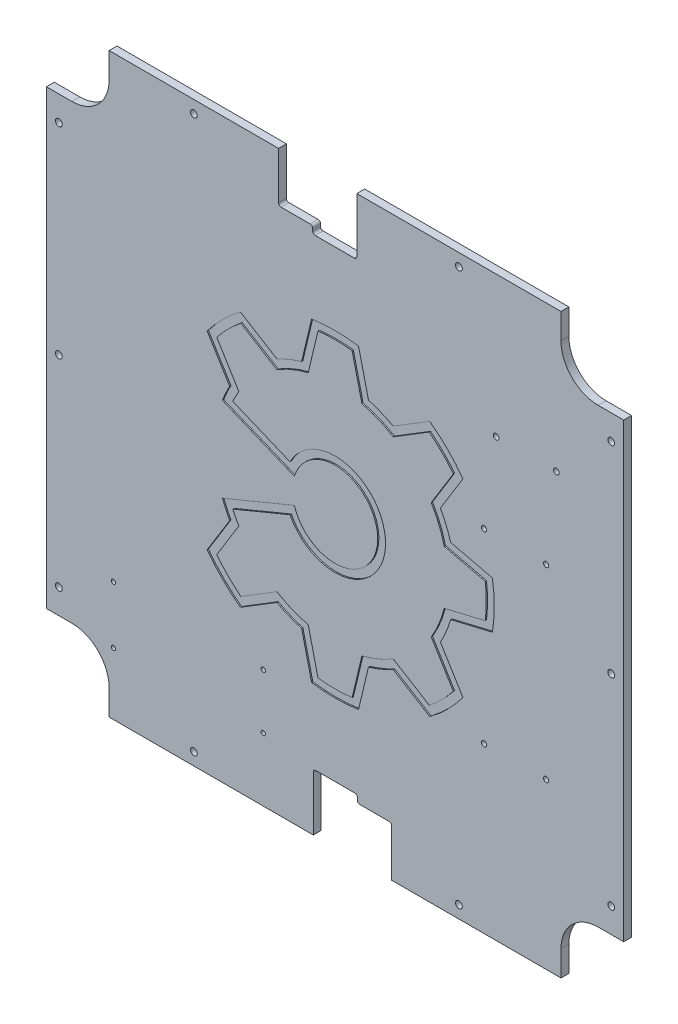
ISO-10303-21;
HEADER;
FILE_DESCRIPTION(('STEP AP214'),'2;1');
FILE_NAME('part.step','',(''),(''),'','','');
FILE_SCHEMA(('AUTOMOTIVE_DESIGN { 1 0 10303 214 1 1 1 1 }'));
ENDSEC;
DATA;
#1=APPLICATION_CONTEXT('core data for automotive mechanical design processes');
#2=APPLICATION_PROTOCOL_DEFINITION('international standard','automotive_design',2000,#1);
#3=PRODUCT_CONTEXT('',#1,'mechanical');
#4=PRODUCT('Part','Part','',(#3));
#5=PRODUCT_RELATED_PRODUCT_CATEGORY('part','',(#4));
#6=PRODUCT_DEFINITION_FORMATION('','',#4);
#7=PRODUCT_DEFINITION_CONTEXT('part definition',#1,'design');
#8=PRODUCT_DEFINITION('design','',#6,#7);
#9=PRODUCT_DEFINITION_SHAPE('','',#8);
#10=(LENGTH_UNIT() NAMED_UNIT(*) SI_UNIT(.MILLI.,.METRE.));
#11=(NAMED_UNIT(*) PLANE_ANGLE_UNIT() SI_UNIT($,.RADIAN.));
#12=(NAMED_UNIT(*) SI_UNIT($,.STERADIAN.) SOLID_ANGLE_UNIT());
#13=UNCERTAINTY_MEASURE_WITH_UNIT(LENGTH_MEASURE(1.E-05),#10,'distance_accuracy_value','');
#14=(GEOMETRIC_REPRESENTATION_CONTEXT(3) GLOBAL_UNCERTAINTY_ASSIGNED_CONTEXT((#13)) GLOBAL_UNIT_ASSIGNED_CONTEXT((#10,
#11,#12)) REPRESENTATION_CONTEXT('',''));
#15=CARTESIAN_POINT('',(0.,0.,0.));
#16=DIRECTION('',(0.,0.,1.));
#17=DIRECTION('',(1.,0.,0.));
#18=AXIS2_PLACEMENT_3D('',#15,#16,#17);
#19=CARTESIAN_POINT('',(0.,0.,6.34999999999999));
#20=DIRECTION('',(0.,0.,1.));
#21=DIRECTION('',(1.,0.,0.));
#22=AXIS2_PLACEMENT_3D('',#19,#20,#21);
#23=PLANE('',#22);
#24=CARTESIAN_POINT('',(-178.500000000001,-136.299993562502,6.34999999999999));
#25=DIRECTION('',(0.,0.,-1.));
#26=DIRECTION('',(-1.,0.,0.));
#27=AXIS2_PLACEMENT_3D('',#24,#25,#26);
#28=CIRCLE('',#27,1.75000000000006);
#29=CARTESIAN_POINT('',(-180.250000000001,-136.299993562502,6.34999999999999));
#30=VERTEX_POINT('',#29);
#31=EDGE_CURVE('E2350',#30,#30,#28,.T.);
#32=ORIENTED_EDGE('',*,*,#31,.T.);
#33=EDGE_LOOP('',(#32));
#34=FACE_BOUND('',#33,.T.);
#35=CARTESIAN_POINT('',(-57.8300000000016,-181.499993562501,6.34999999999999));
#36=DIRECTION('',(0.,0.,-1.));
#37=DIRECTION('',(-1.,0.,0.));
#38=AXIS2_PLACEMENT_3D('',#35,#36,#37);
#39=CIRCLE('',#38,1.75000000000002);
#40=CARTESIAN_POINT('',(-59.5800000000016,-181.499993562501,6.34999999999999));
#41=VERTEX_POINT('',#40);
#42=EDGE_CURVE('E2375',#41,#41,#39,.T.);
#43=ORIENTED_EDGE('',*,*,#42,.T.);
#44=EDGE_LOOP('',(#43));
#45=FACE_BOUND('',#44,.T.);
#46=CARTESIAN_POINT('',(-57.8300000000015,-137.299993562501,6.34999999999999));
#47=DIRECTION('',(0.,0.,-1.));
#48=DIRECTION('',(-1.,0.,0.));
#49=AXIS2_PLACEMENT_3D('',#46,#47,#48);
#50=CIRCLE('',#49,1.75000000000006);
#51=CARTESIAN_POINT('',(-59.5800000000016,-137.299993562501,6.34999999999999));
#52=VERTEX_POINT('',#51);
#53=EDGE_CURVE('E2369',#52,#52,#50,.T.);
#54=ORIENTED_EDGE('',*,*,#53,.T.);
#55=EDGE_LOOP('',(#54));
#56=FACE_BOUND('',#55,.T.);
#57=CARTESIAN_POINT('',(-178.500000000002,-182.499993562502,6.34999999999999));
#58=DIRECTION('',(0.,0.,-1.));
#59=DIRECTION('',(-1.,0.,0.));
#60=AXIS2_PLACEMENT_3D('',#57,#58,#59);
#61=CIRCLE('',#60,1.75000000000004);
#62=CARTESIAN_POINT('',(-180.250000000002,-182.499993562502,6.34999999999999));
#63=VERTEX_POINT('',#62);
#64=EDGE_CURVE('E2363',#63,#63,#61,.T.);
#65=ORIENTED_EDGE('',*,*,#64,.T.);
#66=EDGE_LOOP('',(#65));
#67=FACE_BOUND('',#66,.T.);
#68=CARTESIAN_POINT('',(169.999999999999,-100.000000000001,6.34999999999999));
#69=DIRECTION('',(0.,0.,-1.));
#70=DIRECTION('',(-1.,0.,0.));
#71=AXIS2_PLACEMENT_3D('',#68,#69,#70);
#72=CIRCLE('',#71,2.10000000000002);
#73=CARTESIAN_POINT('',(167.899999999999,-100.000000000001,6.34999999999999));
#74=VERTEX_POINT('',#73);
#75=EDGE_CURVE('E2383',#74,#74,#72,.T.);
#76=ORIENTED_EDGE('',*,*,#75,.T.);
#77=EDGE_LOOP('',(#76));
#78=FACE_BOUND('',#77,.T.);
#79=CARTESIAN_POINT('',(119.999999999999,50.0000000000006,6.35000000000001));
#80=DIRECTION('',(0.,0.,-1.));
#81=DIRECTION('',(-1.,0.,0.));
#82=AXIS2_PLACEMENT_3D('',#79,#80,#81);
#83=CIRCLE('',#82,2.09999999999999);
#84=CARTESIAN_POINT('',(117.899999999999,50.0000000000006,6.35000000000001));
#85=VERTEX_POINT('',#84);
#86=EDGE_CURVE('E2376',#85,#85,#83,.T.);
#87=ORIENTED_EDGE('',*,*,#86,.T.);
#88=EDGE_LOOP('',(#87));
#89=FACE_BOUND('',#88,.T.);
#90=CARTESIAN_POINT('',(169.999999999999,50.0000000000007,6.35000000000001));
#91=DIRECTION('',(0.,0.,-1.));
#92=DIRECTION('',(-1.,0.,0.));
#93=AXIS2_PLACEMENT_3D('',#90,#91,#92);
#94=CIRCLE('',#93,2.10000000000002);
#95=CARTESIAN_POINT('',(167.899999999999,50.0000000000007,6.35000000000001));
#96=VERTEX_POINT('',#95);
#97=EDGE_CURVE('E2392',#96,#96,#94,.T.);
#98=ORIENTED_EDGE('',*,*,#97,.T.);
#99=EDGE_LOOP('',(#98));
#100=FACE_BOUND('',#99,.T.);
#101=CARTESIAN_POINT('',(178.249999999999,119.000000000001,6.35000000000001));
#102=DIRECTION('',(0.,0.,-1.));
#103=DIRECTION('',(-1.,0.,0.));
#104=AXIS2_PLACEMENT_3D('',#101,#102,#103);
#105=CIRCLE('',#104,2.25000000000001);
#106=CARTESIAN_POINT('',(175.999999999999,119.000000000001,6.35000000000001));
#107=VERTEX_POINT('',#106);
#108=EDGE_CURVE('E2354',#107,#107,#105,.T.);
#109=ORIENTED_EDGE('',*,*,#108,.T.);
#110=EDGE_LOOP('',(#109));
#111=FACE_BOUND('',#110,.T.);
#112=CARTESIAN_POINT('',(119.999999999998,-100.000000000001,6.34999999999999));
#113=DIRECTION('',(0.,0.,-1.));
#114=DIRECTION('',(-1.,0.,0.));
#115=AXIS2_PLACEMENT_3D('',#112,#113,#114);
#116=CIRCLE('',#115,2.09999999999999);
#117=CARTESIAN_POINT('',(117.899999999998,-100.000000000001,6.34999999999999));
#118=VERTEX_POINT('',#117);
#119=EDGE_CURVE('E2388',#118,#118,#116,.T.);
#120=ORIENTED_EDGE('',*,*,#119,.T.);
#121=EDGE_LOOP('',(#120));
#122=FACE_BOUND('',#121,.T.);
#123=CARTESIAN_POINT('',(129.749999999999,119.000000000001,6.35000000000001));
#124=DIRECTION('',(0.,0.,-1.));
#125=DIRECTION('',(-1.,0.,0.));
#126=AXIS2_PLACEMENT_3D('',#123,#124,#125);
#127=CIRCLE('',#126,2.25000000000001);
#128=CARTESIAN_POINT('',(127.499999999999,119.000000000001,6.35000000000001));
#129=VERTEX_POINT('',#128);
#130=EDGE_CURVE('E789',#129,#129,#127,.T.);
#131=ORIENTED_EDGE('',*,*,#130,.T.);
#132=EDGE_LOOP('',(#131));
#133=FACE_BOUND('',#132,.T.);
#134=CARTESIAN_POINT('',(0.,0.,6.34999999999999));
#135=DIRECTION('',(0.,0.,-1.));
#136=DIRECTION('',(1.,0.,0.));
#137=AXIS2_PLACEMENT_3D('',#134,#135,#136);
#138=CIRCLE('',#137,34.325);
#139=CARTESIAN_POINT('',(-32.7912301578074,10.1459770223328,6.34999999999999));
#140=VERTEX_POINT('',#139);
#141=CARTESIAN_POINT('',(-32.7912301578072,-10.1459770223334,6.34999999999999));
#142=VERTEX_POINT('',#141);
#143=EDGE_CURVE('E878',#140,#142,#138,.T.);
#144=ORIENTED_EDGE('',*,*,#143,.F.);
#145=DIRECTION('',(0.92387953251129,-0.382683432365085,0.));
#146=VECTOR('',#145,1.);
#147=CARTESIAN_POINT('',(-90.7139869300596,34.1383684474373,6.34999999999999));
#148=LINE('',#147,#146);
#149=CARTESIAN_POINT('',(-90.7139869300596,34.1383684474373,6.34999999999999));
#150=VERTEX_POINT('',#149);
#151=EDGE_CURVE('E942',#150,#140,#148,.T.);
#152=ORIENTED_EDGE('',*,*,#151,.F.);
#153=CARTESIAN_POINT('',(0.,0.,6.34999999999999));
#154=DIRECTION('',(0.,0.,1.));
#155=DIRECTION('',(1.,0.,0.));
#156=AXIS2_PLACEMENT_3D('',#153,#154,#155);
#157=CIRCLE('',#156,96.925);
#158=CARTESIAN_POINT('',(-84.8748006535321,46.8051689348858,6.34999999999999));
#159=VERTEX_POINT('',#158);
#160=EDGE_CURVE('E1124',#159,#150,#157,.T.);
#161=ORIENTED_EDGE('',*,*,#160,.F.);
#162=DIRECTION('',(0.524047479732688,-0.851689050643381,0.));
#163=VECTOR('',#162,1.);
#164=CARTESIAN_POINT('',(-103.008511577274,76.276321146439,6.34999999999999));
#165=LINE('',#164,#163);
#166=CARTESIAN_POINT('',(-103.008511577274,76.276321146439,6.34999999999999));
#167=VERTEX_POINT('',#166);
#168=EDGE_CURVE('E1121',#167,#159,#165,.T.);
#169=ORIENTED_EDGE('',*,*,#168,.F.);
#170=CARTESIAN_POINT('',(0.,0.,6.34999999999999));
#171=DIRECTION('',(0.,0.,1.));
#172=DIRECTION('',(1.,0.,0.));
#173=AXIS2_PLACEMENT_3D('',#170,#171,#172);
#174=CIRCLE('',#173,128.175);
#175=CARTESIAN_POINT('',(-76.2763211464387,103.008511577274,6.35000000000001));
#176=VERTEX_POINT('',#175);
#177=EDGE_CURVE('E1118',#176,#167,#174,.T.);
#178=ORIENTED_EDGE('',*,*,#177,.F.);
#179=DIRECTION('',(-0.851689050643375,0.524047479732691,0.));
#180=VECTOR('',#179,1.);
#181=CARTESIAN_POINT('',(-76.2763211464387,103.008511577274,6.35000000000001));
#182=LINE('',#181,#180);
#183=CARTESIAN_POINT('',(-46.8051689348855,84.8748006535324,6.35000000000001));
#184=VERTEX_POINT('',#183);
#185=EDGE_CURVE('E1115',#184,#176,#182,.T.);
#186=ORIENTED_EDGE('',*,*,#185,.F.);
#187=CARTESIAN_POINT('',(0.,0.,6.34999999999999));
#188=DIRECTION('',(0.,0.,1.));
#189=DIRECTION('',(1.,0.,0.));
#190=AXIS2_PLACEMENT_3D('',#187,#188,#189);
#191=CIRCLE('',#190,96.925);
#192=CARTESIAN_POINT('',(-26.9192947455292,93.111799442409,6.35000000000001));
#193=VERTEX_POINT('',#192);
#194=EDGE_CURVE('E1112',#193,#184,#191,.T.);
#195=ORIENTED_EDGE('',*,*,#194,.F.);
#196=DIRECTION('',(-0.231677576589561,-0.972792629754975,0.));
#197=VECTOR('',#196,1.);
#198=CARTESIAN_POINT('',(-18.9025131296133,126.773520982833,6.35000000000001));
#199=LINE('',#198,#197);
#200=CARTESIAN_POINT('',(-18.9025131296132,126.773520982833,6.35000000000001));
#201=VERTEX_POINT('',#200);
#202=EDGE_CURVE('E1109',#201,#193,#199,.T.);
#203=ORIENTED_EDGE('',*,*,#202,.F.);
#204=CARTESIAN_POINT('',(0.,0.,6.34999999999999));
#205=DIRECTION('',(0.,0.,1.));
#206=DIRECTION('',(1.,0.,0.));
#207=AXIS2_PLACEMENT_3D('',#204,#205,#206);
#208=CIRCLE('',#207,128.175);
#209=CARTESIAN_POINT('',(18.9025131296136,126.773520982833,6.35000000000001));
#210=VERTEX_POINT('',#209);
#211=EDGE_CURVE('E1106',#210,#201,#208,.T.);
#212=ORIENTED_EDGE('',*,*,#211,.F.);
#213=DIRECTION('',(-0.231677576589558,0.972792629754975,0.));
#214=VECTOR('',#213,1.);
#215=CARTESIAN_POINT('',(18.9025131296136,126.773520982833,6.35000000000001));
#216=LINE('',#215,#214);
#217=CARTESIAN_POINT('',(26.9192947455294,93.111799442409,6.35000000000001));
#218=VERTEX_POINT('',#217);
#219=EDGE_CURVE('E1103',#218,#210,#216,.T.);
#220=ORIENTED_EDGE('',*,*,#219,.F.);
#221=CARTESIAN_POINT('',(0.,0.,6.34999999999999));
#222=DIRECTION('',(0.,0.,1.));
#223=DIRECTION('',(1.,0.,0.));
#224=AXIS2_PLACEMENT_3D('',#221,#222,#223);
#225=CIRCLE('',#224,96.925);
#226=CARTESIAN_POINT('',(46.8051689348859,84.8748006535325,6.35000000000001));
#227=VERTEX_POINT('',#226);
#228=EDGE_CURVE('E1100',#227,#218,#225,.T.);
#229=ORIENTED_EDGE('',*,*,#228,.F.);
#230=DIRECTION('',(-0.851689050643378,-0.524047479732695,0.));
#231=VECTOR('',#230,1.);
#232=CARTESIAN_POINT('',(76.2763211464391,103.008511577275,6.35000000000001));
#233=LINE('',#232,#231);
#234=CARTESIAN_POINT('',(76.2763211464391,103.008511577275,6.35000000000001));
#235=VERTEX_POINT('',#234);
#236=EDGE_CURVE('E1097',#235,#227,#233,.T.);
#237=ORIENTED_EDGE('',*,*,#236,.F.);
#238=CARTESIAN_POINT('',(0.,0.,6.34999999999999));
#239=DIRECTION('',(0.,0.,1.));
#240=DIRECTION('',(1.,0.,0.));
#241=AXIS2_PLACEMENT_3D('',#238,#239,#240);
#242=CIRCLE('',#241,128.175);
#243=CARTESIAN_POINT('',(103.008511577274,76.2763211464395,6.35000000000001));
#244=VERTEX_POINT('',#243);
#245=EDGE_CURVE('E1094',#244,#235,#242,.T.);
#246=ORIENTED_EDGE('',*,*,#245,.F.);
#247=DIRECTION('',(0.524047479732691,0.851689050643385,0.));
#248=VECTOR('',#247,1.);
#249=CARTESIAN_POINT('',(103.008511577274,76.2763211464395,6.35000000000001));
#250=LINE('',#249,#248);
#251=CARTESIAN_POINT('',(84.8748006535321,46.805168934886,6.35000000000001));
#252=VERTEX_POINT('',#251);
#253=EDGE_CURVE('E1091',#252,#244,#250,.T.);
#254=ORIENTED_EDGE('',*,*,#253,.F.);
#255=CARTESIAN_POINT('',(0.,0.,6.34999999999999));
#256=DIRECTION('',(0.,0.,1.));
#257=DIRECTION('',(1.,0.,0.));
#258=AXIS2_PLACEMENT_3D('',#255,#256,#257);
#259=CIRCLE('',#258,96.925);
#260=CARTESIAN_POINT('',(93.1117994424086,26.9192947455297,6.35000000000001));
#261=VERTEX_POINT('',#260);
#262=EDGE_CURVE('E1088',#261,#252,#259,.T.);
#263=ORIENTED_EDGE('',*,*,#262,.F.);
#264=DIRECTION('',(-0.972792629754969,0.23167757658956,0.));
#265=VECTOR('',#264,1.);
#266=CARTESIAN_POINT('',(126.773520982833,18.9025131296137,6.35000000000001));
#267=LINE('',#266,#265);
#268=CARTESIAN_POINT('',(126.773520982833,18.9025131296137,6.35000000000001));
#269=VERTEX_POINT('',#268);
#270=EDGE_CURVE('E1085',#269,#261,#267,.T.);
#271=ORIENTED_EDGE('',*,*,#270,.F.);
#272=CARTESIAN_POINT('',(0.,0.,6.34999999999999));
#273=DIRECTION('',(0.,0.,1.));
#274=DIRECTION('',(1.,0.,0.));
#275=AXIS2_PLACEMENT_3D('',#272,#273,#274);
#276=CIRCLE('',#275,128.175);
#277=CARTESIAN_POINT('',(126.773520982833,-18.9025131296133,6.34999999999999));
#278=VERTEX_POINT('',#277);
#279=EDGE_CURVE('E1082',#278,#269,#276,.T.);
#280=ORIENTED_EDGE('',*,*,#279,.F.);
#281=DIRECTION('',(0.972792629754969,0.231677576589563,0.));
#282=VECTOR('',#281,1.);
#283=CARTESIAN_POINT('',(126.773520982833,-18.9025131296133,6.34999999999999));
#284=LINE('',#283,#282);
#285=CARTESIAN_POINT('',(93.1117994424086,-26.9192947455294,6.34999999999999));
#286=VERTEX_POINT('',#285);
#287=EDGE_CURVE('E1079',#286,#278,#284,.T.);
#288=ORIENTED_EDGE('',*,*,#287,.F.);
#289=CARTESIAN_POINT('',(0.,0.,6.34999999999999));
#290=DIRECTION('',(0.,0.,1.));
#291=DIRECTION('',(1.,0.,0.));
#292=AXIS2_PLACEMENT_3D('',#289,#290,#291);
#293=CIRCLE('',#292,96.925);
#294=CARTESIAN_POINT('',(84.8748006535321,-46.8051689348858,6.34999999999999));
#295=VERTEX_POINT('',#294);
#296=EDGE_CURVE('E1076',#295,#286,#293,.T.);
#297=ORIENTED_EDGE('',*,*,#296,.F.);
#298=DIRECTION('',(-0.524047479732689,0.851689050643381,0.));
#299=VECTOR('',#298,1.);
#300=CARTESIAN_POINT('',(103.008511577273,-76.2763211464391,6.34999999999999));
#301=LINE('',#300,#299);
#302=CARTESIAN_POINT('',(103.008511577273,-76.2763211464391,6.34999999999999));
#303=VERTEX_POINT('',#302);
#304=EDGE_CURVE('E1073',#303,#295,#301,.T.);
#305=ORIENTED_EDGE('',*,*,#304,.F.);
#306=CARTESIAN_POINT('',(0.,0.,6.34999999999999));
#307=DIRECTION('',(0.,0.,1.));
#308=DIRECTION('',(1.,0.,0.));
#309=AXIS2_PLACEMENT_3D('',#306,#307,#308);
#310=CIRCLE('',#309,128.175);
#311=CARTESIAN_POINT('',(76.2763211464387,-103.008511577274,6.34999999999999));
#312=VERTEX_POINT('',#311);
#313=EDGE_CURVE('E1070',#312,#303,#310,.T.);
#314=ORIENTED_EDGE('',*,*,#313,.F.);
#315=DIRECTION('',(0.851689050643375,-0.524047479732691,0.));
#316=VECTOR('',#315,1.);
#317=CARTESIAN_POINT('',(76.2763211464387,-103.008511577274,6.34999999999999));
#318=LINE('',#317,#316);
#319=CARTESIAN_POINT('',(46.8051689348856,-84.8748006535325,6.34999999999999));
#320=VERTEX_POINT('',#319);
#321=EDGE_CURVE('E1067',#320,#312,#318,.T.);
#322=ORIENTED_EDGE('',*,*,#321,.F.);
#323=CARTESIAN_POINT('',(0.,0.,6.34999999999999));
#324=DIRECTION('',(0.,0.,1.));
#325=DIRECTION('',(1.,0.,0.));
#326=AXIS2_PLACEMENT_3D('',#323,#324,#325);
#327=CIRCLE('',#326,96.925);
#328=CARTESIAN_POINT('',(26.9192947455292,-93.111799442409,6.34999999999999));
#329=VERTEX_POINT('',#328);
#330=EDGE_CURVE('E1064',#329,#320,#327,.T.);
#331=ORIENTED_EDGE('',*,*,#330,.F.);
#332=DIRECTION('',(0.231677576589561,0.972792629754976,0.));
#333=VECTOR('',#332,1.);
#334=CARTESIAN_POINT('',(18.9025131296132,-126.773520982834,6.34999999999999));
#335=LINE('',#334,#333);
#336=CARTESIAN_POINT('',(18.9025131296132,-126.773520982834,6.34999999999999));
#337=VERTEX_POINT('',#336);
#338=EDGE_CURVE('E1061',#337,#329,#335,.T.);
#339=ORIENTED_EDGE('',*,*,#338,.F.);
#340=CARTESIAN_POINT('',(0.,0.,6.34999999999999));
#341=DIRECTION('',(0.,0.,1.));
#342=DIRECTION('',(1.,0.,0.));
#343=AXIS2_PLACEMENT_3D('',#340,#341,#342);
#344=CIRCLE('',#343,128.175);
#345=CARTESIAN_POINT('',(-18.9025131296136,-126.773520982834,6.34999999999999));
#346=VERTEX_POINT('',#345);
#347=EDGE_CURVE('E1058',#346,#337,#344,.T.);
#348=ORIENTED_EDGE('',*,*,#347,.F.);
#349=DIRECTION('',(0.231677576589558,-0.972792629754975,0.));
#350=VECTOR('',#349,1.);
#351=CARTESIAN_POINT('',(-18.9025131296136,-126.773520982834,6.34999999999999));
#352=LINE('',#351,#350);
#353=CARTESIAN_POINT('',(-26.9192947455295,-93.111799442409,6.34999999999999));
#354=VERTEX_POINT('',#353);
#355=EDGE_CURVE('E1055',#354,#346,#352,.T.);
#356=ORIENTED_EDGE('',*,*,#355,.F.);
#357=CARTESIAN_POINT('',(0.,0.,6.34999999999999));
#358=DIRECTION('',(0.,0.,1.));
#359=DIRECTION('',(1.,0.,0.));
#360=AXIS2_PLACEMENT_3D('',#357,#358,#359);
#361=CIRCLE('',#360,96.925);
#362=CARTESIAN_POINT('',(-46.8051689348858,-84.8748006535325,6.34999999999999));
#363=VERTEX_POINT('',#362);
#364=EDGE_CURVE('E1052',#363,#354,#361,.T.);
#365=ORIENTED_EDGE('',*,*,#364,.F.);
#366=DIRECTION('',(0.851689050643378,0.524047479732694,0.));
#367=VECTOR('',#366,1.);
#368=CARTESIAN_POINT('',(-76.2763211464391,-103.008511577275,6.34999999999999));
#369=LINE('',#368,#367);
#370=CARTESIAN_POINT('',(-76.2763211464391,-103.008511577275,6.34999999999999));
#371=VERTEX_POINT('',#370);
#372=EDGE_CURVE('E1049',#371,#363,#369,.T.);
#373=ORIENTED_EDGE('',*,*,#372,.F.);
#374=CARTESIAN_POINT('',(0.,0.,6.34999999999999));
#375=DIRECTION('',(0.,0.,1.));
#376=DIRECTION('',(1.,0.,0.));
#377=AXIS2_PLACEMENT_3D('',#374,#375,#376);
#378=CIRCLE('',#377,128.175);
#379=CARTESIAN_POINT('',(-103.008511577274,-76.2763211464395,6.34999999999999));
#380=VERTEX_POINT('',#379);
#381=EDGE_CURVE('E1046',#380,#371,#378,.T.);
#382=ORIENTED_EDGE('',*,*,#381,.F.);
#383=DIRECTION('',(-0.524047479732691,-0.851689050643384,0.));
#384=VECTOR('',#383,1.);
#385=CARTESIAN_POINT('',(-103.008511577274,-76.2763211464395,6.34999999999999));
#386=LINE('',#385,#384);
#387=CARTESIAN_POINT('',(-84.8748006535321,-46.805168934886,6.34999999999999));
#388=VERTEX_POINT('',#387);
#389=EDGE_CURVE('E1043',#388,#380,#386,.T.);
#390=ORIENTED_EDGE('',*,*,#389,.F.);
#391=CARTESIAN_POINT('',(0.,0.,6.34999999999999));
#392=DIRECTION('',(0.,0.,1.));
#393=DIRECTION('',(1.,0.,0.));
#394=AXIS2_PLACEMENT_3D('',#391,#392,#393);
#395=CIRCLE('',#394,96.925);
#396=CARTESIAN_POINT('',(-90.7139869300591,-34.1383684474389,6.34999999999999));
#397=VERTEX_POINT('',#396);
#398=EDGE_CURVE('E1040',#397,#388,#395,.T.);
#399=ORIENTED_EDGE('',*,*,#398,.F.);
#400=DIRECTION('',(-0.923879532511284,-0.382683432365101,0.));
#401=VECTOR('',#400,1.);
#402=CARTESIAN_POINT('',(-90.7139869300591,-34.1383684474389,6.34999999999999));
#403=LINE('',#402,#401);
#404=EDGE_CURVE('E1037',#142,#397,#403,.T.);
#405=ORIENTED_EDGE('',*,*,#404,.F.);
#406=EDGE_LOOP('',(#144,#152,#161,#169,#178,#186,#195,#203,#212,#220,#229,#237,#246,#254,#263,
#271,#280,#288,#297,#305,#314,#322,#331,#339,#348,#356,#365,#373,#382,#390,#399,#405));
#407=FACE_BOUND('',#406,.T.);
#408=DIRECTION('',(0.,1.00000000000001,0.));
#409=VECTOR('',#408,1.);
#410=CARTESIAN_POINT('',(-17.9999999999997,186.5,6.35000000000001));
#411=LINE('',#410,#409);
#412=CARTESIAN_POINT('',(-17.9999999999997,188.500000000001,6.35000000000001));
#413=VERTEX_POINT('',#412);
#414=CARTESIAN_POINT('',(-17.9999999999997,190.500000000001,6.35000000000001));
#415=VERTEX_POINT('',#414);
#416=EDGE_CURVE('E1208',#413,#415,#411,.T.);
#417=ORIENTED_EDGE('',*,*,#416,.T.);
#418=CARTESIAN_POINT('',(-19.9999999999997,190.500000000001,6.35000000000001));
#419=DIRECTION('',(0.,0.,1.));
#420=DIRECTION('',(1.,0.,0.));
#421=AXIS2_PLACEMENT_3D('',#418,#419,#420);
#422=CIRCLE('',#421,2.);
#423=CARTESIAN_POINT('',(-19.9999999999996,192.500000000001,6.35000000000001));
#424=VERTEX_POINT('',#423);
#425=EDGE_CURVE('E1459',#415,#424,#422,.T.);
#426=ORIENTED_EDGE('',*,*,#425,.T.);
#427=DIRECTION('',(-1.,0.,0.));
#428=VECTOR('',#427,1.);
#429=CARTESIAN_POINT('',(-45.4999999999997,192.500000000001,6.35000000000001));
#430=LINE('',#429,#428);
#431=CARTESIAN_POINT('',(-43.4999999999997,192.500000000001,6.35000000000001));
#432=VERTEX_POINT('',#431);
#433=EDGE_CURVE('E1214',#424,#432,#430,.T.);
#434=ORIENTED_EDGE('',*,*,#433,.T.);
#435=CARTESIAN_POINT('',(-43.4999999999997,194.500000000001,6.35000000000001));
#436=DIRECTION('',(0.,0.,1.));
#437=DIRECTION('',(1.,0.,0.));
#438=AXIS2_PLACEMENT_3D('',#435,#436,#437);
#439=CIRCLE('',#438,2.);
#440=CARTESIAN_POINT('',(-45.4999999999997,194.500000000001,6.35000000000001));
#441=VERTEX_POINT('',#440);
#442=EDGE_CURVE('E1500',#432,#441,#439,.F.);
#443=ORIENTED_EDGE('',*,*,#442,.T.);
#444=DIRECTION('',(0.,1.00000000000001,0.));
#445=VECTOR('',#444,1.);
#446=CARTESIAN_POINT('',(-45.4999999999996,232.500000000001,6.35000000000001));
#447=LINE('',#446,#445);
#448=CARTESIAN_POINT('',(-45.4999999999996,232.500000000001,6.35000000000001));
#449=VERTEX_POINT('',#448);
#450=EDGE_CURVE('E1333',#441,#449,#447,.T.);
#451=ORIENTED_EDGE('',*,*,#450,.T.);
#452=DIRECTION('',(-1.,0.,0.));
#453=VECTOR('',#452,1.);
#454=CARTESIAN_POINT('',(-45.4999999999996,232.500000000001,6.35000000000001));
#455=LINE('',#454,#453);
#456=CARTESIAN_POINT('',(-181.999999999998,232.500000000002,6.35000000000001));
#457=VERTEX_POINT('',#456);
#458=EDGE_CURVE('E1335',#449,#457,#455,.T.);
#459=ORIENTED_EDGE('',*,*,#458,.T.);
#460=DIRECTION('',(0.,-1.00000000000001,0.));
#461=VECTOR('',#460,1.);
#462=CARTESIAN_POINT('',(-181.999999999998,232.500000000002,6.35000000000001));
#463=LINE('',#462,#461);
#464=CARTESIAN_POINT('',(-181.999999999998,212.000000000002,6.35000000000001));
#465=VERTEX_POINT('',#464);
#466=EDGE_CURVE('E1337',#457,#465,#463,.T.);
#467=ORIENTED_EDGE('',*,*,#466,.T.);
#468=CARTESIAN_POINT('',(-211.999999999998,212.000000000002,6.35000000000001));
#469=DIRECTION('',(0.,0.,1.));
#470=DIRECTION('',(1.,0.,0.));
#471=AXIS2_PLACEMENT_3D('',#468,#469,#470);
#472=CIRCLE('',#471,30.);
#473=CARTESIAN_POINT('',(-211.999999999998,182.000000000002,6.35000000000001));
#474=VERTEX_POINT('',#473);
#475=EDGE_CURVE('E1131',#474,#465,#472,.T.);
#476=ORIENTED_EDGE('',*,*,#475,.F.);
#477=DIRECTION('',(-1.,0.,0.));
#478=VECTOR('',#477,1.);
#479=CARTESIAN_POINT('',(-232.499999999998,182.000000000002,6.35000000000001));
#480=LINE('',#479,#478);
#481=CARTESIAN_POINT('',(-232.499999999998,182.000000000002,6.35000000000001));
#482=VERTEX_POINT('',#481);
#483=EDGE_CURVE('E1340',#474,#482,#480,.T.);
#484=ORIENTED_EDGE('',*,*,#483,.T.);
#485=DIRECTION('',(0.,-1.00000000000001,0.));
#486=VECTOR('',#485,1.);
#487=CARTESIAN_POINT('',(-232.499999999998,182.000000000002,6.35000000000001));
#488=LINE('',#487,#486);
#489=CARTESIAN_POINT('',(-232.5,-182.000000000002,6.34999999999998));
#490=VERTEX_POINT('',#489);
#491=EDGE_CURVE('E1293',#482,#490,#488,.T.);
#492=ORIENTED_EDGE('',*,*,#491,.T.);
#493=DIRECTION('',(1.,0.,0.));
#494=VECTOR('',#493,1.);
#495=CARTESIAN_POINT('',(-232.5,-182.000000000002,6.34999999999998));
#496=LINE('',#495,#494);
#497=CARTESIAN_POINT('',(-212.,-182.000000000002,6.34999999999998));
#498=VERTEX_POINT('',#497);
#499=EDGE_CURVE('E1295',#490,#498,#496,.T.);
#500=ORIENTED_EDGE('',*,*,#499,.T.);
#501=CARTESIAN_POINT('',(-212.,-212.000000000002,6.34999999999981));
#502=DIRECTION('',(0.,0.,1.));
#503=DIRECTION('',(1.,0.,0.));
#504=AXIS2_PLACEMENT_3D('',#501,#502,#503);
#505=CIRCLE('',#504,30.);
#506=CARTESIAN_POINT('',(-182.,-212.000000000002,6.34999999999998));
#507=VERTEX_POINT('',#506);
#508=EDGE_CURVE('E1196',#507,#498,#505,.T.);
#509=ORIENTED_EDGE('',*,*,#508,.F.);
#510=DIRECTION('',(0.,-1.00000000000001,0.));
#511=VECTOR('',#510,1.);
#512=CARTESIAN_POINT('',(-182.,-232.500000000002,6.34999999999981));
#513=LINE('',#512,#511);
#514=CARTESIAN_POINT('',(-182.,-232.500000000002,6.34999999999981));
#515=VERTEX_POINT('',#514);
#516=EDGE_CURVE('E1299',#507,#515,#513,.T.);
#517=ORIENTED_EDGE('',*,*,#516,.T.);
#518=DIRECTION('',(1.,0.,0.));
#519=VECTOR('',#518,1.);
#520=CARTESIAN_POINT('',(-182.,-232.500000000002,6.34999999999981));
#521=LINE('',#520,#519);
#522=CARTESIAN_POINT('',(-17.5000000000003,-232.500000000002,6.34999999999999));
#523=VERTEX_POINT('',#522);
#524=EDGE_CURVE('E1301',#515,#523,#521,.T.);
#525=ORIENTED_EDGE('',*,*,#524,.T.);
#526=DIRECTION('',(0.,1.00000000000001,0.));
#527=VECTOR('',#526,1.);
#528=CARTESIAN_POINT('',(-17.5000000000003,-232.500000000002,6.34999999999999));
#529=LINE('',#528,#527);
#530=CARTESIAN_POINT('',(-17.5000000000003,-188.500000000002,6.34999999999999));
#531=VERTEX_POINT('',#530);
#532=EDGE_CURVE('E1303',#523,#531,#529,.T.);
#533=ORIENTED_EDGE('',*,*,#532,.T.);
#534=CARTESIAN_POINT('',(-15.5000000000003,-188.500000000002,6.34999999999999));
#535=DIRECTION('',(0.,0.,1.));
#536=DIRECTION('',(1.,0.,0.));
#537=AXIS2_PLACEMENT_3D('',#534,#535,#536);
#538=CIRCLE('',#537,2.);
#539=CARTESIAN_POINT('',(-15.5000000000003,-186.500000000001,6.34999999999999));
#540=VERTEX_POINT('',#539);
#541=EDGE_CURVE('E13',#531,#540,#538,.F.);
#542=ORIENTED_EDGE('',*,*,#541,.T.);
#543=DIRECTION('',(1.,0.,0.));
#544=VECTOR('',#543,1.);
#545=CARTESIAN_POINT('',(45.4999999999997,-186.500000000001,6.34999999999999));
#546=LINE('',#545,#544);
#547=CARTESIAN_POINT('',(15.9999999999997,-186.500000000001,6.34999999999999));
#548=VERTEX_POINT('',#547);
#549=EDGE_CURVE('E1306',#540,#548,#546,.T.);
#550=ORIENTED_EDGE('',*,*,#549,.T.);
#551=CARTESIAN_POINT('',(15.9999999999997,-188.500000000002,6.34999999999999));
#552=DIRECTION('',(0.,0.,1.));
#553=DIRECTION('',(1.,0.,0.));
#554=AXIS2_PLACEMENT_3D('',#551,#552,#553);
#555=CIRCLE('',#554,2.);
#556=CARTESIAN_POINT('',(17.9999999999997,-188.500000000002,6.34999999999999));
#557=VERTEX_POINT('',#556);
#558=EDGE_CURVE('E1508',#548,#557,#555,.F.);
#559=ORIENTED_EDGE('',*,*,#558,.T.);
#560=DIRECTION('',(0.,-1.00000000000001,0.));
#561=VECTOR('',#560,1.);
#562=CARTESIAN_POINT('',(17.9999999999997,-186.500000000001,6.34999999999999));
#563=LINE('',#562,#561);
#564=CARTESIAN_POINT('',(17.9999999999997,-190.500000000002,6.34999999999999));
#565=VERTEX_POINT('',#564);
#566=EDGE_CURVE('E1217',#557,#565,#563,.T.);
#567=ORIENTED_EDGE('',*,*,#566,.T.);
#568=CARTESIAN_POINT('',(19.9999999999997,-190.500000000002,6.34999999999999));
#569=DIRECTION('',(0.,0.,1.));
#570=DIRECTION('',(1.,0.,0.));
#571=AXIS2_PLACEMENT_3D('',#568,#569,#570);
#572=CIRCLE('',#571,2.);
#573=CARTESIAN_POINT('',(19.9999999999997,-192.500000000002,6.34999999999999));
#574=VERTEX_POINT('',#573);
#575=EDGE_CURVE('E1457',#565,#574,#572,.T.);
#576=ORIENTED_EDGE('',*,*,#575,.T.);
#577=DIRECTION('',(1.,0.,0.));
#578=VECTOR('',#577,1.);
#579=CARTESIAN_POINT('',(45.4999999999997,-192.500000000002,6.34999999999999));
#580=LINE('',#579,#578);
#581=CARTESIAN_POINT('',(43.4999999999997,-192.500000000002,6.34999999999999));
#582=VERTEX_POINT('',#581);
#583=EDGE_CURVE('E1225',#574,#582,#580,.T.);
#584=ORIENTED_EDGE('',*,*,#583,.T.);
#585=CARTESIAN_POINT('',(43.4999999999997,-194.500000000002,6.34999999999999));
#586=DIRECTION('',(0.,0.,1.));
#587=DIRECTION('',(1.,0.,0.));
#588=AXIS2_PLACEMENT_3D('',#585,#586,#587);
#589=CIRCLE('',#588,2.);
#590=CARTESIAN_POINT('',(45.4999999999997,-194.500000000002,6.34999999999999));
#591=VERTEX_POINT('',#590);
#592=EDGE_CURVE('E1504',#582,#591,#589,.F.);
#593=ORIENTED_EDGE('',*,*,#592,.T.);
#594=DIRECTION('',(0.,-1.00000000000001,0.));
#595=VECTOR('',#594,1.);
#596=CARTESIAN_POINT('',(45.4999999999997,-232.500000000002,6.34999999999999));
#597=LINE('',#596,#595);
#598=CARTESIAN_POINT('',(45.4999999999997,-232.500000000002,6.34999999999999));
#599=VERTEX_POINT('',#598);
#600=EDGE_CURVE('E1309',#591,#599,#597,.T.);
#601=ORIENTED_EDGE('',*,*,#600,.T.);
#602=DIRECTION('',(1.,0.,0.));
#603=VECTOR('',#602,1.);
#604=CARTESIAN_POINT('',(45.4999999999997,-232.500000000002,6.34999999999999));
#605=LINE('',#604,#603);
#606=CARTESIAN_POINT('',(182.,-232.500000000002,6.34999999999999));
#607=VERTEX_POINT('',#606);
#608=EDGE_CURVE('E1311',#599,#607,#605,.T.);
#609=ORIENTED_EDGE('',*,*,#608,.T.);
#610=DIRECTION('',(0.,1.00000000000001,0.));
#611=VECTOR('',#610,1.);
#612=CARTESIAN_POINT('',(182.,-232.500000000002,6.34999999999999));
#613=LINE('',#612,#611);
#614=CARTESIAN_POINT('',(182.,-212.000000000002,6.34999999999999));
#615=VERTEX_POINT('',#614);
#616=EDGE_CURVE('E1313',#607,#615,#613,.T.);
#617=ORIENTED_EDGE('',*,*,#616,.T.);
#618=CARTESIAN_POINT('',(212.,-212.000000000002,6.34999999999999));
#619=DIRECTION('',(0.,0.,1.));
#620=DIRECTION('',(1.,0.,0.));
#621=AXIS2_PLACEMENT_3D('',#618,#619,#620);
#622=CIRCLE('',#621,30.);
#623=CARTESIAN_POINT('',(212.,-182.000000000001,6.34999999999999));
#624=VERTEX_POINT('',#623);
#625=EDGE_CURVE('E1200',#624,#615,#622,.T.);
#626=ORIENTED_EDGE('',*,*,#625,.F.);
#627=DIRECTION('',(1.,0.,0.));
#628=VECTOR('',#627,1.);
#629=CARTESIAN_POINT('',(232.5,-182.000000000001,6.34999999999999));
#630=LINE('',#629,#628);
#631=CARTESIAN_POINT('',(232.5,-182.000000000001,6.34999999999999));
#632=VERTEX_POINT('',#631);
#633=EDGE_CURVE('E1316',#624,#632,#630,.T.);
#634=ORIENTED_EDGE('',*,*,#633,.T.);
#635=DIRECTION('',(0.,1.00000000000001,0.));
#636=VECTOR('',#635,1.);
#637=CARTESIAN_POINT('',(232.5,-182.000000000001,6.34999999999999));
#638=LINE('',#637,#636);
#639=CARTESIAN_POINT('',(232.500000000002,181.999999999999,6.35000000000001));
#640=VERTEX_POINT('',#639);
#641=EDGE_CURVE('E1318',#632,#640,#638,.T.);
#642=ORIENTED_EDGE('',*,*,#641,.T.);
#643=DIRECTION('',(-1.,0.,0.));
#644=VECTOR('',#643,1.);
#645=CARTESIAN_POINT('',(232.500000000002,181.999999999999,6.35000000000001));
#646=LINE('',#645,#644);
#647=CARTESIAN_POINT('',(212.000000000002,181.999999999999,6.35000000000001));
#648=VERTEX_POINT('',#647);
#649=EDGE_CURVE('E1320',#640,#648,#646,.T.);
#650=ORIENTED_EDGE('',*,*,#649,.T.);
#651=CARTESIAN_POINT('',(212.000000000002,212.,6.35000000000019));
#652=DIRECTION('',(0.,0.,1.));
#653=DIRECTION('',(1.,0.,0.));
#654=AXIS2_PLACEMENT_3D('',#651,#652,#653);
#655=CIRCLE('',#654,30.);
#656=CARTESIAN_POINT('',(182.000000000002,212.,6.35000000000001));
#657=VERTEX_POINT('',#656);
#658=EDGE_CURVE('E1204',#657,#648,#655,.T.);
#659=ORIENTED_EDGE('',*,*,#658,.F.);
#660=DIRECTION('',(0.,1.00000000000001,0.));
#661=VECTOR('',#660,1.);
#662=CARTESIAN_POINT('',(182.000000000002,232.5,6.35000000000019));
#663=LINE('',#662,#661);
#664=CARTESIAN_POINT('',(182.000000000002,232.5,6.35000000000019));
#665=VERTEX_POINT('',#664);
#666=EDGE_CURVE('E1323',#657,#665,#663,.T.);
#667=ORIENTED_EDGE('',*,*,#666,.T.);
#668=DIRECTION('',(-1.,0.,0.));
#669=VECTOR('',#668,1.);
#670=CARTESIAN_POINT('',(182.000000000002,232.5,6.35000000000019));
#671=LINE('',#670,#669);
#672=CARTESIAN_POINT('',(17.5000000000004,232.500000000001,6.35000000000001));
#673=VERTEX_POINT('',#672);
#674=EDGE_CURVE('E1325',#665,#673,#671,.T.);
#675=ORIENTED_EDGE('',*,*,#674,.T.);
#676=DIRECTION('',(0.,-1.00000000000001,0.));
#677=VECTOR('',#676,1.);
#678=CARTESIAN_POINT('',(17.5000000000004,232.500000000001,6.35000000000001));
#679=LINE('',#678,#677);
#680=CARTESIAN_POINT('',(17.5000000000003,188.500000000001,6.35000000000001));
#681=VERTEX_POINT('',#680);
#682=EDGE_CURVE('E1327',#673,#681,#679,.T.);
#683=ORIENTED_EDGE('',*,*,#682,.T.);
#684=CARTESIAN_POINT('',(15.5000000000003,188.500000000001,6.35000000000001));
#685=DIRECTION('',(0.,0.,1.));
#686=DIRECTION('',(1.,0.,0.));
#687=AXIS2_PLACEMENT_3D('',#684,#685,#686);
#688=CIRCLE('',#687,2.);
#689=CARTESIAN_POINT('',(15.5000000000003,186.5,6.35000000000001));
#690=VERTEX_POINT('',#689);
#691=EDGE_CURVE('E1494',#681,#690,#688,.F.);
#692=ORIENTED_EDGE('',*,*,#691,.T.);
#693=DIRECTION('',(-1.,0.,0.));
#694=VECTOR('',#693,1.);
#695=CARTESIAN_POINT('',(-45.4999999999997,186.5,6.35000000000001));
#696=LINE('',#695,#694);
#697=CARTESIAN_POINT('',(-15.9999999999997,186.5,6.35000000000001));
#698=VERTEX_POINT('',#697);
#699=EDGE_CURVE('E1330',#690,#698,#696,.T.);
#700=ORIENTED_EDGE('',*,*,#699,.T.);
#701=CARTESIAN_POINT('',(-15.9999999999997,188.500000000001,6.35000000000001));
#702=DIRECTION('',(0.,0.,1.));
#703=DIRECTION('',(1.,0.,0.));
#704=AXIS2_PLACEMENT_3D('',#701,#702,#703);
#705=CIRCLE('',#704,2.);
#706=EDGE_CURVE('E1496',#698,#413,#705,.F.);
#707=ORIENTED_EDGE('',*,*,#706,.T.);
#708=EDGE_LOOP('',(#417,#426,#434,#443,#451,#459,#467,#476,#484,#492,#500,#509,#517,#525,#533,
#542,#550,#559,#567,#576,#584,#593,#601,#609,#617,#626,#634,#642,#650,#659,#667,#675,#683,#692,
#700,#707));
#709=FACE_BOUND('',#708,.T.);
#710=CARTESIAN_POINT('',(99.7499999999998,-222.500000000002,6.34999999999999));
#711=DIRECTION('',(0.,0.,1.));
#712=DIRECTION('',(-1.,0.,0.));
#713=AXIS2_PLACEMENT_3D('',#710,#711,#712);
#714=CIRCLE('',#713,2.75000000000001);
#715=CARTESIAN_POINT('',(96.9999999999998,-222.500000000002,6.34999999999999));
#716=VERTEX_POINT('',#715);
#717=EDGE_CURVE('E1239',#716,#716,#714,.T.);
#718=ORIENTED_EDGE('',*,*,#717,.F.);
#719=EDGE_LOOP('',(#718));
#720=FACE_BOUND('',#719,.T.);
#721=CARTESIAN_POINT('',(-113.749999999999,222.500000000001,6.35000000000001));
#722=DIRECTION('',(0.,0.,1.));
#723=DIRECTION('',(1.,0.,0.));
#724=AXIS2_PLACEMENT_3D('',#721,#722,#723);
#725=CIRCLE('',#724,2.75000000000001);
#726=CARTESIAN_POINT('',(-110.999999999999,222.500000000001,6.35000000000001));
#727=VERTEX_POINT('',#726);
#728=EDGE_CURVE('E1251',#727,#727,#725,.T.);
#729=ORIENTED_EDGE('',*,*,#728,.F.);
#730=EDGE_LOOP('',(#729));
#731=FACE_BOUND('',#730,.T.);
#732=CARTESIAN_POINT('',(-222.5,161.999999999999,6.34999999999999));
#733=DIRECTION('',(0.,0.,1.));
#734=DIRECTION('',(-1.,0.,0.));
#735=AXIS2_PLACEMENT_3D('',#732,#733,#734);
#736=CIRCLE('',#735,2.75000000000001);
#737=CARTESIAN_POINT('',(-225.25,161.999999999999,6.34999999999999));
#738=VERTEX_POINT('',#737);
#739=EDGE_CURVE('E1263',#738,#738,#736,.T.);
#740=ORIENTED_EDGE('',*,*,#739,.F.);
#741=EDGE_LOOP('',(#740));
#742=FACE_BOUND('',#741,.T.);
#743=CARTESIAN_POINT('',(-222.5,-3.46023914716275E-13,6.34999999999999));
#744=DIRECTION('',(0.,0.,1.));
#745=DIRECTION('',(1.,0.,0.));
#746=AXIS2_PLACEMENT_3D('',#743,#744,#745);
#747=CIRCLE('',#746,2.75000000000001);
#748=CARTESIAN_POINT('',(-219.75,-3.41749556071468E-13,6.34999999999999));
#749=VERTEX_POINT('',#748);
#750=EDGE_CURVE('E1275',#749,#749,#747,.T.);
#751=ORIENTED_EDGE('',*,*,#750,.F.);
#752=EDGE_LOOP('',(#751));
#753=FACE_BOUND('',#752,.T.);
#754=CARTESIAN_POINT('',(-222.5,-162.000000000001,6.34999999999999));
#755=DIRECTION('',(0.,0.,1.));
#756=DIRECTION('',(1.,0.,0.));
#757=AXIS2_PLACEMENT_3D('',#754,#755,#756);
#758=CIRCLE('',#757,2.75000000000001);
#759=CARTESIAN_POINT('',(-219.75,-162.000000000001,6.34999999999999));
#760=VERTEX_POINT('',#759);
#761=EDGE_CURVE('E1287',#760,#760,#758,.T.);
#762=ORIENTED_EDGE('',*,*,#761,.F.);
#763=EDGE_LOOP('',(#762));
#764=FACE_BOUND('',#763,.T.);
#765=CARTESIAN_POINT('',(222.499999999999,-162.000000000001,6.34999999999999));
#766=DIRECTION('',(0.,0.,1.));
#767=DIRECTION('',(-1.,0.,0.));
#768=AXIS2_PLACEMENT_3D('',#765,#766,#767);
#769=CIRCLE('',#768,2.75000000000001);
#770=CARTESIAN_POINT('',(219.749999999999,-162.000000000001,6.34999999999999));
#771=VERTEX_POINT('',#770);
#772=EDGE_CURVE('E1281',#771,#771,#769,.T.);
#773=ORIENTED_EDGE('',*,*,#772,.F.);
#774=EDGE_LOOP('',(#773));
#775=FACE_BOUND('',#774,.T.);
#776=CARTESIAN_POINT('',(222.5,162.000000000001,6.35000000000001));
#777=DIRECTION('',(0.,0.,1.));
#778=DIRECTION('',(1.,0.,0.));
#779=AXIS2_PLACEMENT_3D('',#776,#777,#778);
#780=CIRCLE('',#779,2.75000000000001);
#781=CARTESIAN_POINT('',(225.25,162.000000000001,6.35000000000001));
#782=VERTEX_POINT('',#781);
#783=EDGE_CURVE('E1269',#782,#782,#780,.T.);
#784=ORIENTED_EDGE('',*,*,#783,.F.);
#785=EDGE_LOOP('',(#784));
#786=FACE_BOUND('',#785,.T.);
#787=CARTESIAN_POINT('',(222.5,3.44630660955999E-13,6.35000000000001));
#788=DIRECTION('',(0.,0.,1.));
#789=DIRECTION('',(1.,0.,0.));
#790=AXIS2_PLACEMENT_3D('',#787,#788,#789);
#791=CIRCLE('',#790,2.75000000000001);
#792=CARTESIAN_POINT('',(225.25,3.48905019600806E-13,6.35000000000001));
#793=VERTEX_POINT('',#792);
#794=EDGE_CURVE('E1257',#793,#793,#791,.T.);
#795=ORIENTED_EDGE('',*,*,#794,.F.);
#796=EDGE_LOOP('',(#795));
#797=FACE_BOUND('',#796,.T.);
#798=CARTESIAN_POINT('',(99.7500000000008,222.500000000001,6.35000000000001));
#799=DIRECTION('',(0.,0.,1.));
#800=DIRECTION('',(1.,0.,0.));
#801=AXIS2_PLACEMENT_3D('',#798,#799,#800);
#802=CIRCLE('',#801,2.75000000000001);
#803=CARTESIAN_POINT('',(102.500000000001,222.500000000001,6.35000000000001));
#804=VERTEX_POINT('',#803);
#805=EDGE_CURVE('E1245',#804,#804,#802,.T.);
#806=ORIENTED_EDGE('',*,*,#805,.F.);
#807=EDGE_LOOP('',(#806));
#808=FACE_BOUND('',#807,.T.);
#809=CARTESIAN_POINT('',(-113.75,-222.500000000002,6.34999999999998));
#810=DIRECTION('',(0.,0.,1.));
#811=DIRECTION('',(-1.,0.,0.));
#812=AXIS2_PLACEMENT_3D('',#809,#810,#811);
#813=CIRCLE('',#812,2.75000000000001);
#814=CARTESIAN_POINT('',(-116.5,-222.500000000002,6.34999999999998));
#815=VERTEX_POINT('',#814);
#816=EDGE_CURVE('E1233',#815,#815,#813,.T.);
#817=ORIENTED_EDGE('',*,*,#816,.F.);
#818=EDGE_LOOP('',(#817));
#819=FACE_BOUND('',#818,.T.);
#820=ADVANCED_FACE('F48',(#34,#45,#56,#67,#78,#89,#100,#111,#122,#133,#407,#709,#720,#731,#742,
#753,#764,#775,#786,#797,#808,#819),#23,.T.);
#821=CARTESIAN_POINT('',(0.,0.,0.));
#822=DIRECTION('',(0.,0.,1.));
#823=DIRECTION('',(1.,0.,0.));
#824=AXIS2_PLACEMENT_3D('',#821,#822,#823);
#825=PLANE('',#824);
#826=CARTESIAN_POINT('',(-178.500000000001,-136.299993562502,0.));
#827=DIRECTION('',(0.,0.,-1.));
#828=DIRECTION('',(-1.,0.,0.));
#829=AXIS2_PLACEMENT_3D('',#826,#827,#828);
#830=CIRCLE('',#829,1.75000000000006);
#831=CARTESIAN_POINT('',(-180.250000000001,-136.299993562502,0.));
#832=VERTEX_POINT('',#831);
#833=EDGE_CURVE('E2353',#832,#832,#830,.T.);
#834=ORIENTED_EDGE('',*,*,#833,.F.);
#835=EDGE_LOOP('',(#834));
#836=FACE_BOUND('',#835,.T.);
#837=CARTESIAN_POINT('',(-57.8300000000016,-181.499993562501,0.));
#838=DIRECTION('',(0.,0.,-1.));
#839=DIRECTION('',(-1.,0.,0.));
#840=AXIS2_PLACEMENT_3D('',#837,#838,#839);
#841=CIRCLE('',#840,1.75000000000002);
#842=CARTESIAN_POINT('',(-59.5800000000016,-181.499993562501,0.));
#843=VERTEX_POINT('',#842);
#844=EDGE_CURVE('E2356',#843,#843,#841,.T.);
#845=ORIENTED_EDGE('',*,*,#844,.F.);
#846=EDGE_LOOP('',(#845));
#847=FACE_BOUND('',#846,.T.);
#848=CARTESIAN_POINT('',(-57.8300000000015,-137.299993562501,0.));
#849=DIRECTION('',(0.,0.,-1.));
#850=DIRECTION('',(-1.,0.,0.));
#851=AXIS2_PLACEMENT_3D('',#848,#849,#850);
#852=CIRCLE('',#851,1.75000000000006);
#853=CARTESIAN_POINT('',(-59.5800000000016,-137.299993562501,0.));
#854=VERTEX_POINT('',#853);
#855=EDGE_CURVE('E2372',#854,#854,#852,.T.);
#856=ORIENTED_EDGE('',*,*,#855,.F.);
#857=EDGE_LOOP('',(#856));
#858=FACE_BOUND('',#857,.T.);
#859=CARTESIAN_POINT('',(-178.500000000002,-182.499993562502,0.));
#860=DIRECTION('',(0.,0.,-1.));
#861=DIRECTION('',(-1.,0.,0.));
#862=AXIS2_PLACEMENT_3D('',#859,#860,#861);
#863=CIRCLE('',#862,1.75000000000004);
#864=CARTESIAN_POINT('',(-180.250000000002,-182.499993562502,0.));
#865=VERTEX_POINT('',#864);
#866=EDGE_CURVE('E2366',#865,#865,#863,.T.);
#867=ORIENTED_EDGE('',*,*,#866,.F.);
#868=EDGE_LOOP('',(#867));
#869=FACE_BOUND('',#868,.T.);
#870=CARTESIAN_POINT('',(169.999999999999,-100.000000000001,0.));
#871=DIRECTION('',(0.,0.,-1.));
#872=DIRECTION('',(-1.,0.,0.));
#873=AXIS2_PLACEMENT_3D('',#870,#871,#872);
#874=CIRCLE('',#873,2.10000000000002);
#875=CARTESIAN_POINT('',(167.899999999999,-100.000000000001,0.));
#876=VERTEX_POINT('',#875);
#877=EDGE_CURVE('E2386',#876,#876,#874,.T.);
#878=ORIENTED_EDGE('',*,*,#877,.F.);
#879=EDGE_LOOP('',(#878));
#880=FACE_BOUND('',#879,.T.);
#881=CARTESIAN_POINT('',(119.999999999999,50.0000000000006,0.));
#882=DIRECTION('',(0.,0.,-1.));
#883=DIRECTION('',(-1.,0.,0.));
#884=AXIS2_PLACEMENT_3D('',#881,#882,#883);
#885=CIRCLE('',#884,2.09999999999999);
#886=CARTESIAN_POINT('',(117.899999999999,50.0000000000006,0.));
#887=VERTEX_POINT('',#886);
#888=EDGE_CURVE('E2380',#887,#887,#885,.T.);
#889=ORIENTED_EDGE('',*,*,#888,.F.);
#890=EDGE_LOOP('',(#889));
#891=FACE_BOUND('',#890,.T.);
#892=CARTESIAN_POINT('',(169.999999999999,50.0000000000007,0.));
#893=DIRECTION('',(0.,0.,-1.));
#894=DIRECTION('',(-1.,0.,0.));
#895=AXIS2_PLACEMENT_3D('',#892,#893,#894);
#896=CIRCLE('',#895,2.10000000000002);
#897=CARTESIAN_POINT('',(167.899999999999,50.0000000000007,0.));
#898=VERTEX_POINT('',#897);
#899=EDGE_CURVE('E2379',#898,#898,#896,.T.);
#900=ORIENTED_EDGE('',*,*,#899,.F.);
#901=EDGE_LOOP('',(#900));
#902=FACE_BOUND('',#901,.T.);
#903=CARTESIAN_POINT('',(178.249999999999,119.000000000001,0.));
#904=DIRECTION('',(0.,0.,-1.));
#905=DIRECTION('',(-1.,0.,0.));
#906=AXIS2_PLACEMENT_3D('',#903,#904,#905);
#907=CIRCLE('',#906,2.25000000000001);
#908=CARTESIAN_POINT('',(175.999999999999,119.000000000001,0.));
#909=VERTEX_POINT('',#908);
#910=EDGE_CURVE('E2359',#909,#909,#907,.T.);
#911=ORIENTED_EDGE('',*,*,#910,.F.);
#912=EDGE_LOOP('',(#911));
#913=FACE_BOUND('',#912,.T.);
#914=CARTESIAN_POINT('',(119.999999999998,-100.000000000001,0.));
#915=DIRECTION('',(0.,0.,-1.));
#916=DIRECTION('',(-1.,0.,0.));
#917=AXIS2_PLACEMENT_3D('',#914,#915,#916);
#918=CIRCLE('',#917,2.09999999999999);
#919=CARTESIAN_POINT('',(117.899999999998,-100.000000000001,0.));
#920=VERTEX_POINT('',#919);
#921=EDGE_CURVE('E2476',#920,#920,#918,.T.);
#922=ORIENTED_EDGE('',*,*,#921,.F.);
#923=EDGE_LOOP('',(#922));
#924=FACE_BOUND('',#923,.T.);
#925=CARTESIAN_POINT('',(129.749999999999,119.000000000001,0.));
#926=DIRECTION('',(0.,0.,-1.));
#927=DIRECTION('',(-1.,0.,0.));
#928=AXIS2_PLACEMENT_3D('',#925,#926,#927);
#929=CIRCLE('',#928,2.25000000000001);
#930=CARTESIAN_POINT('',(127.499999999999,119.000000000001,0.));
#931=VERTEX_POINT('',#930);
#932=EDGE_CURVE('E698',#931,#931,#929,.T.);
#933=ORIENTED_EDGE('',*,*,#932,.F.);
#934=EDGE_LOOP('',(#933));
#935=FACE_BOUND('',#934,.T.);
#936=DIRECTION('',(1.,0.,0.));
#937=VECTOR('',#936,1.);
#938=CARTESIAN_POINT('',(-45.4999999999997,192.500000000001,0.));
#939=LINE('',#938,#937);
#940=CARTESIAN_POINT('',(-43.4999999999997,192.500000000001,0.));
#941=VERTEX_POINT('',#940);
#942=CARTESIAN_POINT('',(-19.9999999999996,192.500000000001,0.));
#943=VERTEX_POINT('',#942);
#944=EDGE_CURVE('E1213',#941,#943,#939,.T.);
#945=ORIENTED_EDGE('',*,*,#944,.T.);
#946=CARTESIAN_POINT('',(-19.9999999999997,190.500000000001,0.));
#947=DIRECTION('',(0.,0.,1.));
#948=DIRECTION('',(1.,0.,0.));
#949=AXIS2_PLACEMENT_3D('',#946,#947,#948);
#950=CIRCLE('',#949,2.);
#951=CARTESIAN_POINT('',(-17.9999999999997,190.500000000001,0.));
#952=VERTEX_POINT('',#951);
#953=EDGE_CURVE('E1468',#943,#952,#950,.F.);
#954=ORIENTED_EDGE('',*,*,#953,.T.);
#955=DIRECTION('',(0.,-1.00000000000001,0.));
#956=VECTOR('',#955,1.);
#957=CARTESIAN_POINT('',(-17.9999999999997,186.5,0.));
#958=LINE('',#957,#956);
#959=CARTESIAN_POINT('',(-17.9999999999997,188.500000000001,0.));
#960=VERTEX_POINT('',#959);
#961=EDGE_CURVE('E1210',#952,#960,#958,.T.);
#962=ORIENTED_EDGE('',*,*,#961,.T.);
#963=CARTESIAN_POINT('',(-15.9999999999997,188.500000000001,0.));
#964=DIRECTION('',(0.,0.,1.));
#965=DIRECTION('',(1.,0.,0.));
#966=AXIS2_PLACEMENT_3D('',#963,#964,#965);
#967=CIRCLE('',#966,2.);
#968=CARTESIAN_POINT('',(-15.9999999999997,186.5,0.));
#969=VERTEX_POINT('',#968);
#970=EDGE_CURVE('E1498',#960,#969,#967,.T.);
#971=ORIENTED_EDGE('',*,*,#970,.T.);
#972=DIRECTION('',(-1.,0.,0.));
#973=VECTOR('',#972,1.);
#974=CARTESIAN_POINT('',(-45.4999999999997,186.5,0.));
#975=LINE('',#974,#973);
#976=CARTESIAN_POINT('',(15.5000000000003,186.5,0.));
#977=VERTEX_POINT('',#976);
#978=EDGE_CURVE('E1377',#977,#969,#975,.T.);
#979=ORIENTED_EDGE('',*,*,#978,.F.);
#980=CARTESIAN_POINT('',(15.5000000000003,188.500000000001,0.));
#981=DIRECTION('',(0.,0.,1.));
#982=DIRECTION('',(1.,0.,0.));
#983=AXIS2_PLACEMENT_3D('',#980,#981,#982);
#984=CIRCLE('',#983,2.);
#985=CARTESIAN_POINT('',(17.5000000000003,188.500000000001,0.));
#986=VERTEX_POINT('',#985);
#987=EDGE_CURVE('E1492',#977,#986,#984,.T.);
#988=ORIENTED_EDGE('',*,*,#987,.T.);
#989=DIRECTION('',(0.,-1.00000000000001,0.));
#990=VECTOR('',#989,1.);
#991=CARTESIAN_POINT('',(17.5000000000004,232.500000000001,0.));
#992=LINE('',#991,#990);
#993=CARTESIAN_POINT('',(17.5000000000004,232.500000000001,0.));
#994=VERTEX_POINT('',#993);
#995=EDGE_CURVE('E1374',#994,#986,#992,.T.);
#996=ORIENTED_EDGE('',*,*,#995,.F.);
#997=DIRECTION('',(-1.,0.,0.));
#998=VECTOR('',#997,1.);
#999=CARTESIAN_POINT('',(182.000000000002,232.5,1.94289029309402E-13));
#1000=LINE('',#999,#998);
#1001=CARTESIAN_POINT('',(182.000000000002,232.5,1.94289029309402E-13));
#1002=VERTEX_POINT('',#1001);
#1003=EDGE_CURVE('E1372',#1002,#994,#1000,.T.);
#1004=ORIENTED_EDGE('',*,*,#1003,.F.);
#1005=DIRECTION('',(0.,1.00000000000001,0.));
#1006=VECTOR('',#1005,1.);
#1007=CARTESIAN_POINT('',(182.000000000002,232.5,1.94289029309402E-13));
#1008=LINE('',#1007,#1006);
#1009=CARTESIAN_POINT('',(182.000000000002,212.,1.94289029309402E-13));
#1010=VERTEX_POINT('',#1009);
#1011=EDGE_CURVE('E1370',#1010,#1002,#1008,.T.);
#1012=ORIENTED_EDGE('',*,*,#1011,.F.);
#1013=CARTESIAN_POINT('',(212.000000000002,212.,1.94289029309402E-13));
#1014=DIRECTION('',(0.,0.,1.));
#1015=DIRECTION('',(1.,0.,0.));
#1016=AXIS2_PLACEMENT_3D('',#1013,#1014,#1015);
#1017=CIRCLE('',#1016,30.);
#1018=CARTESIAN_POINT('',(212.000000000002,181.999999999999,0.));
#1019=VERTEX_POINT('',#1018);
#1020=EDGE_CURVE('E1206',#1019,#1010,#1017,.F.);
#1021=ORIENTED_EDGE('',*,*,#1020,.F.);
#1022=DIRECTION('',(-1.,0.,0.));
#1023=VECTOR('',#1022,1.);
#1024=CARTESIAN_POINT('',(232.500000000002,181.999999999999,1.94289029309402E-13));
#1025=LINE('',#1024,#1023);
#1026=CARTESIAN_POINT('',(232.500000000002,181.999999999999,1.94289029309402E-13));
#1027=VERTEX_POINT('',#1026);
#1028=EDGE_CURVE('E1367',#1027,#1019,#1025,.T.);
#1029=ORIENTED_EDGE('',*,*,#1028,.F.);
#1030=DIRECTION('',(0.,1.00000000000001,0.));
#1031=VECTOR('',#1030,1.);
#1032=CARTESIAN_POINT('',(232.500000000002,181.999999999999,1.94289029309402E-13));
#1033=LINE('',#1032,#1031);
#1034=CARTESIAN_POINT('',(232.5,-182.000000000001,0.));
#1035=VERTEX_POINT('',#1034);
#1036=EDGE_CURVE('E1365',#1035,#1027,#1033,.T.);
#1037=ORIENTED_EDGE('',*,*,#1036,.F.);
#1038=DIRECTION('',(1.,0.,0.));
#1039=VECTOR('',#1038,1.);
#1040=CARTESIAN_POINT('',(232.5,-182.000000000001,0.));
#1041=LINE('',#1040,#1039);
#1042=CARTESIAN_POINT('',(212.,-182.000000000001,0.));
#1043=VERTEX_POINT('',#1042);
#1044=EDGE_CURVE('E1362',#1043,#1035,#1041,.T.);
#1045=ORIENTED_EDGE('',*,*,#1044,.F.);
#1046=CARTESIAN_POINT('',(212.,-212.000000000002,0.));
#1047=DIRECTION('',(0.,0.,1.));
#1048=DIRECTION('',(1.,0.,0.));
#1049=AXIS2_PLACEMENT_3D('',#1046,#1047,#1048);
#1050=CIRCLE('',#1049,30.);
#1051=CARTESIAN_POINT('',(182.,-212.000000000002,0.));
#1052=VERTEX_POINT('',#1051);
#1053=EDGE_CURVE('E1202',#1052,#1043,#1050,.F.);
#1054=ORIENTED_EDGE('',*,*,#1053,.F.);
#1055=DIRECTION('',(0.,1.00000000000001,0.));
#1056=VECTOR('',#1055,1.);
#1057=CARTESIAN_POINT('',(182.,-232.500000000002,0.));
#1058=LINE('',#1057,#1056);
#1059=CARTESIAN_POINT('',(182.,-232.500000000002,0.));
#1060=VERTEX_POINT('',#1059);
#1061=EDGE_CURVE('E1359',#1060,#1052,#1058,.T.);
#1062=ORIENTED_EDGE('',*,*,#1061,.F.);
#1063=DIRECTION('',(1.,0.,0.));
#1064=VECTOR('',#1063,1.);
#1065=CARTESIAN_POINT('',(45.4999999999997,-232.500000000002,0.));
#1066=LINE('',#1065,#1064);
#1067=CARTESIAN_POINT('',(45.4999999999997,-232.500000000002,0.));
#1068=VERTEX_POINT('',#1067);
#1069=EDGE_CURVE('E1357',#1068,#1060,#1066,.T.);
#1070=ORIENTED_EDGE('',*,*,#1069,.F.);
#1071=DIRECTION('',(0.,-1.00000000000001,0.));
#1072=VECTOR('',#1071,1.);
#1073=CARTESIAN_POINT('',(45.4999999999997,-232.500000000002,0.));
#1074=LINE('',#1073,#1072);
#1075=CARTESIAN_POINT('',(45.4999999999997,-194.500000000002,0.));
#1076=VERTEX_POINT('',#1075);
#1077=EDGE_CURVE('E1355',#1076,#1068,#1074,.T.);
#1078=ORIENTED_EDGE('',*,*,#1077,.F.);
#1079=CARTESIAN_POINT('',(43.4999999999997,-194.500000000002,0.));
#1080=DIRECTION('',(0.,0.,1.));
#1081=DIRECTION('',(1.,0.,0.));
#1082=AXIS2_PLACEMENT_3D('',#1079,#1080,#1081);
#1083=CIRCLE('',#1082,2.);
#1084=CARTESIAN_POINT('',(43.4999999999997,-192.500000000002,0.));
#1085=VERTEX_POINT('',#1084);
#1086=EDGE_CURVE('E1506',#1076,#1085,#1083,.T.);
#1087=ORIENTED_EDGE('',*,*,#1086,.T.);
#1088=DIRECTION('',(-1.,0.,0.));
#1089=VECTOR('',#1088,1.);
#1090=CARTESIAN_POINT('',(45.4999999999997,-192.500000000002,0.));
#1091=LINE('',#1090,#1089);
#1092=CARTESIAN_POINT('',(19.9999999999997,-192.500000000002,0.));
#1093=VERTEX_POINT('',#1092);
#1094=EDGE_CURVE('E1224',#1085,#1093,#1091,.T.);
#1095=ORIENTED_EDGE('',*,*,#1094,.T.);
#1096=CARTESIAN_POINT('',(19.9999999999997,-190.500000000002,0.));
#1097=DIRECTION('',(0.,0.,1.));
#1098=DIRECTION('',(1.,0.,0.));
#1099=AXIS2_PLACEMENT_3D('',#1096,#1097,#1098);
#1100=CIRCLE('',#1099,2.);
#1101=CARTESIAN_POINT('',(17.9999999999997,-190.500000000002,0.));
#1102=VERTEX_POINT('',#1101);
#1103=EDGE_CURVE('E1466',#1093,#1102,#1100,.F.);
#1104=ORIENTED_EDGE('',*,*,#1103,.T.);
#1105=DIRECTION('',(0.,1.00000000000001,0.));
#1106=VECTOR('',#1105,1.);
#1107=CARTESIAN_POINT('',(17.9999999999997,-186.500000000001,0.));
#1108=LINE('',#1107,#1106);
#1109=CARTESIAN_POINT('',(17.9999999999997,-188.500000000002,0.));
#1110=VERTEX_POINT('',#1109);
#1111=EDGE_CURVE('E1222',#1102,#1110,#1108,.T.);
#1112=ORIENTED_EDGE('',*,*,#1111,.T.);
#1113=CARTESIAN_POINT('',(15.9999999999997,-188.500000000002,0.));
#1114=DIRECTION('',(0.,0.,1.));
#1115=DIRECTION('',(1.,0.,0.));
#1116=AXIS2_PLACEMENT_3D('',#1113,#1114,#1115);
#1117=CIRCLE('',#1116,2.);
#1118=CARTESIAN_POINT('',(15.9999999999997,-186.500000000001,0.));
#1119=VERTEX_POINT('',#1118);
#1120=EDGE_CURVE('E68',#1110,#1119,#1117,.T.);
#1121=ORIENTED_EDGE('',*,*,#1120,.T.);
#1122=DIRECTION('',(1.,0.,0.));
#1123=VECTOR('',#1122,1.);
#1124=CARTESIAN_POINT('',(45.4999999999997,-186.500000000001,0.));
#1125=LINE('',#1124,#1123);
#1126=CARTESIAN_POINT('',(-15.5000000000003,-186.500000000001,0.));
#1127=VERTEX_POINT('',#1126);
#1128=EDGE_CURVE('E1353',#1127,#1119,#1125,.T.);
#1129=ORIENTED_EDGE('',*,*,#1128,.F.);
#1130=CARTESIAN_POINT('',(-15.5000000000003,-188.500000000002,0.));
#1131=DIRECTION('',(0.,0.,1.));
#1132=DIRECTION('',(1.,0.,0.));
#1133=AXIS2_PLACEMENT_3D('',#1130,#1131,#1132);
#1134=CIRCLE('',#1133,2.);
#1135=CARTESIAN_POINT('',(-17.5000000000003,-188.500000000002,0.));
#1136=VERTEX_POINT('',#1135);
#1137=EDGE_CURVE('E56',#1127,#1136,#1134,.T.);
#1138=ORIENTED_EDGE('',*,*,#1137,.T.);
#1139=DIRECTION('',(0.,1.00000000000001,0.));
#1140=VECTOR('',#1139,1.);
#1141=CARTESIAN_POINT('',(-17.5000000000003,-232.500000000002,0.));
#1142=LINE('',#1141,#1140);
#1143=CARTESIAN_POINT('',(-17.5000000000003,-232.500000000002,0.));
#1144=VERTEX_POINT('',#1143);
#1145=EDGE_CURVE('E1351',#1144,#1136,#1142,.T.);
#1146=ORIENTED_EDGE('',*,*,#1145,.F.);
#1147=DIRECTION('',(1.,0.,0.));
#1148=VECTOR('',#1147,1.);
#1149=CARTESIAN_POINT('',(-182.,-232.500000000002,-1.94289029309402E-13));
#1150=LINE('',#1149,#1148);
#1151=CARTESIAN_POINT('',(-182.,-232.500000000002,-1.94289029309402E-13));
#1152=VERTEX_POINT('',#1151);
#1153=EDGE_CURVE('E1349',#1152,#1144,#1150,.T.);
#1154=ORIENTED_EDGE('',*,*,#1153,.F.);
#1155=DIRECTION('',(0.,-1.00000000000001,0.));
#1156=VECTOR('',#1155,1.);
#1157=CARTESIAN_POINT('',(-182.,-232.500000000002,-1.94289029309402E-13));
#1158=LINE('',#1157,#1156);
#1159=CARTESIAN_POINT('',(-182.,-212.000000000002,-1.94289029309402E-13));
#1160=VERTEX_POINT('',#1159);
#1161=EDGE_CURVE('E1347',#1160,#1152,#1158,.T.);
#1162=ORIENTED_EDGE('',*,*,#1161,.F.);
#1163=CARTESIAN_POINT('',(-212.,-212.000000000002,-1.94289029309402E-13));
#1164=DIRECTION('',(0.,0.,1.));
#1165=DIRECTION('',(1.,0.,0.));
#1166=AXIS2_PLACEMENT_3D('',#1163,#1164,#1165);
#1167=CIRCLE('',#1166,30.);
#1168=CARTESIAN_POINT('',(-212.,-182.000000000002,0.));
#1169=VERTEX_POINT('',#1168);
#1170=EDGE_CURVE('E1198',#1169,#1160,#1167,.F.);
#1171=ORIENTED_EDGE('',*,*,#1170,.F.);
#1172=DIRECTION('',(1.,0.,0.));
#1173=VECTOR('',#1172,1.);
#1174=CARTESIAN_POINT('',(-232.5,-182.000000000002,-1.94289029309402E-13));
#1175=LINE('',#1174,#1173);
#1176=CARTESIAN_POINT('',(-232.5,-182.000000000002,-1.94289029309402E-13));
#1177=VERTEX_POINT('',#1176);
#1178=EDGE_CURVE('E1344',#1177,#1169,#1175,.T.);
#1179=ORIENTED_EDGE('',*,*,#1178,.F.);
#1180=DIRECTION('',(0.,-1.00000000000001,0.));
#1181=VECTOR('',#1180,1.);
#1182=CARTESIAN_POINT('',(-232.5,-182.000000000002,-1.94289029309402E-13));
#1183=LINE('',#1182,#1181);
#1184=CARTESIAN_POINT('',(-232.499999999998,182.000000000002,0.));
#1185=VERTEX_POINT('',#1184);
#1186=EDGE_CURVE('E1290',#1185,#1177,#1183,.T.);
#1187=ORIENTED_EDGE('',*,*,#1186,.F.);
#1188=DIRECTION('',(-1.,0.,0.));
#1189=VECTOR('',#1188,1.);
#1190=CARTESIAN_POINT('',(-232.499999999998,182.000000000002,0.));
#1191=LINE('',#1190,#1189);
#1192=CARTESIAN_POINT('',(-211.999999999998,182.000000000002,0.));
#1193=VERTEX_POINT('',#1192);
#1194=EDGE_CURVE('E1296',#1193,#1185,#1191,.T.);
#1195=ORIENTED_EDGE('',*,*,#1194,.F.);
#1196=CARTESIAN_POINT('',(-211.999999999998,212.000000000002,0.));
#1197=DIRECTION('',(0.,0.,1.));
#1198=DIRECTION('',(1.,0.,0.));
#1199=AXIS2_PLACEMENT_3D('',#1196,#1197,#1198);
#1200=CIRCLE('',#1199,30.);
#1201=CARTESIAN_POINT('',(-181.999999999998,212.000000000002,0.));
#1202=VERTEX_POINT('',#1201);
#1203=EDGE_CURVE('E1194',#1202,#1193,#1200,.F.);
#1204=ORIENTED_EDGE('',*,*,#1203,.F.);
#1205=DIRECTION('',(0.,-1.00000000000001,0.));
#1206=VECTOR('',#1205,1.);
#1207=CARTESIAN_POINT('',(-181.999999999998,232.500000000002,0.));
#1208=LINE('',#1207,#1206);
#1209=CARTESIAN_POINT('',(-181.999999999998,232.500000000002,0.));
#1210=VERTEX_POINT('',#1209);
#1211=EDGE_CURVE('E1384',#1210,#1202,#1208,.T.);
#1212=ORIENTED_EDGE('',*,*,#1211,.F.);
#1213=DIRECTION('',(-1.,0.,0.));
#1214=VECTOR('',#1213,1.);
#1215=CARTESIAN_POINT('',(-45.4999999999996,232.500000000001,0.));
#1216=LINE('',#1215,#1214);
#1217=CARTESIAN_POINT('',(-45.4999999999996,232.500000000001,0.));
#1218=VERTEX_POINT('',#1217);
#1219=EDGE_CURVE('E1382',#1218,#1210,#1216,.T.);
#1220=ORIENTED_EDGE('',*,*,#1219,.F.);
#1221=DIRECTION('',(0.,1.00000000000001,0.));
#1222=VECTOR('',#1221,1.);
#1223=CARTESIAN_POINT('',(-45.4999999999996,232.500000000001,0.));
#1224=LINE('',#1223,#1222);
#1225=CARTESIAN_POINT('',(-45.4999999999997,194.500000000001,0.));
#1226=VERTEX_POINT('',#1225);
#1227=EDGE_CURVE('E1380',#1226,#1218,#1224,.T.);
#1228=ORIENTED_EDGE('',*,*,#1227,.F.);
#1229=CARTESIAN_POINT('',(-43.4999999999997,194.500000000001,0.));
#1230=DIRECTION('',(0.,0.,1.));
#1231=DIRECTION('',(1.,0.,0.));
#1232=AXIS2_PLACEMENT_3D('',#1229,#1230,#1231);
#1233=CIRCLE('',#1232,2.);
#1234=EDGE_CURVE('E1502',#1226,#941,#1233,.T.);
#1235=ORIENTED_EDGE('',*,*,#1234,.T.);
#1236=EDGE_LOOP('',(#945,#954,#962,#971,#979,#988,#996,#1004,#1012,#1021,#1029,#1037,#1045,
#1054,#1062,#1070,#1078,#1087,#1095,#1104,#1112,#1121,#1129,#1138,#1146,#1154,#1162,#1171,#1179,
#1187,#1195,#1204,#1212,#1220,#1228,#1235));
#1237=FACE_BOUND('',#1236,.T.);
#1238=CARTESIAN_POINT('',(-222.5,-162.000000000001,0.));
#1239=DIRECTION('',(0.,0.,1.));
#1240=DIRECTION('',(1.,0.,0.));
#1241=AXIS2_PLACEMENT_3D('',#1238,#1239,#1240);
#1242=CIRCLE('',#1241,2.75000000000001);
#1243=CARTESIAN_POINT('',(-219.75,-162.000000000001,0.));
#1244=VERTEX_POINT('',#1243);
#1245=EDGE_CURVE('E1284',#1244,#1244,#1242,.T.);
#1246=ORIENTED_EDGE('',*,*,#1245,.T.);
#1247=EDGE_LOOP('',(#1246));
#1248=FACE_BOUND('',#1247,.T.);
#1249=CARTESIAN_POINT('',(222.499999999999,-162.000000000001,0.));
#1250=DIRECTION('',(0.,0.,1.));
#1251=DIRECTION('',(-1.,0.,0.));
#1252=AXIS2_PLACEMENT_3D('',#1249,#1250,#1251);
#1253=CIRCLE('',#1252,2.75000000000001);
#1254=CARTESIAN_POINT('',(219.749999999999,-162.000000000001,0.));
#1255=VERTEX_POINT('',#1254);
#1256=EDGE_CURVE('E1278',#1255,#1255,#1253,.T.);
#1257=ORIENTED_EDGE('',*,*,#1256,.T.);
#1258=EDGE_LOOP('',(#1257));
#1259=FACE_BOUND('',#1258,.T.);
#1260=CARTESIAN_POINT('',(-222.5,-3.45834472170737E-13,0.));
#1261=DIRECTION('',(0.,0.,1.));
#1262=DIRECTION('',(1.,0.,0.));
#1263=AXIS2_PLACEMENT_3D('',#1260,#1261,#1262);
#1264=CIRCLE('',#1263,2.75000000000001);
#1265=CARTESIAN_POINT('',(-219.75,-3.4156011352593E-13,0.));
#1266=VERTEX_POINT('',#1265);
#1267=EDGE_CURVE('E1272',#1266,#1266,#1264,.T.);
#1268=ORIENTED_EDGE('',*,*,#1267,.T.);
#1269=EDGE_LOOP('',(#1268));
#1270=FACE_BOUND('',#1269,.T.);
#1271=CARTESIAN_POINT('',(222.5,162.000000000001,0.));
#1272=DIRECTION('',(0.,0.,1.));
#1273=DIRECTION('',(1.,0.,0.));
#1274=AXIS2_PLACEMENT_3D('',#1271,#1272,#1273);
#1275=CIRCLE('',#1274,2.75000000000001);
#1276=CARTESIAN_POINT('',(225.25,162.000000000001,0.));
#1277=VERTEX_POINT('',#1276);
#1278=EDGE_CURVE('E1266',#1277,#1277,#1275,.T.);
#1279=ORIENTED_EDGE('',*,*,#1278,.T.);
#1280=EDGE_LOOP('',(#1279));
#1281=FACE_BOUND('',#1280,.T.);
#1282=CARTESIAN_POINT('',(-222.5,161.999999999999,0.));
#1283=DIRECTION('',(0.,0.,1.));
#1284=DIRECTION('',(-1.,0.,0.));
#1285=AXIS2_PLACEMENT_3D('',#1282,#1283,#1284);
#1286=CIRCLE('',#1285,2.75000000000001);
#1287=CARTESIAN_POINT('',(-225.25,161.999999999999,0.));
#1288=VERTEX_POINT('',#1287);
#1289=EDGE_CURVE('E1260',#1288,#1288,#1286,.T.);
#1290=ORIENTED_EDGE('',*,*,#1289,.T.);
#1291=EDGE_LOOP('',(#1290));
#1292=FACE_BOUND('',#1291,.T.);
#1293=CARTESIAN_POINT('',(222.5,3.44820103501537E-13,0.));
#1294=DIRECTION('',(0.,0.,1.));
#1295=DIRECTION('',(1.,0.,0.));
#1296=AXIS2_PLACEMENT_3D('',#1293,#1294,#1295);
#1297=CIRCLE('',#1296,2.75000000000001);
#1298=CARTESIAN_POINT('',(225.25,3.49094462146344E-13,0.));
#1299=VERTEX_POINT('',#1298);
#1300=EDGE_CURVE('E1254',#1299,#1299,#1297,.T.);
#1301=ORIENTED_EDGE('',*,*,#1300,.T.);
#1302=EDGE_LOOP('',(#1301));
#1303=FACE_BOUND('',#1302,.T.);
#1304=CARTESIAN_POINT('',(-113.749999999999,222.500000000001,0.));
#1305=DIRECTION('',(0.,0.,1.));
#1306=DIRECTION('',(1.,0.,0.));
#1307=AXIS2_PLACEMENT_3D('',#1304,#1305,#1306);
#1308=CIRCLE('',#1307,2.75000000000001);
#1309=CARTESIAN_POINT('',(-110.999999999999,222.500000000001,0.));
#1310=VERTEX_POINT('',#1309);
#1311=EDGE_CURVE('E1248',#1310,#1310,#1308,.T.);
#1312=ORIENTED_EDGE('',*,*,#1311,.T.);
#1313=EDGE_LOOP('',(#1312));
#1314=FACE_BOUND('',#1313,.T.);
#1315=CARTESIAN_POINT('',(99.7500000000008,222.500000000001,0.));
#1316=DIRECTION('',(0.,0.,1.));
#1317=DIRECTION('',(1.,0.,0.));
#1318=AXIS2_PLACEMENT_3D('',#1315,#1316,#1317);
#1319=CIRCLE('',#1318,2.75000000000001);
#1320=CARTESIAN_POINT('',(102.500000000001,222.500000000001,0.));
#1321=VERTEX_POINT('',#1320);
#1322=EDGE_CURVE('E1242',#1321,#1321,#1319,.T.);
#1323=ORIENTED_EDGE('',*,*,#1322,.T.);
#1324=EDGE_LOOP('',(#1323));
#1325=FACE_BOUND('',#1324,.T.);
#1326=CARTESIAN_POINT('',(99.7499999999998,-222.500000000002,0.));
#1327=DIRECTION('',(0.,0.,1.));
#1328=DIRECTION('',(-1.,0.,0.));
#1329=AXIS2_PLACEMENT_3D('',#1326,#1327,#1328);
#1330=CIRCLE('',#1329,2.75000000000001);
#1331=CARTESIAN_POINT('',(96.9999999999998,-222.500000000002,0.));
#1332=VERTEX_POINT('',#1331);
#1333=EDGE_CURVE('E1236',#1332,#1332,#1330,.T.);
#1334=ORIENTED_EDGE('',*,*,#1333,.T.);
#1335=EDGE_LOOP('',(#1334));
#1336=FACE_BOUND('',#1335,.T.);
#1337=CARTESIAN_POINT('',(-113.75,-222.500000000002,0.));
#1338=DIRECTION('',(0.,0.,1.));
#1339=DIRECTION('',(-1.,0.,0.));
#1340=AXIS2_PLACEMENT_3D('',#1337,#1338,#1339);
#1341=CIRCLE('',#1340,2.75000000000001);
#1342=CARTESIAN_POINT('',(-116.5,-222.500000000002,0.));
#1343=VERTEX_POINT('',#1342);
#1344=EDGE_CURVE('E1228',#1343,#1343,#1341,.T.);
#1345=ORIENTED_EDGE('',*,*,#1344,.T.);
#1346=EDGE_LOOP('',(#1345));
#1347=FACE_BOUND('',#1346,.T.);
#1348=ADVANCED_FACE('F1525',(#836,#847,#858,#869,#880,#891,#902,#913,#924,#935,#1237,#1248,
#1259,#1270,#1281,#1292,#1303,#1314,#1325,#1336,#1347),#825,.F.);
#1349=CARTESIAN_POINT('',(-232.5,-182.000000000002,6.34999999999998));
#1350=DIRECTION('',(1.,0.,0.));
#1351=DIRECTION('',(0.,0.,-1.));
#1352=AXIS2_PLACEMENT_3D('',#1349,#1350,#1351);
#1353=PLANE('',#1352);
#1354=ORIENTED_EDGE('',*,*,#1186,.T.);
#1355=DIRECTION('',(0.,0.,-1.));
#1356=VECTOR('',#1355,1.);
#1357=CARTESIAN_POINT('',(-232.5,-182.000000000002,6.34999999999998));
#1358=LINE('',#1357,#1356);
#1359=EDGE_CURVE('E1441',#490,#1177,#1358,.T.);
#1360=ORIENTED_EDGE('',*,*,#1359,.F.);
#1361=ORIENTED_EDGE('',*,*,#491,.F.);
#1362=DIRECTION('',(0.,0.,-1.));
#1363=VECTOR('',#1362,1.);
#1364=CARTESIAN_POINT('',(-232.499999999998,182.000000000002,6.35000000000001));
#1365=LINE('',#1364,#1363);
#1366=EDGE_CURVE('E1342',#482,#1185,#1365,.T.);
#1367=ORIENTED_EDGE('',*,*,#1366,.T.);
#1368=EDGE_LOOP('',(#1354,#1360,#1361,#1367));
#1369=FACE_BOUND('',#1368,.T.);
#1370=ADVANCED_FACE('F1530',(#1369),#1353,.F.);
#1371=CARTESIAN_POINT('',(-232.5,-182.000000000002,6.34999999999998));
#1372=DIRECTION('',(0.,1.00000000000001,0.));
#1373=DIRECTION('',(-1.,0.,0.));
#1374=AXIS2_PLACEMENT_3D('',#1371,#1372,#1373);
#1375=PLANE('',#1374);
#1376=ORIENTED_EDGE('',*,*,#1178,.T.);
#1377=DIRECTION('',(0.,0.,-1.));
#1378=VECTOR('',#1377,1.);
#1379=CARTESIAN_POINT('',(-212.,-182.000000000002,6.34999999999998));
#1380=LINE('',#1379,#1378);
#1381=EDGE_CURVE('E1439',#498,#1169,#1380,.T.);
#1382=ORIENTED_EDGE('',*,*,#1381,.F.);
#1383=ORIENTED_EDGE('',*,*,#499,.F.);
#1384=ORIENTED_EDGE('',*,*,#1359,.T.);
#1385=EDGE_LOOP('',(#1376,#1382,#1383,#1384));
#1386=FACE_BOUND('',#1385,.T.);
#1387=ADVANCED_FACE('F2537',(#1386),#1375,.F.);
#1388=CARTESIAN_POINT('',(-182.,-232.500000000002,6.34999999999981));
#1389=DIRECTION('',(1.,0.,0.));
#1390=DIRECTION('',(0.,0.,-1.));
#1391=AXIS2_PLACEMENT_3D('',#1388,#1389,#1390);
#1392=PLANE('',#1391);
#1393=ORIENTED_EDGE('',*,*,#1161,.T.);
#1394=DIRECTION('',(0.,0.,-1.));
#1395=VECTOR('',#1394,1.);
#1396=CARTESIAN_POINT('',(-182.,-232.500000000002,6.34999999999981));
#1397=LINE('',#1396,#1395);
#1398=EDGE_CURVE('E1433',#515,#1152,#1397,.T.);
#1399=ORIENTED_EDGE('',*,*,#1398,.F.);
#1400=ORIENTED_EDGE('',*,*,#516,.F.);
#1401=DIRECTION('',(0.,0.,-1.));
#1402=VECTOR('',#1401,1.);
#1403=CARTESIAN_POINT('',(-182.,-212.000000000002,6.34999999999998));
#1404=LINE('',#1403,#1402);
#1405=EDGE_CURVE('E1436',#507,#1160,#1404,.T.);
#1406=ORIENTED_EDGE('',*,*,#1405,.T.);
#1407=EDGE_LOOP('',(#1393,#1399,#1400,#1406));
#1408=FACE_BOUND('',#1407,.T.);
#1409=ADVANCED_FACE('F2530',(#1408),#1392,.F.);
#1410=CARTESIAN_POINT('',(-182.,-232.500000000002,6.34999999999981));
#1411=DIRECTION('',(0.,1.00000000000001,0.));
#1412=DIRECTION('',(0.,0.,1.));
#1413=AXIS2_PLACEMENT_3D('',#1410,#1411,#1412);
#1414=PLANE('',#1413);
#1415=ORIENTED_EDGE('',*,*,#1153,.T.);
#1416=DIRECTION('',(0.,0.,-1.));
#1417=VECTOR('',#1416,1.);
#1418=CARTESIAN_POINT('',(-17.5000000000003,-232.500000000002,6.34999999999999));
#1419=LINE('',#1418,#1417);
#1420=EDGE_CURVE('E1430',#523,#1144,#1419,.T.);
#1421=ORIENTED_EDGE('',*,*,#1420,.F.);
#1422=ORIENTED_EDGE('',*,*,#524,.F.);
#1423=ORIENTED_EDGE('',*,*,#1398,.T.);
#1424=EDGE_LOOP('',(#1415,#1421,#1422,#1423));
#1425=FACE_BOUND('',#1424,.T.);
#1426=ADVANCED_FACE('F2526',(#1425),#1414,.F.);
#1427=CARTESIAN_POINT('',(-17.5000000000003,-232.500000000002,6.34999999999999));
#1428=DIRECTION('',(-1.,0.,0.));
#1429=DIRECTION('',(0.,-1.00000000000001,0.));
#1430=AXIS2_PLACEMENT_3D('',#1427,#1428,#1429);
#1431=PLANE('',#1430);
#1432=ORIENTED_EDGE('',*,*,#1145,.T.);
#1433=DIRECTION('',(0.,0.,-1.));
#1434=VECTOR('',#1433,1.);
#1435=CARTESIAN_POINT('',(-17.5000000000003,-188.500000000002,6.34999999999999));
#1436=LINE('',#1435,#1434);
#1437=EDGE_CURVE('E1490',#1136,#531,#1436,.F.);
#1438=ORIENTED_EDGE('',*,*,#1437,.T.);
#1439=ORIENTED_EDGE('',*,*,#532,.F.);
#1440=ORIENTED_EDGE('',*,*,#1420,.T.);
#1441=EDGE_LOOP('',(#1432,#1438,#1439,#1440));
#1442=FACE_BOUND('',#1441,.T.);
#1443=ADVANCED_FACE('F2521',(#1442),#1431,.F.);
#1444=CARTESIAN_POINT('',(45.4999999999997,-186.500000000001,6.34999999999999));
#1445=DIRECTION('',(0.,1.00000000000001,0.));
#1446=DIRECTION('',(-1.,0.,0.));
#1447=AXIS2_PLACEMENT_3D('',#1444,#1445,#1446);
#1448=PLANE('',#1447);
#1449=ORIENTED_EDGE('',*,*,#1128,.T.);
#1450=DIRECTION('',(0.,0.,1.));
#1451=VECTOR('',#1450,1.);
#1452=CARTESIAN_POINT('',(15.9999999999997,-186.500000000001,6.34999999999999));
#1453=LINE('',#1452,#1451);
#1454=EDGE_CURVE('E1487',#1119,#548,#1453,.T.);
#1455=ORIENTED_EDGE('',*,*,#1454,.T.);
#1456=ORIENTED_EDGE('',*,*,#549,.F.);
#1457=DIRECTION('',(0.,0.,-1.));
#1458=VECTOR('',#1457,1.);
#1459=CARTESIAN_POINT('',(-15.5000000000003,-186.500000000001,0.));
#1460=LINE('',#1459,#1458);
#1461=EDGE_CURVE('E1484',#540,#1127,#1460,.T.);
#1462=ORIENTED_EDGE('',*,*,#1461,.T.);
#1463=EDGE_LOOP('',(#1449,#1455,#1456,#1462));
#1464=FACE_BOUND('',#1463,.T.);
#1465=ADVANCED_FACE('F1523',(#1464),#1448,.F.);
#1466=CARTESIAN_POINT('',(45.4999999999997,-232.500000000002,6.34999999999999));
#1467=DIRECTION('',(1.,0.,0.));
#1468=DIRECTION('',(0.,1.00000000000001,0.));
#1469=AXIS2_PLACEMENT_3D('',#1466,#1467,#1468);
#1470=PLANE('',#1469);
#1471=ORIENTED_EDGE('',*,*,#600,.F.);
#1472=DIRECTION('',(0.,0.,1.));
#1473=VECTOR('',#1472,1.);
#1474=CARTESIAN_POINT('',(45.4999999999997,-194.500000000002,6.34999999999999));
#1475=LINE('',#1474,#1473);
#1476=EDGE_CURVE('E1477',#591,#1076,#1475,.F.);
#1477=ORIENTED_EDGE('',*,*,#1476,.T.);
#1478=ORIENTED_EDGE('',*,*,#1077,.T.);
#1479=DIRECTION('',(0.,0.,-1.));
#1480=VECTOR('',#1479,1.);
#1481=CARTESIAN_POINT('',(45.4999999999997,-232.500000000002,6.34999999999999));
#1482=LINE('',#1481,#1480);
#1483=EDGE_CURVE('E1427',#599,#1068,#1482,.T.);
#1484=ORIENTED_EDGE('',*,*,#1483,.F.);
#1485=EDGE_LOOP('',(#1471,#1477,#1478,#1484));
#1486=FACE_BOUND('',#1485,.T.);
#1487=ADVANCED_FACE('F2561',(#1486),#1470,.F.);
#1488=CARTESIAN_POINT('',(45.4999999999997,-232.500000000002,6.34999999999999));
#1489=DIRECTION('',(0.,1.00000000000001,0.));
#1490=DIRECTION('',(0.,0.,1.));
#1491=AXIS2_PLACEMENT_3D('',#1488,#1489,#1490);
#1492=PLANE('',#1491);
#1493=ORIENTED_EDGE('',*,*,#1069,.T.);
#1494=DIRECTION('',(0.,0.,-1.));
#1495=VECTOR('',#1494,1.);
#1496=CARTESIAN_POINT('',(182.,-232.500000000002,6.34999999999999));
#1497=LINE('',#1496,#1495);
#1498=EDGE_CURVE('E1424',#607,#1060,#1497,.T.);
#1499=ORIENTED_EDGE('',*,*,#1498,.F.);
#1500=ORIENTED_EDGE('',*,*,#608,.F.);
#1501=ORIENTED_EDGE('',*,*,#1483,.T.);
#1502=EDGE_LOOP('',(#1493,#1499,#1500,#1501));
#1503=FACE_BOUND('',#1502,.T.);
#1504=ADVANCED_FACE('F2564',(#1503),#1492,.F.);
#1505=CARTESIAN_POINT('',(182.,-232.500000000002,6.34999999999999));
#1506=DIRECTION('',(-1.,0.,0.));
#1507=DIRECTION('',(0.,-1.00000000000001,0.));
#1508=AXIS2_PLACEMENT_3D('',#1505,#1506,#1507);
#1509=PLANE('',#1508);
#1510=ORIENTED_EDGE('',*,*,#1061,.T.);
#1511=DIRECTION('',(0.,0.,-1.));
#1512=VECTOR('',#1511,1.);
#1513=CARTESIAN_POINT('',(182.,-212.000000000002,6.34999999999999));
#1514=LINE('',#1513,#1512);
#1515=EDGE_CURVE('E1422',#615,#1052,#1514,.T.);
#1516=ORIENTED_EDGE('',*,*,#1515,.F.);
#1517=ORIENTED_EDGE('',*,*,#616,.F.);
#1518=ORIENTED_EDGE('',*,*,#1498,.T.);
#1519=EDGE_LOOP('',(#1510,#1516,#1517,#1518));
#1520=FACE_BOUND('',#1519,.T.);
#1521=ADVANCED_FACE('F2568',(#1520),#1509,.F.);
#1522=CARTESIAN_POINT('',(232.5,-182.000000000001,6.34999999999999));
#1523=DIRECTION('',(0.,1.00000000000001,0.));
#1524=DIRECTION('',(0.,0.,1.));
#1525=AXIS2_PLACEMENT_3D('',#1522,#1523,#1524);
#1526=PLANE('',#1525);
#1527=ORIENTED_EDGE('',*,*,#1044,.T.);
#1528=DIRECTION('',(0.,0.,-1.));
#1529=VECTOR('',#1528,1.);
#1530=CARTESIAN_POINT('',(232.5,-182.000000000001,6.34999999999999));
#1531=LINE('',#1530,#1529);
#1532=EDGE_CURVE('E1416',#632,#1035,#1531,.T.);
#1533=ORIENTED_EDGE('',*,*,#1532,.F.);
#1534=ORIENTED_EDGE('',*,*,#633,.F.);
#1535=DIRECTION('',(0.,0.,-1.));
#1536=VECTOR('',#1535,1.);
#1537=CARTESIAN_POINT('',(212.,-182.000000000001,6.34999999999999));
#1538=LINE('',#1537,#1536);
#1539=EDGE_CURVE('E1419',#624,#1043,#1538,.T.);
#1540=ORIENTED_EDGE('',*,*,#1539,.T.);
#1541=EDGE_LOOP('',(#1527,#1533,#1534,#1540));
#1542=FACE_BOUND('',#1541,.T.);
#1543=ADVANCED_FACE('F2572',(#1542),#1526,.F.);
#1544=CARTESIAN_POINT('',(232.500000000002,181.999999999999,6.35000000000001));
#1545=DIRECTION('',(-1.,0.,0.));
#1546=DIRECTION('',(0.,-1.00000000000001,0.));
#1547=AXIS2_PLACEMENT_3D('',#1544,#1545,#1546);
#1548=PLANE('',#1547);
#1549=ORIENTED_EDGE('',*,*,#1036,.T.);
#1550=DIRECTION('',(0.,0.,-1.));
#1551=VECTOR('',#1550,1.);
#1552=CARTESIAN_POINT('',(232.500000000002,181.999999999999,6.35000000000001));
#1553=LINE('',#1552,#1551);
#1554=EDGE_CURVE('E1413',#640,#1027,#1553,.T.);
#1555=ORIENTED_EDGE('',*,*,#1554,.F.);
#1556=ORIENTED_EDGE('',*,*,#641,.F.);
#1557=ORIENTED_EDGE('',*,*,#1532,.T.);
#1558=EDGE_LOOP('',(#1549,#1555,#1556,#1557));
#1559=FACE_BOUND('',#1558,.T.);
#1560=ADVANCED_FACE('F2576',(#1559),#1548,.F.);
#1561=CARTESIAN_POINT('',(232.500000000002,181.999999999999,6.35000000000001));
#1562=DIRECTION('',(0.,-1.00000000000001,0.));
#1563=DIRECTION('',(1.,0.,0.));
#1564=AXIS2_PLACEMENT_3D('',#1561,#1562,#1563);
#1565=PLANE('',#1564);
#1566=ORIENTED_EDGE('',*,*,#1028,.T.);
#1567=DIRECTION('',(0.,0.,-1.));
#1568=VECTOR('',#1567,1.);
#1569=CARTESIAN_POINT('',(212.000000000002,181.999999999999,6.35000000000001));
#1570=LINE('',#1569,#1568);
#1571=EDGE_CURVE('E1411',#648,#1019,#1570,.T.);
#1572=ORIENTED_EDGE('',*,*,#1571,.F.);
#1573=ORIENTED_EDGE('',*,*,#649,.F.);
#1574=ORIENTED_EDGE('',*,*,#1554,.T.);
#1575=EDGE_LOOP('',(#1566,#1572,#1573,#1574));
#1576=FACE_BOUND('',#1575,.T.);
#1577=ADVANCED_FACE('F2580',(#1576),#1565,.F.);
#1578=CARTESIAN_POINT('',(182.000000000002,232.5,6.35000000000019));
#1579=DIRECTION('',(-1.,0.,0.));
#1580=DIRECTION('',(0.,-1.00000000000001,0.));
#1581=AXIS2_PLACEMENT_3D('',#1578,#1579,#1580);
#1582=PLANE('',#1581);
#1583=ORIENTED_EDGE('',*,*,#1011,.T.);
#1584=DIRECTION('',(0.,0.,-1.));
#1585=VECTOR('',#1584,1.);
#1586=CARTESIAN_POINT('',(182.000000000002,232.5,6.35000000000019));
#1587=LINE('',#1586,#1585);
#1588=EDGE_CURVE('E1405',#665,#1002,#1587,.T.);
#1589=ORIENTED_EDGE('',*,*,#1588,.F.);
#1590=ORIENTED_EDGE('',*,*,#666,.F.);
#1591=DIRECTION('',(0.,0.,-1.));
#1592=VECTOR('',#1591,1.);
#1593=CARTESIAN_POINT('',(182.000000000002,212.,6.35000000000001));
#1594=LINE('',#1593,#1592);
#1595=EDGE_CURVE('E1408',#657,#1010,#1594,.T.);
#1596=ORIENTED_EDGE('',*,*,#1595,.T.);
#1597=EDGE_LOOP('',(#1583,#1589,#1590,#1596));
#1598=FACE_BOUND('',#1597,.T.);
#1599=ADVANCED_FACE('F2584',(#1598),#1582,.F.);
#1600=CARTESIAN_POINT('',(182.000000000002,232.5,6.35000000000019));
#1601=DIRECTION('',(0.,-1.00000000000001,0.));
#1602=DIRECTION('',(1.,0.,0.));
#1603=AXIS2_PLACEMENT_3D('',#1600,#1601,#1602);
#1604=PLANE('',#1603);
#1605=ORIENTED_EDGE('',*,*,#1003,.T.);
#1606=DIRECTION('',(0.,0.,-1.));
#1607=VECTOR('',#1606,1.);
#1608=CARTESIAN_POINT('',(17.5000000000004,232.500000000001,6.35000000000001));
#1609=LINE('',#1608,#1607);
#1610=EDGE_CURVE('E1402',#673,#994,#1609,.T.);
#1611=ORIENTED_EDGE('',*,*,#1610,.F.);
#1612=ORIENTED_EDGE('',*,*,#674,.F.);
#1613=ORIENTED_EDGE('',*,*,#1588,.T.);
#1614=EDGE_LOOP('',(#1605,#1611,#1612,#1613));
#1615=FACE_BOUND('',#1614,.T.);
#1616=ADVANCED_FACE('F2588',(#1615),#1604,.F.);
#1617=CARTESIAN_POINT('',(17.5000000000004,232.500000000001,6.35000000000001));
#1618=DIRECTION('',(1.,0.,0.));
#1619=DIRECTION('',(0.,1.00000000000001,0.));
#1620=AXIS2_PLACEMENT_3D('',#1617,#1618,#1619);
#1621=PLANE('',#1620);
#1622=ORIENTED_EDGE('',*,*,#995,.T.);
#1623=DIRECTION('',(0.,0.,-1.));
#1624=VECTOR('',#1623,1.);
#1625=CARTESIAN_POINT('',(17.5000000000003,188.500000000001,6.35000000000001));
#1626=LINE('',#1625,#1624);
#1627=EDGE_CURVE('E1450',#986,#681,#1626,.F.);
#1628=ORIENTED_EDGE('',*,*,#1627,.T.);
#1629=ORIENTED_EDGE('',*,*,#682,.F.);
#1630=ORIENTED_EDGE('',*,*,#1610,.T.);
#1631=EDGE_LOOP('',(#1622,#1628,#1629,#1630));
#1632=FACE_BOUND('',#1631,.T.);
#1633=ADVANCED_FACE('F2592',(#1632),#1621,.F.);
#1634=CARTESIAN_POINT('',(-45.4999999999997,186.5,6.35000000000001));
#1635=DIRECTION('',(0.,-1.00000000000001,0.));
#1636=DIRECTION('',(1.,0.,0.));
#1637=AXIS2_PLACEMENT_3D('',#1634,#1635,#1636);
#1638=PLANE('',#1637);
#1639=ORIENTED_EDGE('',*,*,#699,.F.);
#1640=DIRECTION('',(0.,0.,-1.));
#1641=VECTOR('',#1640,1.);
#1642=CARTESIAN_POINT('',(15.5000000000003,186.5,0.));
#1643=LINE('',#1642,#1641);
#1644=EDGE_CURVE('E1447',#690,#977,#1643,.T.);
#1645=ORIENTED_EDGE('',*,*,#1644,.T.);
#1646=ORIENTED_EDGE('',*,*,#978,.T.);
#1647=DIRECTION('',(0.,0.,1.));
#1648=VECTOR('',#1647,1.);
#1649=CARTESIAN_POINT('',(-15.9999999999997,186.5,6.35000000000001));
#1650=LINE('',#1649,#1648);
#1651=EDGE_CURVE('E1444',#969,#698,#1650,.T.);
#1652=ORIENTED_EDGE('',*,*,#1651,.T.);
#1653=EDGE_LOOP('',(#1639,#1645,#1646,#1652));
#1654=FACE_BOUND('',#1653,.T.);
#1655=ADVANCED_FACE('F2596',(#1654),#1638,.F.);
#1656=CARTESIAN_POINT('',(-45.4999999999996,232.500000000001,6.35000000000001));
#1657=DIRECTION('',(-1.,0.,0.));
#1658=DIRECTION('',(0.,-1.00000000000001,0.));
#1659=AXIS2_PLACEMENT_3D('',#1656,#1657,#1658);
#1660=PLANE('',#1659);
#1661=ORIENTED_EDGE('',*,*,#450,.F.);
#1662=DIRECTION('',(0.,0.,1.));
#1663=VECTOR('',#1662,1.);
#1664=CARTESIAN_POINT('',(-45.4999999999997,194.500000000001,6.35000000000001));
#1665=LINE('',#1664,#1663);
#1666=EDGE_CURVE('E1470',#441,#1226,#1665,.F.);
#1667=ORIENTED_EDGE('',*,*,#1666,.T.);
#1668=ORIENTED_EDGE('',*,*,#1227,.T.);
#1669=DIRECTION('',(0.,0.,-1.));
#1670=VECTOR('',#1669,1.);
#1671=CARTESIAN_POINT('',(-45.4999999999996,232.500000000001,6.35000000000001));
#1672=LINE('',#1671,#1670);
#1673=EDGE_CURVE('E1399',#449,#1218,#1672,.T.);
#1674=ORIENTED_EDGE('',*,*,#1673,.F.);
#1675=EDGE_LOOP('',(#1661,#1667,#1668,#1674));
#1676=FACE_BOUND('',#1675,.T.);
#1677=ADVANCED_FACE('F2600',(#1676),#1660,.F.);
#1678=CARTESIAN_POINT('',(-45.4999999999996,232.500000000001,6.35000000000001));
#1679=DIRECTION('',(0.,-1.00000000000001,0.));
#1680=DIRECTION('',(1.,0.,0.));
#1681=AXIS2_PLACEMENT_3D('',#1678,#1679,#1680);
#1682=PLANE('',#1681);
#1683=ORIENTED_EDGE('',*,*,#1219,.T.);
#1684=DIRECTION('',(0.,0.,-1.));
#1685=VECTOR('',#1684,1.);
#1686=CARTESIAN_POINT('',(-181.999999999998,232.500000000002,6.35000000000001));
#1687=LINE('',#1686,#1685);
#1688=EDGE_CURVE('E1396',#457,#1210,#1687,.T.);
#1689=ORIENTED_EDGE('',*,*,#1688,.F.);
#1690=ORIENTED_EDGE('',*,*,#458,.F.);
#1691=ORIENTED_EDGE('',*,*,#1673,.T.);
#1692=EDGE_LOOP('',(#1683,#1689,#1690,#1691));
#1693=FACE_BOUND('',#1692,.T.);
#1694=ADVANCED_FACE('F2604',(#1693),#1682,.F.);
#1695=CARTESIAN_POINT('',(-181.999999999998,232.500000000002,6.35000000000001));
#1696=DIRECTION('',(1.,0.,0.));
#1697=DIRECTION('',(0.,1.00000000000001,0.));
#1698=AXIS2_PLACEMENT_3D('',#1695,#1696,#1697);
#1699=PLANE('',#1698);
#1700=ORIENTED_EDGE('',*,*,#1211,.T.);
#1701=DIRECTION('',(0.,0.,-1.));
#1702=VECTOR('',#1701,1.);
#1703=CARTESIAN_POINT('',(-181.999999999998,212.000000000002,6.35000000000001));
#1704=LINE('',#1703,#1702);
#1705=EDGE_CURVE('E1394',#465,#1202,#1704,.T.);
#1706=ORIENTED_EDGE('',*,*,#1705,.F.);
#1707=ORIENTED_EDGE('',*,*,#466,.F.);
#1708=ORIENTED_EDGE('',*,*,#1688,.T.);
#1709=EDGE_LOOP('',(#1700,#1706,#1707,#1708));
#1710=FACE_BOUND('',#1709,.T.);
#1711=ADVANCED_FACE('F2608',(#1710),#1699,.F.);
#1712=CARTESIAN_POINT('',(-232.499999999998,182.000000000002,6.35000000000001));
#1713=DIRECTION('',(0.,-1.00000000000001,0.));
#1714=DIRECTION('',(1.,0.,0.));
#1715=AXIS2_PLACEMENT_3D('',#1712,#1713,#1714);
#1716=PLANE('',#1715);
#1717=ORIENTED_EDGE('',*,*,#1194,.T.);
#1718=ORIENTED_EDGE('',*,*,#1366,.F.);
#1719=ORIENTED_EDGE('',*,*,#483,.F.);
#1720=DIRECTION('',(0.,0.,-1.));
#1721=VECTOR('',#1720,1.);
#1722=CARTESIAN_POINT('',(-211.999999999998,182.000000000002,6.35000000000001));
#1723=LINE('',#1722,#1721);
#1724=EDGE_CURVE('E1391',#474,#1193,#1723,.T.);
#1725=ORIENTED_EDGE('',*,*,#1724,.T.);
#1726=EDGE_LOOP('',(#1717,#1718,#1719,#1725));
#1727=FACE_BOUND('',#1726,.T.);
#1728=ADVANCED_FACE('F2544',(#1727),#1716,.F.);
#1729=CARTESIAN_POINT('',(-222.5,-162.000000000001,6.34999999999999));
#1730=DIRECTION('',(0.,0.,-1.));
#1731=DIRECTION('',(-1.,0.,0.));
#1732=AXIS2_PLACEMENT_3D('',#1729,#1730,#1731);
#1733=CYLINDRICAL_SURFACE('',#1732,2.75000000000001);
#1734=ORIENTED_EDGE('',*,*,#761,.T.);
#1735=EDGE_LOOP('',(#1734));
#1736=FACE_BOUND('',#1735,.T.);
#1737=ORIENTED_EDGE('',*,*,#1245,.F.);
#1738=EDGE_LOOP('',(#1737));
#1739=FACE_BOUND('',#1738,.T.);
#1740=ADVANCED_FACE('F2614',(#1736,#1739),#1733,.F.);
#1741=CARTESIAN_POINT('',(222.499999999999,-162.000000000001,6.34999999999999));
#1742=DIRECTION('',(0.,0.,-1.));
#1743=DIRECTION('',(-1.,0.,0.));
#1744=AXIS2_PLACEMENT_3D('',#1741,#1742,#1743);
#1745=CYLINDRICAL_SURFACE('',#1744,2.75000000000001);
#1746=ORIENTED_EDGE('',*,*,#772,.T.);
#1747=EDGE_LOOP('',(#1746));
#1748=FACE_BOUND('',#1747,.T.);
#1749=ORIENTED_EDGE('',*,*,#1256,.F.);
#1750=EDGE_LOOP('',(#1749));
#1751=FACE_BOUND('',#1750,.T.);
#1752=ADVANCED_FACE('F2618',(#1748,#1751),#1745,.F.);
#1753=CARTESIAN_POINT('',(-222.5,-3.46023914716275E-13,6.34999999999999));
#1754=DIRECTION('',(0.,0.,-1.));
#1755=DIRECTION('',(-1.,0.,0.));
#1756=AXIS2_PLACEMENT_3D('',#1753,#1754,#1755);
#1757=CYLINDRICAL_SURFACE('',#1756,2.75000000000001);
#1758=ORIENTED_EDGE('',*,*,#750,.T.);
#1759=EDGE_LOOP('',(#1758));
#1760=FACE_BOUND('',#1759,.T.);
#1761=ORIENTED_EDGE('',*,*,#1267,.F.);
#1762=EDGE_LOOP('',(#1761));
#1763=FACE_BOUND('',#1762,.T.);
#1764=ADVANCED_FACE('F2623',(#1760,#1763),#1757,.F.);
#1765=CARTESIAN_POINT('',(222.5,162.000000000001,6.35000000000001));
#1766=DIRECTION('',(0.,0.,-1.));
#1767=DIRECTION('',(-1.,0.,0.));
#1768=AXIS2_PLACEMENT_3D('',#1765,#1766,#1767);
#1769=CYLINDRICAL_SURFACE('',#1768,2.75000000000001);
#1770=ORIENTED_EDGE('',*,*,#783,.T.);
#1771=EDGE_LOOP('',(#1770));
#1772=FACE_BOUND('',#1771,.T.);
#1773=ORIENTED_EDGE('',*,*,#1278,.F.);
#1774=EDGE_LOOP('',(#1773));
#1775=FACE_BOUND('',#1774,.T.);
#1776=ADVANCED_FACE('F2630',(#1772,#1775),#1769,.F.);
#1777=CARTESIAN_POINT('',(-222.5,161.999999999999,6.34999999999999));
#1778=DIRECTION('',(0.,0.,-1.));
#1779=DIRECTION('',(-1.,0.,0.));
#1780=AXIS2_PLACEMENT_3D('',#1777,#1778,#1779);
#1781=CYLINDRICAL_SURFACE('',#1780,2.75000000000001);
#1782=ORIENTED_EDGE('',*,*,#739,.T.);
#1783=EDGE_LOOP('',(#1782));
#1784=FACE_BOUND('',#1783,.T.);
#1785=ORIENTED_EDGE('',*,*,#1289,.F.);
#1786=EDGE_LOOP('',(#1785));
#1787=FACE_BOUND('',#1786,.T.);
#1788=ADVANCED_FACE('F2634',(#1784,#1787),#1781,.F.);
#1789=CARTESIAN_POINT('',(222.5,3.44630660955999E-13,6.35000000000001));
#1790=DIRECTION('',(0.,0.,-1.));
#1791=DIRECTION('',(-1.,0.,0.));
#1792=AXIS2_PLACEMENT_3D('',#1789,#1790,#1791);
#1793=CYLINDRICAL_SURFACE('',#1792,2.75000000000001);
#1794=ORIENTED_EDGE('',*,*,#794,.T.);
#1795=EDGE_LOOP('',(#1794));
#1796=FACE_BOUND('',#1795,.T.);
#1797=ORIENTED_EDGE('',*,*,#1300,.F.);
#1798=EDGE_LOOP('',(#1797));
#1799=FACE_BOUND('',#1798,.T.);
#1800=ADVANCED_FACE('F2638',(#1796,#1799),#1793,.F.);
#1801=CARTESIAN_POINT('',(-113.749999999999,222.500000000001,6.35000000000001));
#1802=DIRECTION('',(0.,0.,-1.));
#1803=DIRECTION('',(-1.,0.,0.));
#1804=AXIS2_PLACEMENT_3D('',#1801,#1802,#1803);
#1805=CYLINDRICAL_SURFACE('',#1804,2.75000000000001);
#1806=ORIENTED_EDGE('',*,*,#728,.T.);
#1807=EDGE_LOOP('',(#1806));
#1808=FACE_BOUND('',#1807,.T.);
#1809=ORIENTED_EDGE('',*,*,#1311,.F.);
#1810=EDGE_LOOP('',(#1809));
#1811=FACE_BOUND('',#1810,.T.);
#1812=ADVANCED_FACE('F2642',(#1808,#1811),#1805,.F.);
#1813=CARTESIAN_POINT('',(99.7500000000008,222.500000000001,6.35000000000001));
#1814=DIRECTION('',(0.,0.,-1.));
#1815=DIRECTION('',(-1.,0.,0.));
#1816=AXIS2_PLACEMENT_3D('',#1813,#1814,#1815);
#1817=CYLINDRICAL_SURFACE('',#1816,2.75000000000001);
#1818=ORIENTED_EDGE('',*,*,#805,.T.);
#1819=EDGE_LOOP('',(#1818));
#1820=FACE_BOUND('',#1819,.T.);
#1821=ORIENTED_EDGE('',*,*,#1322,.F.);
#1822=EDGE_LOOP('',(#1821));
#1823=FACE_BOUND('',#1822,.T.);
#1824=ADVANCED_FACE('F1565',(#1820,#1823),#1817,.F.);
#1825=CARTESIAN_POINT('',(99.7499999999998,-222.500000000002,6.34999999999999));
#1826=DIRECTION('',(0.,0.,-1.));
#1827=DIRECTION('',(-1.,0.,0.));
#1828=AXIS2_PLACEMENT_3D('',#1825,#1826,#1827);
#1829=CYLINDRICAL_SURFACE('',#1828,2.75000000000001);
#1830=ORIENTED_EDGE('',*,*,#717,.T.);
#1831=EDGE_LOOP('',(#1830));
#1832=FACE_BOUND('',#1831,.T.);
#1833=ORIENTED_EDGE('',*,*,#1333,.F.);
#1834=EDGE_LOOP('',(#1833));
#1835=FACE_BOUND('',#1834,.T.);
#1836=ADVANCED_FACE('F1556',(#1832,#1835),#1829,.F.);
#1837=CARTESIAN_POINT('',(-113.75,-222.500000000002,6.34999999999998));
#1838=DIRECTION('',(0.,0.,-1.));
#1839=DIRECTION('',(-1.,0.,0.));
#1840=AXIS2_PLACEMENT_3D('',#1837,#1838,#1839);
#1841=CYLINDRICAL_SURFACE('',#1840,2.75000000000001);
#1842=ORIENTED_EDGE('',*,*,#816,.T.);
#1843=EDGE_LOOP('',(#1842));
#1844=FACE_BOUND('',#1843,.T.);
#1845=ORIENTED_EDGE('',*,*,#1344,.F.);
#1846=EDGE_LOOP('',(#1845));
#1847=FACE_BOUND('',#1846,.T.);
#1848=ADVANCED_FACE('F1553',(#1844,#1847),#1841,.F.);
#1849=CARTESIAN_POINT('',(45.4999999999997,-192.500000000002,-28.1469358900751));
#1850=DIRECTION('',(0.,-1.00000000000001,0.));
#1851=DIRECTION('',(0.,0.,-1.));
#1852=AXIS2_PLACEMENT_3D('',#1849,#1850,#1851);
#1853=PLANE('',#1852);
#1854=ORIENTED_EDGE('',*,*,#1094,.F.);
#1855=DIRECTION('',(0.,0.,1.));
#1856=VECTOR('',#1855,1.);
#1857=CARTESIAN_POINT('',(43.4999999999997,-192.500000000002,-28.1469358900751));
#1858=LINE('',#1857,#1856);
#1859=EDGE_CURVE('E1474',#1085,#582,#1858,.T.);
#1860=ORIENTED_EDGE('',*,*,#1859,.T.);
#1861=ORIENTED_EDGE('',*,*,#583,.F.);
#1862=DIRECTION('',(0.,0.,1.));
#1863=VECTOR('',#1862,1.);
#1864=CARTESIAN_POINT('',(19.9999999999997,-192.500000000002,-28.1469358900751));
#1865=LINE('',#1864,#1863);
#1866=EDGE_CURVE('E1472',#574,#1093,#1865,.F.);
#1867=ORIENTED_EDGE('',*,*,#1866,.T.);
#1868=EDGE_LOOP('',(#1854,#1860,#1861,#1867));
#1869=FACE_BOUND('',#1868,.T.);
#1870=ADVANCED_FACE('F1555',(#1869),#1853,.T.);
#1871=CARTESIAN_POINT('',(17.9999999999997,-186.500000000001,-28.1469358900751));
#1872=DIRECTION('',(-1.,0.,0.));
#1873=DIRECTION('',(0.,0.,1.));
#1874=AXIS2_PLACEMENT_3D('',#1871,#1872,#1873);
#1875=PLANE('',#1874);
#1876=ORIENTED_EDGE('',*,*,#1111,.F.);
#1877=DIRECTION('',(0.,0.,1.));
#1878=VECTOR('',#1877,1.);
#1879=CARTESIAN_POINT('',(17.9999999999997,-190.500000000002,-28.1469358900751));
#1880=LINE('',#1879,#1878);
#1881=EDGE_CURVE('E1481',#1102,#565,#1880,.T.);
#1882=ORIENTED_EDGE('',*,*,#1881,.T.);
#1883=ORIENTED_EDGE('',*,*,#566,.F.);
#1884=DIRECTION('',(0.,0.,1.));
#1885=VECTOR('',#1884,1.);
#1886=CARTESIAN_POINT('',(17.9999999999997,-188.500000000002,-28.1469358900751));
#1887=LINE('',#1886,#1885);
#1888=EDGE_CURVE('E1479',#557,#1110,#1887,.F.);
#1889=ORIENTED_EDGE('',*,*,#1888,.T.);
#1890=EDGE_LOOP('',(#1876,#1882,#1883,#1889));
#1891=FACE_BOUND('',#1890,.T.);
#1892=ADVANCED_FACE('F1519',(#1891),#1875,.T.);
#1893=CARTESIAN_POINT('',(-45.4999999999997,192.500000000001,-28.1469358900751));
#1894=DIRECTION('',(0.,1.00000000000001,0.));
#1895=DIRECTION('',(0.,0.,1.));
#1896=AXIS2_PLACEMENT_3D('',#1893,#1894,#1895);
#1897=PLANE('',#1896);
#1898=ORIENTED_EDGE('',*,*,#433,.F.);
#1899=DIRECTION('',(0.,0.,1.));
#1900=VECTOR('',#1899,1.);
#1901=CARTESIAN_POINT('',(-19.9999999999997,192.500000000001,-28.1469358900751));
#1902=LINE('',#1901,#1900);
#1903=EDGE_CURVE('E1464',#424,#943,#1902,.F.);
#1904=ORIENTED_EDGE('',*,*,#1903,.T.);
#1905=ORIENTED_EDGE('',*,*,#944,.F.);
#1906=DIRECTION('',(0.,0.,1.));
#1907=VECTOR('',#1906,1.);
#1908=CARTESIAN_POINT('',(-43.4999999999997,192.500000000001,-28.1469358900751));
#1909=LINE('',#1908,#1907);
#1910=EDGE_CURVE('E1461',#941,#432,#1909,.T.);
#1911=ORIENTED_EDGE('',*,*,#1910,.T.);
#1912=EDGE_LOOP('',(#1898,#1904,#1905,#1911));
#1913=FACE_BOUND('',#1912,.T.);
#1914=ADVANCED_FACE('F1862',(#1913),#1897,.T.);
#1915=CARTESIAN_POINT('',(-17.9999999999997,186.5,-28.1469358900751));
#1916=DIRECTION('',(1.,0.,0.));
#1917=DIRECTION('',(0.,0.,-1.));
#1918=AXIS2_PLACEMENT_3D('',#1915,#1916,#1917);
#1919=PLANE('',#1918);
#1920=ORIENTED_EDGE('',*,*,#416,.F.);
#1921=DIRECTION('',(0.,0.,1.));
#1922=VECTOR('',#1921,1.);
#1923=CARTESIAN_POINT('',(-17.9999999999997,188.500000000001,-28.1469358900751));
#1924=LINE('',#1923,#1922);
#1925=EDGE_CURVE('E1455',#413,#960,#1924,.F.);
#1926=ORIENTED_EDGE('',*,*,#1925,.T.);
#1927=ORIENTED_EDGE('',*,*,#961,.F.);
#1928=DIRECTION('',(0.,0.,1.));
#1929=VECTOR('',#1928,1.);
#1930=CARTESIAN_POINT('',(-17.9999999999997,190.500000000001,-28.1469358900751));
#1931=LINE('',#1930,#1929);
#1932=EDGE_CURVE('E1452',#952,#415,#1931,.T.);
#1933=ORIENTED_EDGE('',*,*,#1932,.T.);
#1934=EDGE_LOOP('',(#1920,#1926,#1927,#1933));
#1935=FACE_BOUND('',#1934,.T.);
#1936=ADVANCED_FACE('F1860',(#1935),#1919,.T.);
#1937=CARTESIAN_POINT('',(212.000000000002,212.,-42.426406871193));
#1938=DIRECTION('',(0.,0.,1.));
#1939=DIRECTION('',(1.,0.,0.));
#1940=AXIS2_PLACEMENT_3D('',#1937,#1938,#1939);
#1941=CYLINDRICAL_SURFACE('',#1940,30.);
#1942=ORIENTED_EDGE('',*,*,#1020,.T.);
#1943=ORIENTED_EDGE('',*,*,#1595,.F.);
#1944=ORIENTED_EDGE('',*,*,#658,.T.);
#1945=ORIENTED_EDGE('',*,*,#1571,.T.);
#1946=EDGE_LOOP('',(#1942,#1943,#1944,#1945));
#1947=FACE_BOUND('',#1946,.T.);
#1948=ADVANCED_FACE('F1856',(#1947),#1941,.F.);
#1949=CARTESIAN_POINT('',(212.,-212.000000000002,-42.426406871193));
#1950=DIRECTION('',(0.,0.,1.));
#1951=DIRECTION('',(1.,0.,0.));
#1952=AXIS2_PLACEMENT_3D('',#1949,#1950,#1951);
#1953=CYLINDRICAL_SURFACE('',#1952,30.);
#1954=ORIENTED_EDGE('',*,*,#1053,.T.);
#1955=ORIENTED_EDGE('',*,*,#1539,.F.);
#1956=ORIENTED_EDGE('',*,*,#625,.T.);
#1957=ORIENTED_EDGE('',*,*,#1515,.T.);
#1958=EDGE_LOOP('',(#1954,#1955,#1956,#1957));
#1959=FACE_BOUND('',#1958,.T.);
#1960=ADVANCED_FACE('F1852',(#1959),#1953,.F.);
#1961=CARTESIAN_POINT('',(-212.,-212.000000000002,-42.426406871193));
#1962=DIRECTION('',(0.,0.,1.));
#1963=DIRECTION('',(1.,0.,0.));
#1964=AXIS2_PLACEMENT_3D('',#1961,#1962,#1963);
#1965=CYLINDRICAL_SURFACE('',#1964,30.);
#1966=ORIENTED_EDGE('',*,*,#1170,.T.);
#1967=ORIENTED_EDGE('',*,*,#1405,.F.);
#1968=ORIENTED_EDGE('',*,*,#508,.T.);
#1969=ORIENTED_EDGE('',*,*,#1381,.T.);
#1970=EDGE_LOOP('',(#1966,#1967,#1968,#1969));
#1971=FACE_BOUND('',#1970,.T.);
#1972=ADVANCED_FACE('F1848',(#1971),#1965,.F.);
#1973=CARTESIAN_POINT('',(-211.999999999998,212.000000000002,-42.426406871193));
#1974=DIRECTION('',(0.,0.,1.));
#1975=DIRECTION('',(1.,0.,0.));
#1976=AXIS2_PLACEMENT_3D('',#1973,#1974,#1975);
#1977=CYLINDRICAL_SURFACE('',#1976,30.);
#1978=ORIENTED_EDGE('',*,*,#1203,.T.);
#1979=ORIENTED_EDGE('',*,*,#1724,.F.);
#1980=ORIENTED_EDGE('',*,*,#475,.T.);
#1981=ORIENTED_EDGE('',*,*,#1705,.T.);
#1982=EDGE_LOOP('',(#1978,#1979,#1980,#1981));
#1983=FACE_BOUND('',#1982,.T.);
#1984=ADVANCED_FACE('F1844',(#1983),#1977,.F.);
#1985=CARTESIAN_POINT('',(0.,0.,5.34999999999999));
#1986=DIRECTION('',(0.,0.,1.));
#1987=DIRECTION('',(1.,0.,0.));
#1988=AXIS2_PLACEMENT_3D('',#1985,#1986,#1987);
#1989=CYLINDRICAL_SURFACE('',#1988,34.325);
#1990=ORIENTED_EDGE('',*,*,#143,.T.);
#1991=DIRECTION('',(0.,0.,1.));
#1992=VECTOR('',#1991,1.);
#1993=CARTESIAN_POINT('',(-32.7912301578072,-10.1459770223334,5.34999999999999));
#1994=LINE('',#1993,#1992);
#1995=CARTESIAN_POINT('',(-32.7912301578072,-10.1459770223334,5.34999999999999));
#1996=VERTEX_POINT('',#1995);
#1997=EDGE_CURVE('E1035',#1996,#142,#1994,.T.);
#1998=ORIENTED_EDGE('',*,*,#1997,.F.);
#1999=CARTESIAN_POINT('',(0.,0.,5.34999999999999));
#2000=DIRECTION('',(0.,0.,-1.));
#2001=DIRECTION('',(1.,0.,0.));
#2002=AXIS2_PLACEMENT_3D('',#1999,#2000,#2001);
#2003=CIRCLE('',#2002,34.325);
#2004=CARTESIAN_POINT('',(-32.7912301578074,10.1459770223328,5.34999999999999));
#2005=VERTEX_POINT('',#2004);
#2006=EDGE_CURVE('E938',#2005,#1996,#2003,.T.);
#2007=ORIENTED_EDGE('',*,*,#2006,.F.);
#2008=DIRECTION('',(0.,0.,1.));
#2009=VECTOR('',#2008,1.);
#2010=CARTESIAN_POINT('',(-32.7912301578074,10.1459770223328,5.34999999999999));
#2011=LINE('',#2010,#2009);
#2012=EDGE_CURVE('E1129',#2005,#140,#2011,.T.);
#2013=ORIENTED_EDGE('',*,*,#2012,.T.);
#2014=EDGE_LOOP('',(#1990,#1998,#2007,#2013));
#2015=FACE_BOUND('',#2014,.T.);
#2016=ADVANCED_FACE('F1722',(#2015),#1989,.T.);
#2017=CARTESIAN_POINT('',(-90.7139869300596,34.1383684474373,5.34999999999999));
#2018=DIRECTION('',(-0.382683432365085,-0.923879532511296,0.));
#2019=DIRECTION('',(0.92387953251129,-0.382683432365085,0.));
#2020=AXIS2_PLACEMENT_3D('',#2017,#2018,#2019);
#2021=PLANE('',#2020);
#2022=ORIENTED_EDGE('',*,*,#151,.T.);
#2023=ORIENTED_EDGE('',*,*,#2012,.F.);
#2024=DIRECTION('',(0.92387953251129,-0.382683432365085,0.));
#2025=VECTOR('',#2024,1.);
#2026=CARTESIAN_POINT('',(-90.7139869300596,34.1383684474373,5.34999999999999));
#2027=LINE('',#2026,#2025);
#2028=CARTESIAN_POINT('',(-90.7139869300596,34.1383684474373,5.34999999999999));
#2029=VERTEX_POINT('',#2028);
#2030=EDGE_CURVE('E1032',#2029,#2005,#2027,.T.);
#2031=ORIENTED_EDGE('',*,*,#2030,.F.);
#2032=DIRECTION('',(0.,0.,1.));
#2033=VECTOR('',#2032,1.);
#2034=CARTESIAN_POINT('',(-90.7139869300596,34.1383684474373,5.34999999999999));
#2035=LINE('',#2034,#2033);
#2036=EDGE_CURVE('E1132',#2029,#150,#2035,.T.);
#2037=ORIENTED_EDGE('',*,*,#2036,.T.);
#2038=EDGE_LOOP('',(#2022,#2023,#2031,#2037));
#2039=FACE_BOUND('',#2038,.T.);
#2040=ADVANCED_FACE('F1718',(#2039),#2021,.F.);
#2041=CARTESIAN_POINT('',(0.,0.,5.34999999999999));
#2042=DIRECTION('',(0.,0.,1.));
#2043=DIRECTION('',(1.,0.,0.));
#2044=AXIS2_PLACEMENT_3D('',#2041,#2042,#2043);
#2045=CYLINDRICAL_SURFACE('',#2044,96.925);
#2046=ORIENTED_EDGE('',*,*,#160,.T.);
#2047=ORIENTED_EDGE('',*,*,#2036,.F.);
#2048=CARTESIAN_POINT('',(0.,0.,5.34999999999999));
#2049=DIRECTION('',(0.,0.,1.));
#2050=DIRECTION('',(1.,0.,0.));
#2051=AXIS2_PLACEMENT_3D('',#2048,#2049,#2050);
#2052=CIRCLE('',#2051,96.925);
#2053=CARTESIAN_POINT('',(-84.8748006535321,46.8051689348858,5.34999999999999));
#2054=VERTEX_POINT('',#2053);
#2055=EDGE_CURVE('E1029',#2054,#2029,#2052,.T.);
#2056=ORIENTED_EDGE('',*,*,#2055,.F.);
#2057=DIRECTION('',(0.,0.,1.));
#2058=VECTOR('',#2057,1.);
#2059=CARTESIAN_POINT('',(-84.8748006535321,46.8051689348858,5.34999999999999));
#2060=LINE('',#2059,#2058);
#2061=EDGE_CURVE('E1134',#2054,#159,#2060,.T.);
#2062=ORIENTED_EDGE('',*,*,#2061,.T.);
#2063=EDGE_LOOP('',(#2046,#2047,#2056,#2062));
#2064=FACE_BOUND('',#2063,.T.);
#2065=ADVANCED_FACE('F1721',(#2064),#2045,.F.);
#2066=CARTESIAN_POINT('',(-103.008511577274,76.276321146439,5.35000000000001));
#2067=DIRECTION('',(-0.851689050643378,-0.524047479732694,0.));
#2068=DIRECTION('',(0.524047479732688,-0.851689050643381,0.));
#2069=AXIS2_PLACEMENT_3D('',#2066,#2067,#2068);
#2070=PLANE('',#2069);
#2071=ORIENTED_EDGE('',*,*,#168,.T.);
#2072=ORIENTED_EDGE('',*,*,#2061,.F.);
#2073=DIRECTION('',(0.524047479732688,-0.851689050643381,0.));
#2074=VECTOR('',#2073,1.);
#2075=CARTESIAN_POINT('',(-103.008511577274,76.276321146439,5.35000000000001));
#2076=LINE('',#2075,#2074);
#2077=CARTESIAN_POINT('',(-103.008511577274,76.276321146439,5.35000000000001));
#2078=VERTEX_POINT('',#2077);
#2079=EDGE_CURVE('E1026',#2078,#2054,#2076,.T.);
#2080=ORIENTED_EDGE('',*,*,#2079,.F.);
#2081=DIRECTION('',(0.,0.,1.));
#2082=VECTOR('',#2081,1.);
#2083=CARTESIAN_POINT('',(-103.008511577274,76.276321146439,5.35000000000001));
#2084=LINE('',#2083,#2082);
#2085=EDGE_CURVE('E1136',#2078,#167,#2084,.T.);
#2086=ORIENTED_EDGE('',*,*,#2085,.T.);
#2087=EDGE_LOOP('',(#2071,#2072,#2080,#2086));
#2088=FACE_BOUND('',#2087,.T.);
#2089=ADVANCED_FACE('F1726',(#2088),#2070,.F.);
#2090=CARTESIAN_POINT('',(0.,0.,5.34999999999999));
#2091=DIRECTION('',(0.,0.,1.));
#2092=DIRECTION('',(1.,0.,0.));
#2093=AXIS2_PLACEMENT_3D('',#2090,#2091,#2092);
#2094=CYLINDRICAL_SURFACE('',#2093,128.175);
#2095=ORIENTED_EDGE('',*,*,#177,.T.);
#2096=ORIENTED_EDGE('',*,*,#2085,.F.);
#2097=CARTESIAN_POINT('',(0.,0.,5.34999999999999));
#2098=DIRECTION('',(0.,0.,1.));
#2099=DIRECTION('',(1.,0.,0.));
#2100=AXIS2_PLACEMENT_3D('',#2097,#2098,#2099);
#2101=CIRCLE('',#2100,128.175);
#2102=CARTESIAN_POINT('',(-76.2763211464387,103.008511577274,5.35000000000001));
#2103=VERTEX_POINT('',#2102);
#2104=EDGE_CURVE('E1023',#2103,#2078,#2101,.T.);
#2105=ORIENTED_EDGE('',*,*,#2104,.F.);
#2106=DIRECTION('',(0.,0.,1.));
#2107=VECTOR('',#2106,1.);
#2108=CARTESIAN_POINT('',(-76.2763211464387,103.008511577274,5.35000000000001));
#2109=LINE('',#2108,#2107);
#2110=EDGE_CURVE('E1138',#2103,#176,#2109,.T.);
#2111=ORIENTED_EDGE('',*,*,#2110,.T.);
#2112=EDGE_LOOP('',(#2095,#2096,#2105,#2111));
#2113=FACE_BOUND('',#2112,.T.);
#2114=ADVANCED_FACE('F1730',(#2113),#2094,.F.);
#2115=CARTESIAN_POINT('',(-76.2763211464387,103.008511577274,5.35000000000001));
#2116=DIRECTION('',(0.524047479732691,0.851689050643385,0.));
#2117=DIRECTION('',(-0.851689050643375,0.524047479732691,0.));
#2118=AXIS2_PLACEMENT_3D('',#2115,#2116,#2117);
#2119=PLANE('',#2118);
#2120=ORIENTED_EDGE('',*,*,#185,.T.);
#2121=ORIENTED_EDGE('',*,*,#2110,.F.);
#2122=DIRECTION('',(-0.851689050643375,0.524047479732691,0.));
#2123=VECTOR('',#2122,1.);
#2124=CARTESIAN_POINT('',(-76.2763211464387,103.008511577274,5.35000000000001));
#2125=LINE('',#2124,#2123);
#2126=CARTESIAN_POINT('',(-46.8051689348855,84.8748006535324,5.35000000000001));
#2127=VERTEX_POINT('',#2126);
#2128=EDGE_CURVE('E1020',#2127,#2103,#2125,.T.);
#2129=ORIENTED_EDGE('',*,*,#2128,.F.);
#2130=DIRECTION('',(0.,0.,1.));
#2131=VECTOR('',#2130,1.);
#2132=CARTESIAN_POINT('',(-46.8051689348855,84.8748006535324,5.35000000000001));
#2133=LINE('',#2132,#2131);
#2134=EDGE_CURVE('E1140',#2127,#184,#2133,.T.);
#2135=ORIENTED_EDGE('',*,*,#2134,.T.);
#2136=EDGE_LOOP('',(#2120,#2121,#2129,#2135));
#2137=FACE_BOUND('',#2136,.T.);
#2138=ADVANCED_FACE('F1734',(#2137),#2119,.F.);
#2139=CARTESIAN_POINT('',(0.,0.,5.34999999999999));
#2140=DIRECTION('',(0.,0.,1.));
#2141=DIRECTION('',(1.,0.,0.));
#2142=AXIS2_PLACEMENT_3D('',#2139,#2140,#2141);
#2143=CYLINDRICAL_SURFACE('',#2142,96.925);
#2144=ORIENTED_EDGE('',*,*,#194,.T.);
#2145=ORIENTED_EDGE('',*,*,#2134,.F.);
#2146=CARTESIAN_POINT('',(0.,0.,5.34999999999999));
#2147=DIRECTION('',(0.,0.,1.));
#2148=DIRECTION('',(1.,0.,0.));
#2149=AXIS2_PLACEMENT_3D('',#2146,#2147,#2148);
#2150=CIRCLE('',#2149,96.925);
#2151=CARTESIAN_POINT('',(-26.9192947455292,93.111799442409,5.35000000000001));
#2152=VERTEX_POINT('',#2151);
#2153=EDGE_CURVE('E1017',#2152,#2127,#2150,.T.);
#2154=ORIENTED_EDGE('',*,*,#2153,.F.);
#2155=DIRECTION('',(0.,0.,1.));
#2156=VECTOR('',#2155,1.);
#2157=CARTESIAN_POINT('',(-26.9192947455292,93.111799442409,5.35000000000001));
#2158=LINE('',#2157,#2156);
#2159=EDGE_CURVE('E1142',#2152,#193,#2158,.T.);
#2160=ORIENTED_EDGE('',*,*,#2159,.T.);
#2161=EDGE_LOOP('',(#2144,#2145,#2154,#2160));
#2162=FACE_BOUND('',#2161,.T.);
#2163=ADVANCED_FACE('F1738',(#2162),#2143,.F.);
#2164=CARTESIAN_POINT('',(-18.9025131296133,126.773520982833,5.35000000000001));
#2165=DIRECTION('',(-0.972792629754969,0.23167757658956,0.));
#2166=DIRECTION('',(-0.231677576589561,-0.972792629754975,0.));
#2167=AXIS2_PLACEMENT_3D('',#2164,#2165,#2166);
#2168=PLANE('',#2167);
#2169=ORIENTED_EDGE('',*,*,#202,.T.);
#2170=ORIENTED_EDGE('',*,*,#2159,.F.);
#2171=DIRECTION('',(-0.231677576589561,-0.972792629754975,0.));
#2172=VECTOR('',#2171,1.);
#2173=CARTESIAN_POINT('',(-18.9025131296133,126.773520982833,5.35000000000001));
#2174=LINE('',#2173,#2172);
#2175=CARTESIAN_POINT('',(-18.9025131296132,126.773520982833,5.35000000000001));
#2176=VERTEX_POINT('',#2175);
#2177=EDGE_CURVE('E1014',#2176,#2152,#2174,.T.);
#2178=ORIENTED_EDGE('',*,*,#2177,.F.);
#2179=DIRECTION('',(0.,0.,1.));
#2180=VECTOR('',#2179,1.);
#2181=CARTESIAN_POINT('',(-18.9025131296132,126.773520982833,5.35000000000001));
#2182=LINE('',#2181,#2180);
#2183=EDGE_CURVE('E1144',#2176,#201,#2182,.T.);
#2184=ORIENTED_EDGE('',*,*,#2183,.T.);
#2185=EDGE_LOOP('',(#2169,#2170,#2178,#2184));
#2186=FACE_BOUND('',#2185,.T.);
#2187=ADVANCED_FACE('F1742',(#2186),#2168,.F.);
#2188=CARTESIAN_POINT('',(0.,0.,5.34999999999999));
#2189=DIRECTION('',(0.,0.,1.));
#2190=DIRECTION('',(1.,0.,0.));
#2191=AXIS2_PLACEMENT_3D('',#2188,#2189,#2190);
#2192=CYLINDRICAL_SURFACE('',#2191,128.175);
#2193=ORIENTED_EDGE('',*,*,#211,.T.);
#2194=ORIENTED_EDGE('',*,*,#2183,.F.);
#2195=CARTESIAN_POINT('',(0.,0.,5.34999999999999));
#2196=DIRECTION('',(0.,0.,1.));
#2197=DIRECTION('',(1.,0.,0.));
#2198=AXIS2_PLACEMENT_3D('',#2195,#2196,#2197);
#2199=CIRCLE('',#2198,128.175);
#2200=CARTESIAN_POINT('',(18.9025131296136,126.773520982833,5.35000000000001));
#2201=VERTEX_POINT('',#2200);
#2202=EDGE_CURVE('E1011',#2201,#2176,#2199,.T.);
#2203=ORIENTED_EDGE('',*,*,#2202,.F.);
#2204=DIRECTION('',(0.,0.,1.));
#2205=VECTOR('',#2204,1.);
#2206=CARTESIAN_POINT('',(18.9025131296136,126.773520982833,5.35000000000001));
#2207=LINE('',#2206,#2205);
#2208=EDGE_CURVE('E1146',#2201,#210,#2207,.T.);
#2209=ORIENTED_EDGE('',*,*,#2208,.T.);
#2210=EDGE_LOOP('',(#2193,#2194,#2203,#2209));
#2211=FACE_BOUND('',#2210,.T.);
#2212=ADVANCED_FACE('F1746',(#2211),#2192,.F.);
#2213=CARTESIAN_POINT('',(18.9025131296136,126.773520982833,5.35000000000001));
#2214=DIRECTION('',(0.972792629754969,0.231677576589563,0.));
#2215=DIRECTION('',(-0.231677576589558,0.972792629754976,0.));
#2216=AXIS2_PLACEMENT_3D('',#2213,#2214,#2215);
#2217=PLANE('',#2216);
#2218=ORIENTED_EDGE('',*,*,#219,.T.);
#2219=ORIENTED_EDGE('',*,*,#2208,.F.);
#2220=DIRECTION('',(-0.231677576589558,0.972792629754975,0.));
#2221=VECTOR('',#2220,1.);
#2222=CARTESIAN_POINT('',(18.9025131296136,126.773520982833,5.35000000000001));
#2223=LINE('',#2222,#2221);
#2224=CARTESIAN_POINT('',(26.9192947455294,93.111799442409,5.35000000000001));
#2225=VERTEX_POINT('',#2224);
#2226=EDGE_CURVE('E1008',#2225,#2201,#2223,.T.);
#2227=ORIENTED_EDGE('',*,*,#2226,.F.);
#2228=DIRECTION('',(0.,0.,1.));
#2229=VECTOR('',#2228,1.);
#2230=CARTESIAN_POINT('',(26.9192947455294,93.111799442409,5.35000000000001));
#2231=LINE('',#2230,#2229);
#2232=EDGE_CURVE('E1148',#2225,#218,#2231,.T.);
#2233=ORIENTED_EDGE('',*,*,#2232,.T.);
#2234=EDGE_LOOP('',(#2218,#2219,#2227,#2233));
#2235=FACE_BOUND('',#2234,.T.);
#2236=ADVANCED_FACE('F1750',(#2235),#2217,.F.);
#2237=CARTESIAN_POINT('',(0.,0.,5.34999999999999));
#2238=DIRECTION('',(0.,0.,1.));
#2239=DIRECTION('',(1.,0.,0.));
#2240=AXIS2_PLACEMENT_3D('',#2237,#2238,#2239);
#2241=CYLINDRICAL_SURFACE('',#2240,96.925);
#2242=ORIENTED_EDGE('',*,*,#228,.T.);
#2243=ORIENTED_EDGE('',*,*,#2232,.F.);
#2244=CARTESIAN_POINT('',(0.,0.,5.34999999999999));
#2245=DIRECTION('',(0.,0.,1.));
#2246=DIRECTION('',(1.,0.,0.));
#2247=AXIS2_PLACEMENT_3D('',#2244,#2245,#2246);
#2248=CIRCLE('',#2247,96.925);
#2249=CARTESIAN_POINT('',(46.8051689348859,84.8748006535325,5.35000000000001));
#2250=VERTEX_POINT('',#2249);
#2251=EDGE_CURVE('E1005',#2250,#2225,#2248,.T.);
#2252=ORIENTED_EDGE('',*,*,#2251,.F.);
#2253=DIRECTION('',(0.,0.,1.));
#2254=VECTOR('',#2253,1.);
#2255=CARTESIAN_POINT('',(46.8051689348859,84.8748006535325,5.35000000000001));
#2256=LINE('',#2255,#2254);
#2257=EDGE_CURVE('E1150',#2250,#227,#2256,.T.);
#2258=ORIENTED_EDGE('',*,*,#2257,.T.);
#2259=EDGE_LOOP('',(#2242,#2243,#2252,#2258));
#2260=FACE_BOUND('',#2259,.T.);
#2261=ADVANCED_FACE('F1754',(#2260),#2241,.F.);
#2262=CARTESIAN_POINT('',(76.2763211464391,103.008511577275,5.35000000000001));
#2263=DIRECTION('',(-0.524047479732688,0.851689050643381,0.));
#2264=DIRECTION('',(-0.851689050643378,-0.524047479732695,0.));
#2265=AXIS2_PLACEMENT_3D('',#2262,#2263,#2264);
#2266=PLANE('',#2265);
#2267=ORIENTED_EDGE('',*,*,#236,.T.);
#2268=ORIENTED_EDGE('',*,*,#2257,.F.);
#2269=DIRECTION('',(-0.851689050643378,-0.524047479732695,0.));
#2270=VECTOR('',#2269,1.);
#2271=CARTESIAN_POINT('',(76.2763211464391,103.008511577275,5.35000000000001));
#2272=LINE('',#2271,#2270);
#2273=CARTESIAN_POINT('',(76.2763211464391,103.008511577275,5.35000000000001));
#2274=VERTEX_POINT('',#2273);
#2275=EDGE_CURVE('E1002',#2274,#2250,#2272,.T.);
#2276=ORIENTED_EDGE('',*,*,#2275,.F.);
#2277=DIRECTION('',(0.,0.,1.));
#2278=VECTOR('',#2277,1.);
#2279=CARTESIAN_POINT('',(76.2763211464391,103.008511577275,5.35000000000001));
#2280=LINE('',#2279,#2278);
#2281=EDGE_CURVE('E1152',#2274,#235,#2280,.T.);
#2282=ORIENTED_EDGE('',*,*,#2281,.T.);
#2283=EDGE_LOOP('',(#2267,#2268,#2276,#2282));
#2284=FACE_BOUND('',#2283,.T.);
#2285=ADVANCED_FACE('F1758',(#2284),#2266,.F.);
#2286=CARTESIAN_POINT('',(0.,0.,5.34999999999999));
#2287=DIRECTION('',(0.,0.,1.));
#2288=DIRECTION('',(1.,0.,0.));
#2289=AXIS2_PLACEMENT_3D('',#2286,#2287,#2288);
#2290=CYLINDRICAL_SURFACE('',#2289,128.175);
#2291=ORIENTED_EDGE('',*,*,#245,.T.);
#2292=ORIENTED_EDGE('',*,*,#2281,.F.);
#2293=CARTESIAN_POINT('',(0.,0.,5.34999999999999));
#2294=DIRECTION('',(0.,0.,1.));
#2295=DIRECTION('',(1.,0.,0.));
#2296=AXIS2_PLACEMENT_3D('',#2293,#2294,#2295);
#2297=CIRCLE('',#2296,128.175);
#2298=CARTESIAN_POINT('',(103.008511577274,76.2763211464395,5.35000000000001));
#2299=VERTEX_POINT('',#2298);
#2300=EDGE_CURVE('E999',#2299,#2274,#2297,.T.);
#2301=ORIENTED_EDGE('',*,*,#2300,.F.);
#2302=DIRECTION('',(0.,0.,1.));
#2303=VECTOR('',#2302,1.);
#2304=CARTESIAN_POINT('',(103.008511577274,76.2763211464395,5.35000000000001));
#2305=LINE('',#2304,#2303);
#2306=EDGE_CURVE('E1154',#2299,#244,#2305,.T.);
#2307=ORIENTED_EDGE('',*,*,#2306,.T.);
#2308=EDGE_LOOP('',(#2291,#2292,#2301,#2307));
#2309=FACE_BOUND('',#2308,.T.);
#2310=ADVANCED_FACE('F1762',(#2309),#2290,.F.);
#2311=CARTESIAN_POINT('',(103.008511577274,76.2763211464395,5.35000000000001));
#2312=DIRECTION('',(0.851689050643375,-0.524047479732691,0.));
#2313=DIRECTION('',(0.524047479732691,0.851689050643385,0.));
#2314=AXIS2_PLACEMENT_3D('',#2311,#2312,#2313);
#2315=PLANE('',#2314);
#2316=ORIENTED_EDGE('',*,*,#253,.T.);
#2317=ORIENTED_EDGE('',*,*,#2306,.F.);
#2318=DIRECTION('',(0.524047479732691,0.851689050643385,0.));
#2319=VECTOR('',#2318,1.);
#2320=CARTESIAN_POINT('',(103.008511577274,76.2763211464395,5.35000000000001));
#2321=LINE('',#2320,#2319);
#2322=CARTESIAN_POINT('',(84.8748006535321,46.805168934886,5.35000000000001));
#2323=VERTEX_POINT('',#2322);
#2324=EDGE_CURVE('E996',#2323,#2299,#2321,.T.);
#2325=ORIENTED_EDGE('',*,*,#2324,.F.);
#2326=DIRECTION('',(0.,0.,1.));
#2327=VECTOR('',#2326,1.);
#2328=CARTESIAN_POINT('',(84.8748006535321,46.805168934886,5.35000000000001));
#2329=LINE('',#2328,#2327);
#2330=EDGE_CURVE('E1156',#2323,#252,#2329,.T.);
#2331=ORIENTED_EDGE('',*,*,#2330,.T.);
#2332=EDGE_LOOP('',(#2316,#2317,#2325,#2331));
#2333=FACE_BOUND('',#2332,.T.);
#2334=ADVANCED_FACE('F1766',(#2333),#2315,.F.);
#2335=CARTESIAN_POINT('',(0.,0.,5.34999999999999));
#2336=DIRECTION('',(0.,0.,1.));
#2337=DIRECTION('',(1.,0.,0.));
#2338=AXIS2_PLACEMENT_3D('',#2335,#2336,#2337);
#2339=CYLINDRICAL_SURFACE('',#2338,96.925);
#2340=ORIENTED_EDGE('',*,*,#262,.T.);
#2341=ORIENTED_EDGE('',*,*,#2330,.F.);
#2342=CARTESIAN_POINT('',(0.,0.,5.34999999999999));
#2343=DIRECTION('',(0.,0.,1.));
#2344=DIRECTION('',(1.,0.,0.));
#2345=AXIS2_PLACEMENT_3D('',#2342,#2343,#2344);
#2346=CIRCLE('',#2345,96.925);
#2347=CARTESIAN_POINT('',(93.1117994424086,26.9192947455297,5.35000000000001));
#2348=VERTEX_POINT('',#2347);
#2349=EDGE_CURVE('E993',#2348,#2323,#2346,.T.);
#2350=ORIENTED_EDGE('',*,*,#2349,.F.);
#2351=DIRECTION('',(0.,0.,1.));
#2352=VECTOR('',#2351,1.);
#2353=CARTESIAN_POINT('',(93.1117994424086,26.9192947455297,5.35000000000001));
#2354=LINE('',#2353,#2352);
#2355=EDGE_CURVE('E1158',#2348,#261,#2354,.T.);
#2356=ORIENTED_EDGE('',*,*,#2355,.T.);
#2357=EDGE_LOOP('',(#2340,#2341,#2350,#2356));
#2358=FACE_BOUND('',#2357,.T.);
#2359=ADVANCED_FACE('F1770',(#2358),#2339,.F.);
#2360=CARTESIAN_POINT('',(126.773520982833,18.9025131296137,5.35000000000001));
#2361=DIRECTION('',(0.231677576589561,0.972792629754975,0.));
#2362=DIRECTION('',(-0.972792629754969,0.23167757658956,0.));
#2363=AXIS2_PLACEMENT_3D('',#2360,#2361,#2362);
#2364=PLANE('',#2363);
#2365=ORIENTED_EDGE('',*,*,#270,.T.);
#2366=ORIENTED_EDGE('',*,*,#2355,.F.);
#2367=DIRECTION('',(-0.972792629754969,0.23167757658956,0.));
#2368=VECTOR('',#2367,1.);
#2369=CARTESIAN_POINT('',(126.773520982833,18.9025131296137,5.35000000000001));
#2370=LINE('',#2369,#2368);
#2371=CARTESIAN_POINT('',(126.773520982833,18.9025131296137,5.35000000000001));
#2372=VERTEX_POINT('',#2371);
#2373=EDGE_CURVE('E990',#2372,#2348,#2370,.T.);
#2374=ORIENTED_EDGE('',*,*,#2373,.F.);
#2375=DIRECTION('',(0.,0.,1.));
#2376=VECTOR('',#2375,1.);
#2377=CARTESIAN_POINT('',(126.773520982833,18.9025131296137,5.35000000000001));
#2378=LINE('',#2377,#2376);
#2379=EDGE_CURVE('E1160',#2372,#269,#2378,.T.);
#2380=ORIENTED_EDGE('',*,*,#2379,.T.);
#2381=EDGE_LOOP('',(#2365,#2366,#2374,#2380));
#2382=FACE_BOUND('',#2381,.T.);
#2383=ADVANCED_FACE('F1774',(#2382),#2364,.F.);
#2384=CARTESIAN_POINT('',(0.,0.,5.34999999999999));
#2385=DIRECTION('',(0.,0.,1.));
#2386=DIRECTION('',(1.,0.,0.));
#2387=AXIS2_PLACEMENT_3D('',#2384,#2385,#2386);
#2388=CYLINDRICAL_SURFACE('',#2387,128.175);
#2389=ORIENTED_EDGE('',*,*,#279,.T.);
#2390=ORIENTED_EDGE('',*,*,#2379,.F.);
#2391=CARTESIAN_POINT('',(0.,0.,5.34999999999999));
#2392=DIRECTION('',(0.,0.,1.));
#2393=DIRECTION('',(1.,0.,0.));
#2394=AXIS2_PLACEMENT_3D('',#2391,#2392,#2393);
#2395=CIRCLE('',#2394,128.175);
#2396=CARTESIAN_POINT('',(126.773520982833,-18.9025131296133,5.35000000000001));
#2397=VERTEX_POINT('',#2396);
#2398=EDGE_CURVE('E987',#2397,#2372,#2395,.T.);
#2399=ORIENTED_EDGE('',*,*,#2398,.F.);
#2400=DIRECTION('',(0.,0.,1.));
#2401=VECTOR('',#2400,1.);
#2402=CARTESIAN_POINT('',(126.773520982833,-18.9025131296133,5.35000000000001));
#2403=LINE('',#2402,#2401);
#2404=EDGE_CURVE('E1162',#2397,#278,#2403,.T.);
#2405=ORIENTED_EDGE('',*,*,#2404,.T.);
#2406=EDGE_LOOP('',(#2389,#2390,#2399,#2405));
#2407=FACE_BOUND('',#2406,.T.);
#2408=ADVANCED_FACE('F1778',(#2407),#2388,.F.);
#2409=CARTESIAN_POINT('',(126.773520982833,-18.9025131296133,5.35000000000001));
#2410=DIRECTION('',(0.231677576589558,-0.972792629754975,0.));
#2411=DIRECTION('',(0.972792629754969,0.231677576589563,0.));
#2412=AXIS2_PLACEMENT_3D('',#2409,#2410,#2411);
#2413=PLANE('',#2412);
#2414=ORIENTED_EDGE('',*,*,#287,.T.);
#2415=ORIENTED_EDGE('',*,*,#2404,.F.);
#2416=DIRECTION('',(0.972792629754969,0.231677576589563,0.));
#2417=VECTOR('',#2416,1.);
#2418=CARTESIAN_POINT('',(126.773520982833,-18.9025131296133,5.35000000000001));
#2419=LINE('',#2418,#2417);
#2420=CARTESIAN_POINT('',(93.1117994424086,-26.9192947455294,5.35000000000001));
#2421=VERTEX_POINT('',#2420);
#2422=EDGE_CURVE('E984',#2421,#2397,#2419,.T.);
#2423=ORIENTED_EDGE('',*,*,#2422,.F.);
#2424=DIRECTION('',(0.,0.,1.));
#2425=VECTOR('',#2424,1.);
#2426=CARTESIAN_POINT('',(93.1117994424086,-26.9192947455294,5.35000000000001));
#2427=LINE('',#2426,#2425);
#2428=EDGE_CURVE('E1164',#2421,#286,#2427,.T.);
#2429=ORIENTED_EDGE('',*,*,#2428,.T.);
#2430=EDGE_LOOP('',(#2414,#2415,#2423,#2429));
#2431=FACE_BOUND('',#2430,.T.);
#2432=ADVANCED_FACE('F1782',(#2431),#2413,.F.);
#2433=CARTESIAN_POINT('',(0.,0.,5.34999999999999));
#2434=DIRECTION('',(0.,0.,1.));
#2435=DIRECTION('',(1.,0.,0.));
#2436=AXIS2_PLACEMENT_3D('',#2433,#2434,#2435);
#2437=CYLINDRICAL_SURFACE('',#2436,96.925);
#2438=ORIENTED_EDGE('',*,*,#296,.T.);
#2439=ORIENTED_EDGE('',*,*,#2428,.F.);
#2440=CARTESIAN_POINT('',(0.,0.,5.34999999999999));
#2441=DIRECTION('',(0.,0.,1.));
#2442=DIRECTION('',(1.,0.,0.));
#2443=AXIS2_PLACEMENT_3D('',#2440,#2441,#2442);
#2444=CIRCLE('',#2443,96.925);
#2445=CARTESIAN_POINT('',(84.8748006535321,-46.8051689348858,5.34999999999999));
#2446=VERTEX_POINT('',#2445);
#2447=EDGE_CURVE('E981',#2446,#2421,#2444,.T.);
#2448=ORIENTED_EDGE('',*,*,#2447,.F.);
#2449=DIRECTION('',(0.,0.,1.));
#2450=VECTOR('',#2449,1.);
#2451=CARTESIAN_POINT('',(84.8748006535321,-46.8051689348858,5.34999999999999));
#2452=LINE('',#2451,#2450);
#2453=EDGE_CURVE('E1166',#2446,#295,#2452,.T.);
#2454=ORIENTED_EDGE('',*,*,#2453,.T.);
#2455=EDGE_LOOP('',(#2438,#2439,#2448,#2454));
#2456=FACE_BOUND('',#2455,.T.);
#2457=ADVANCED_FACE('F1786',(#2456),#2437,.F.);
#2458=CARTESIAN_POINT('',(103.008511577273,-76.2763211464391,5.34999999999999));
#2459=DIRECTION('',(0.851689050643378,0.524047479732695,0.));
#2460=DIRECTION('',(-0.524047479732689,0.851689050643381,0.));
#2461=AXIS2_PLACEMENT_3D('',#2458,#2459,#2460);
#2462=PLANE('',#2461);
#2463=ORIENTED_EDGE('',*,*,#304,.T.);
#2464=ORIENTED_EDGE('',*,*,#2453,.F.);
#2465=DIRECTION('',(-0.524047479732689,0.851689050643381,0.));
#2466=VECTOR('',#2465,1.);
#2467=CARTESIAN_POINT('',(103.008511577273,-76.2763211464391,5.34999999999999));
#2468=LINE('',#2467,#2466);
#2469=CARTESIAN_POINT('',(103.008511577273,-76.2763211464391,5.34999999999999));
#2470=VERTEX_POINT('',#2469);
#2471=EDGE_CURVE('E978',#2470,#2446,#2468,.T.);
#2472=ORIENTED_EDGE('',*,*,#2471,.F.);
#2473=DIRECTION('',(0.,0.,1.));
#2474=VECTOR('',#2473,1.);
#2475=CARTESIAN_POINT('',(103.008511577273,-76.2763211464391,5.34999999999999));
#2476=LINE('',#2475,#2474);
#2477=EDGE_CURVE('E1168',#2470,#303,#2476,.T.);
#2478=ORIENTED_EDGE('',*,*,#2477,.T.);
#2479=EDGE_LOOP('',(#2463,#2464,#2472,#2478));
#2480=FACE_BOUND('',#2479,.T.);
#2481=ADVANCED_FACE('F1790',(#2480),#2462,.F.);
#2482=CARTESIAN_POINT('',(0.,0.,5.34999999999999));
#2483=DIRECTION('',(0.,0.,1.));
#2484=DIRECTION('',(1.,0.,0.));
#2485=AXIS2_PLACEMENT_3D('',#2482,#2483,#2484);
#2486=CYLINDRICAL_SURFACE('',#2485,128.175);
#2487=ORIENTED_EDGE('',*,*,#313,.T.);
#2488=ORIENTED_EDGE('',*,*,#2477,.F.);
#2489=CARTESIAN_POINT('',(0.,0.,5.34999999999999));
#2490=DIRECTION('',(0.,0.,1.));
#2491=DIRECTION('',(1.,0.,0.));
#2492=AXIS2_PLACEMENT_3D('',#2489,#2490,#2491);
#2493=CIRCLE('',#2492,128.175);
#2494=CARTESIAN_POINT('',(76.2763211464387,-103.008511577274,5.34999999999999));
#2495=VERTEX_POINT('',#2494);
#2496=EDGE_CURVE('E975',#2495,#2470,#2493,.T.);
#2497=ORIENTED_EDGE('',*,*,#2496,.F.);
#2498=DIRECTION('',(0.,0.,1.));
#2499=VECTOR('',#2498,1.);
#2500=CARTESIAN_POINT('',(76.2763211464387,-103.008511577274,5.34999999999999));
#2501=LINE('',#2500,#2499);
#2502=EDGE_CURVE('E1170',#2495,#312,#2501,.T.);
#2503=ORIENTED_EDGE('',*,*,#2502,.T.);
#2504=EDGE_LOOP('',(#2487,#2488,#2497,#2503));
#2505=FACE_BOUND('',#2504,.T.);
#2506=ADVANCED_FACE('F1794',(#2505),#2486,.F.);
#2507=CARTESIAN_POINT('',(76.2763211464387,-103.008511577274,5.34999999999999));
#2508=DIRECTION('',(-0.524047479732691,-0.851689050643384,0.));
#2509=DIRECTION('',(0.851689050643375,-0.524047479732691,0.));
#2510=AXIS2_PLACEMENT_3D('',#2507,#2508,#2509);
#2511=PLANE('',#2510);
#2512=ORIENTED_EDGE('',*,*,#321,.T.);
#2513=ORIENTED_EDGE('',*,*,#2502,.F.);
#2514=DIRECTION('',(0.851689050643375,-0.524047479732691,0.));
#2515=VECTOR('',#2514,1.);
#2516=CARTESIAN_POINT('',(76.2763211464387,-103.008511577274,5.34999999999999));
#2517=LINE('',#2516,#2515);
#2518=CARTESIAN_POINT('',(46.8051689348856,-84.8748006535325,5.34999999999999));
#2519=VERTEX_POINT('',#2518);
#2520=EDGE_CURVE('E972',#2519,#2495,#2517,.T.);
#2521=ORIENTED_EDGE('',*,*,#2520,.F.);
#2522=DIRECTION('',(0.,0.,1.));
#2523=VECTOR('',#2522,1.);
#2524=CARTESIAN_POINT('',(46.8051689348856,-84.8748006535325,5.34999999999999));
#2525=LINE('',#2524,#2523);
#2526=EDGE_CURVE('E1172',#2519,#320,#2525,.T.);
#2527=ORIENTED_EDGE('',*,*,#2526,.T.);
#2528=EDGE_LOOP('',(#2512,#2513,#2521,#2527));
#2529=FACE_BOUND('',#2528,.T.);
#2530=ADVANCED_FACE('F1798',(#2529),#2511,.F.);
#2531=CARTESIAN_POINT('',(0.,0.,5.34999999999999));
#2532=DIRECTION('',(0.,0.,1.));
#2533=DIRECTION('',(1.,0.,0.));
#2534=AXIS2_PLACEMENT_3D('',#2531,#2532,#2533);
#2535=CYLINDRICAL_SURFACE('',#2534,96.925);
#2536=ORIENTED_EDGE('',*,*,#330,.T.);
#2537=ORIENTED_EDGE('',*,*,#2526,.F.);
#2538=CARTESIAN_POINT('',(0.,0.,5.34999999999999));
#2539=DIRECTION('',(0.,0.,1.));
#2540=DIRECTION('',(1.,0.,0.));
#2541=AXIS2_PLACEMENT_3D('',#2538,#2539,#2540);
#2542=CIRCLE('',#2541,96.925);
#2543=CARTESIAN_POINT('',(26.9192947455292,-93.111799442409,5.34999999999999));
#2544=VERTEX_POINT('',#2543);
#2545=EDGE_CURVE('E969',#2544,#2519,#2542,.T.);
#2546=ORIENTED_EDGE('',*,*,#2545,.F.);
#2547=DIRECTION('',(0.,0.,1.));
#2548=VECTOR('',#2547,1.);
#2549=CARTESIAN_POINT('',(26.9192947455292,-93.111799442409,5.34999999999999));
#2550=LINE('',#2549,#2548);
#2551=EDGE_CURVE('E1174',#2544,#329,#2550,.T.);
#2552=ORIENTED_EDGE('',*,*,#2551,.T.);
#2553=EDGE_LOOP('',(#2536,#2537,#2546,#2552));
#2554=FACE_BOUND('',#2553,.T.);
#2555=ADVANCED_FACE('F1802',(#2554),#2535,.F.);
#2556=CARTESIAN_POINT('',(18.9025131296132,-126.773520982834,5.34999999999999));
#2557=DIRECTION('',(0.972792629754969,-0.23167757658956,0.));
#2558=DIRECTION('',(0.231677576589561,0.972792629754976,0.));
#2559=AXIS2_PLACEMENT_3D('',#2556,#2557,#2558);
#2560=PLANE('',#2559);
#2561=ORIENTED_EDGE('',*,*,#338,.T.);
#2562=ORIENTED_EDGE('',*,*,#2551,.F.);
#2563=DIRECTION('',(0.231677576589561,0.972792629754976,0.));
#2564=VECTOR('',#2563,1.);
#2565=CARTESIAN_POINT('',(18.9025131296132,-126.773520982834,5.34999999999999));
#2566=LINE('',#2565,#2564);
#2567=CARTESIAN_POINT('',(18.9025131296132,-126.773520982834,5.34999999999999));
#2568=VERTEX_POINT('',#2567);
#2569=EDGE_CURVE('E966',#2568,#2544,#2566,.T.);
#2570=ORIENTED_EDGE('',*,*,#2569,.F.);
#2571=DIRECTION('',(0.,0.,1.));
#2572=VECTOR('',#2571,1.);
#2573=CARTESIAN_POINT('',(18.9025131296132,-126.773520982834,5.34999999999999));
#2574=LINE('',#2573,#2572);
#2575=EDGE_CURVE('E1176',#2568,#337,#2574,.T.);
#2576=ORIENTED_EDGE('',*,*,#2575,.T.);
#2577=EDGE_LOOP('',(#2561,#2562,#2570,#2576));
#2578=FACE_BOUND('',#2577,.T.);
#2579=ADVANCED_FACE('F1806',(#2578),#2560,.F.);
#2580=CARTESIAN_POINT('',(0.,0.,5.34999999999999));
#2581=DIRECTION('',(0.,0.,1.));
#2582=DIRECTION('',(1.,0.,0.));
#2583=AXIS2_PLACEMENT_3D('',#2580,#2581,#2582);
#2584=CYLINDRICAL_SURFACE('',#2583,128.175);
#2585=ORIENTED_EDGE('',*,*,#347,.T.);
#2586=ORIENTED_EDGE('',*,*,#2575,.F.);
#2587=CARTESIAN_POINT('',(0.,0.,5.34999999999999));
#2588=DIRECTION('',(0.,0.,1.));
#2589=DIRECTION('',(1.,0.,0.));
#2590=AXIS2_PLACEMENT_3D('',#2587,#2588,#2589);
#2591=CIRCLE('',#2590,128.175);
#2592=CARTESIAN_POINT('',(-18.9025131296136,-126.773520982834,5.34999999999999));
#2593=VERTEX_POINT('',#2592);
#2594=EDGE_CURVE('E963',#2593,#2568,#2591,.T.);
#2595=ORIENTED_EDGE('',*,*,#2594,.F.);
#2596=DIRECTION('',(0.,0.,1.));
#2597=VECTOR('',#2596,1.);
#2598=CARTESIAN_POINT('',(-18.9025131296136,-126.773520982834,5.34999999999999));
#2599=LINE('',#2598,#2597);
#2600=EDGE_CURVE('E1178',#2593,#346,#2599,.T.);
#2601=ORIENTED_EDGE('',*,*,#2600,.T.);
#2602=EDGE_LOOP('',(#2585,#2586,#2595,#2601));
#2603=FACE_BOUND('',#2602,.T.);
#2604=ADVANCED_FACE('F1810',(#2603),#2584,.F.);
#2605=CARTESIAN_POINT('',(-18.9025131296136,-126.773520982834,5.34999999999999));
#2606=DIRECTION('',(-0.972792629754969,-0.231677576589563,0.));
#2607=DIRECTION('',(0.231677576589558,-0.972792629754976,0.));
#2608=AXIS2_PLACEMENT_3D('',#2605,#2606,#2607);
#2609=PLANE('',#2608);
#2610=ORIENTED_EDGE('',*,*,#355,.T.);
#2611=ORIENTED_EDGE('',*,*,#2600,.F.);
#2612=DIRECTION('',(0.231677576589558,-0.972792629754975,0.));
#2613=VECTOR('',#2612,1.);
#2614=CARTESIAN_POINT('',(-18.9025131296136,-126.773520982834,5.34999999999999));
#2615=LINE('',#2614,#2613);
#2616=CARTESIAN_POINT('',(-26.9192947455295,-93.111799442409,5.34999999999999));
#2617=VERTEX_POINT('',#2616);
#2618=EDGE_CURVE('E960',#2617,#2593,#2615,.T.);
#2619=ORIENTED_EDGE('',*,*,#2618,.F.);
#2620=DIRECTION('',(0.,0.,1.));
#2621=VECTOR('',#2620,1.);
#2622=CARTESIAN_POINT('',(-26.9192947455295,-93.111799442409,5.34999999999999));
#2623=LINE('',#2622,#2621);
#2624=EDGE_CURVE('E1180',#2617,#354,#2623,.T.);
#2625=ORIENTED_EDGE('',*,*,#2624,.T.);
#2626=EDGE_LOOP('',(#2610,#2611,#2619,#2625));
#2627=FACE_BOUND('',#2626,.T.);
#2628=ADVANCED_FACE('F1814',(#2627),#2609,.F.);
#2629=CARTESIAN_POINT('',(0.,0.,5.34999999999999));
#2630=DIRECTION('',(0.,0.,1.));
#2631=DIRECTION('',(1.,0.,0.));
#2632=AXIS2_PLACEMENT_3D('',#2629,#2630,#2631);
#2633=CYLINDRICAL_SURFACE('',#2632,96.925);
#2634=ORIENTED_EDGE('',*,*,#364,.T.);
#2635=ORIENTED_EDGE('',*,*,#2624,.F.);
#2636=CARTESIAN_POINT('',(0.,0.,5.34999999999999));
#2637=DIRECTION('',(0.,0.,1.));
#2638=DIRECTION('',(1.,0.,0.));
#2639=AXIS2_PLACEMENT_3D('',#2636,#2637,#2638);
#2640=CIRCLE('',#2639,96.925);
#2641=CARTESIAN_POINT('',(-46.8051689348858,-84.8748006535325,5.34999999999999));
#2642=VERTEX_POINT('',#2641);
#2643=EDGE_CURVE('E957',#2642,#2617,#2640,.T.);
#2644=ORIENTED_EDGE('',*,*,#2643,.F.);
#2645=DIRECTION('',(0.,0.,1.));
#2646=VECTOR('',#2645,1.);
#2647=CARTESIAN_POINT('',(-46.8051689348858,-84.8748006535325,5.34999999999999));
#2648=LINE('',#2647,#2646);
#2649=EDGE_CURVE('E1182',#2642,#363,#2648,.T.);
#2650=ORIENTED_EDGE('',*,*,#2649,.T.);
#2651=EDGE_LOOP('',(#2634,#2635,#2644,#2650));
#2652=FACE_BOUND('',#2651,.T.);
#2653=ADVANCED_FACE('F1818',(#2652),#2633,.F.);
#2654=CARTESIAN_POINT('',(-76.2763211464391,-103.008511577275,5.34999999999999));
#2655=DIRECTION('',(0.524047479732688,-0.851689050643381,0.));
#2656=DIRECTION('',(0.851689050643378,0.524047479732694,0.));
#2657=AXIS2_PLACEMENT_3D('',#2654,#2655,#2656);
#2658=PLANE('',#2657);
#2659=ORIENTED_EDGE('',*,*,#372,.T.);
#2660=ORIENTED_EDGE('',*,*,#2649,.F.);
#2661=DIRECTION('',(0.851689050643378,0.524047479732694,0.));
#2662=VECTOR('',#2661,1.);
#2663=CARTESIAN_POINT('',(-76.2763211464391,-103.008511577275,5.34999999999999));
#2664=LINE('',#2663,#2662);
#2665=CARTESIAN_POINT('',(-76.2763211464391,-103.008511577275,5.34999999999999));
#2666=VERTEX_POINT('',#2665);
#2667=EDGE_CURVE('E954',#2666,#2642,#2664,.T.);
#2668=ORIENTED_EDGE('',*,*,#2667,.F.);
#2669=DIRECTION('',(0.,0.,1.));
#2670=VECTOR('',#2669,1.);
#2671=CARTESIAN_POINT('',(-76.2763211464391,-103.008511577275,5.34999999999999));
#2672=LINE('',#2671,#2670);
#2673=EDGE_CURVE('E1184',#2666,#371,#2672,.T.);
#2674=ORIENTED_EDGE('',*,*,#2673,.T.);
#2675=EDGE_LOOP('',(#2659,#2660,#2668,#2674));
#2676=FACE_BOUND('',#2675,.T.);
#2677=ADVANCED_FACE('F1822',(#2676),#2658,.F.);
#2678=CARTESIAN_POINT('',(0.,0.,5.34999999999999));
#2679=DIRECTION('',(0.,0.,1.));
#2680=DIRECTION('',(1.,0.,0.));
#2681=AXIS2_PLACEMENT_3D('',#2678,#2679,#2680);
#2682=CYLINDRICAL_SURFACE('',#2681,128.175);
#2683=ORIENTED_EDGE('',*,*,#381,.T.);
#2684=ORIENTED_EDGE('',*,*,#2673,.F.);
#2685=CARTESIAN_POINT('',(0.,0.,5.34999999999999));
#2686=DIRECTION('',(0.,0.,1.));
#2687=DIRECTION('',(1.,0.,0.));
#2688=AXIS2_PLACEMENT_3D('',#2685,#2686,#2687);
#2689=CIRCLE('',#2688,128.175);
#2690=CARTESIAN_POINT('',(-103.008511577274,-76.2763211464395,5.34999999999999));
#2691=VERTEX_POINT('',#2690);
#2692=EDGE_CURVE('E951',#2691,#2666,#2689,.T.);
#2693=ORIENTED_EDGE('',*,*,#2692,.F.);
#2694=DIRECTION('',(0.,0.,1.));
#2695=VECTOR('',#2694,1.);
#2696=CARTESIAN_POINT('',(-103.008511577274,-76.2763211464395,5.34999999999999));
#2697=LINE('',#2696,#2695);
#2698=EDGE_CURVE('E1186',#2691,#380,#2697,.T.);
#2699=ORIENTED_EDGE('',*,*,#2698,.T.);
#2700=EDGE_LOOP('',(#2683,#2684,#2693,#2699));
#2701=FACE_BOUND('',#2700,.T.);
#2702=ADVANCED_FACE('F1826',(#2701),#2682,.F.);
#2703=CARTESIAN_POINT('',(-103.008511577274,-76.2763211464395,5.34999999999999));
#2704=DIRECTION('',(-0.851689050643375,0.524047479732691,0.));
#2705=DIRECTION('',(-0.524047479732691,-0.851689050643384,0.));
#2706=AXIS2_PLACEMENT_3D('',#2703,#2704,#2705);
#2707=PLANE('',#2706);
#2708=ORIENTED_EDGE('',*,*,#389,.T.);
#2709=ORIENTED_EDGE('',*,*,#2698,.F.);
#2710=DIRECTION('',(-0.524047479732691,-0.851689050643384,0.));
#2711=VECTOR('',#2710,1.);
#2712=CARTESIAN_POINT('',(-103.008511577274,-76.2763211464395,5.34999999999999));
#2713=LINE('',#2712,#2711);
#2714=CARTESIAN_POINT('',(-84.8748006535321,-46.805168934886,5.34999999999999));
#2715=VERTEX_POINT('',#2714);
#2716=EDGE_CURVE('E948',#2715,#2691,#2713,.T.);
#2717=ORIENTED_EDGE('',*,*,#2716,.F.);
#2718=DIRECTION('',(0.,0.,1.));
#2719=VECTOR('',#2718,1.);
#2720=CARTESIAN_POINT('',(-84.8748006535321,-46.805168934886,5.34999999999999));
#2721=LINE('',#2720,#2719);
#2722=EDGE_CURVE('E1188',#2715,#388,#2721,.T.);
#2723=ORIENTED_EDGE('',*,*,#2722,.T.);
#2724=EDGE_LOOP('',(#2708,#2709,#2717,#2723));
#2725=FACE_BOUND('',#2724,.T.);
#2726=ADVANCED_FACE('F1830',(#2725),#2707,.F.);
#2727=CARTESIAN_POINT('',(0.,0.,5.34999999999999));
#2728=DIRECTION('',(0.,0.,1.));
#2729=DIRECTION('',(1.,0.,0.));
#2730=AXIS2_PLACEMENT_3D('',#2727,#2728,#2729);
#2731=CYLINDRICAL_SURFACE('',#2730,96.925);
#2732=ORIENTED_EDGE('',*,*,#398,.T.);
#2733=ORIENTED_EDGE('',*,*,#2722,.F.);
#2734=CARTESIAN_POINT('',(0.,0.,5.34999999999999));
#2735=DIRECTION('',(0.,0.,1.));
#2736=DIRECTION('',(1.,0.,0.));
#2737=AXIS2_PLACEMENT_3D('',#2734,#2735,#2736);
#2738=CIRCLE('',#2737,96.925);
#2739=CARTESIAN_POINT('',(-90.7139869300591,-34.1383684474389,5.34999999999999));
#2740=VERTEX_POINT('',#2739);
#2741=EDGE_CURVE('E945',#2740,#2715,#2738,.T.);
#2742=ORIENTED_EDGE('',*,*,#2741,.F.);
#2743=DIRECTION('',(0.,0.,1.));
#2744=VECTOR('',#2743,1.);
#2745=CARTESIAN_POINT('',(-90.7139869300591,-34.1383684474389,5.34999999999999));
#2746=LINE('',#2745,#2744);
#2747=EDGE_CURVE('E1190',#2740,#397,#2746,.T.);
#2748=ORIENTED_EDGE('',*,*,#2747,.T.);
#2749=EDGE_LOOP('',(#2732,#2733,#2742,#2748));
#2750=FACE_BOUND('',#2749,.T.);
#2751=ADVANCED_FACE('F1834',(#2750),#2731,.F.);
#2752=CARTESIAN_POINT('',(-90.7139869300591,-34.1383684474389,5.34999999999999));
#2753=DIRECTION('',(-0.382683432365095,0.92387953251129,0.));
#2754=DIRECTION('',(-0.923879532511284,-0.382683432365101,0.));
#2755=AXIS2_PLACEMENT_3D('',#2752,#2753,#2754);
#2756=PLANE('',#2755);
#2757=ORIENTED_EDGE('',*,*,#404,.T.);
#2758=ORIENTED_EDGE('',*,*,#2747,.F.);
#2759=DIRECTION('',(-0.923879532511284,-0.382683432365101,0.));
#2760=VECTOR('',#2759,1.);
#2761=CARTESIAN_POINT('',(-90.7139869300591,-34.1383684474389,5.34999999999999));
#2762=LINE('',#2761,#2760);
#2763=EDGE_CURVE('E941',#1996,#2740,#2762,.T.);
#2764=ORIENTED_EDGE('',*,*,#2763,.F.);
#2765=ORIENTED_EDGE('',*,*,#1997,.T.);
#2766=EDGE_LOOP('',(#2757,#2758,#2764,#2765));
#2767=FACE_BOUND('',#2766,.T.);
#2768=ADVANCED_FACE('F1717',(#2767),#2756,.F.);
#2769=CARTESIAN_POINT('',(0.,0.,5.34999999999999));
#2770=DIRECTION('',(0.,0.,1.));
#2771=DIRECTION('',(1.,0.,0.));
#2772=AXIS2_PLACEMENT_3D('',#2769,#2770,#2771);
#2773=PLANE('',#2772);
#2774=DIRECTION('',(0.92387953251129,-0.382683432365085,0.));
#2775=VECTOR('',#2774,1.);
#2776=CARTESIAN_POINT('',(-82.4139409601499,37.5735673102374,5.34999999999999));
#2777=LINE('',#2776,#2775);
#2778=CARTESIAN_POINT('',(-82.4139409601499,37.5735673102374,5.34999999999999));
#2779=VERTEX_POINT('',#2778);
#2780=CARTESIAN_POINT('',(-36.2491210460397,18.4514727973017,5.34999999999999));
#2781=VERTEX_POINT('',#2780);
#2782=EDGE_CURVE('E676',#2779,#2781,#2777,.T.);
#2783=ORIENTED_EDGE('',*,*,#2782,.F.);
#2784=CARTESIAN_POINT('',(0.,0.,5.34999999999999));
#2785=DIRECTION('',(0.,0.,1.));
#2786=DIRECTION('',(1.,0.,0.));
#2787=AXIS2_PLACEMENT_3D('',#2784,#2785,#2786);
#2788=CIRCLE('',#2787,90.575);
#2789=CARTESIAN_POINT('',(-77.4821809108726,46.9078060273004,5.34999999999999));
#2790=VERTEX_POINT('',#2789);
#2791=EDGE_CURVE('E783',#2790,#2779,#2788,.T.);
#2792=ORIENTED_EDGE('',*,*,#2791,.F.);
#2793=DIRECTION('',(0.524047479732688,-0.851689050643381,0.));
#2794=VECTOR('',#2793,1.);
#2795=CARTESIAN_POINT('',(-95.3083628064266,75.879157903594,5.35000000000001));
#2796=LINE('',#2795,#2794);
#2797=CARTESIAN_POINT('',(-95.3083628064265,75.879157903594,5.35000000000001));
#2798=VERTEX_POINT('',#2797);
#2799=EDGE_CURVE('E780',#2798,#2790,#2796,.T.);
#2800=ORIENTED_EDGE('',*,*,#2799,.F.);
#2801=CARTESIAN_POINT('',(0.,0.,5.34999999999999));
#2802=DIRECTION('',(0.,0.,1.));
#2803=DIRECTION('',(1.,0.,0.));
#2804=AXIS2_PLACEMENT_3D('',#2801,#2802,#2803);
#2805=CIRCLE('',#2804,121.825);
#2806=CARTESIAN_POINT('',(-75.8791579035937,95.3083628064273,5.35000000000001));
#2807=VERTEX_POINT('',#2806);
#2808=EDGE_CURVE('E777',#2807,#2798,#2805,.T.);
#2809=ORIENTED_EDGE('',*,*,#2808,.F.);
#2810=DIRECTION('',(-0.851689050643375,0.524047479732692,0.));
#2811=VECTOR('',#2810,1.);
#2812=CARTESIAN_POINT('',(-75.8791579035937,95.3083628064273,5.35000000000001));
#2813=LINE('',#2812,#2811);
#2814=CARTESIAN_POINT('',(-46.9078060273,77.482180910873,5.35000000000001));
#2815=VERTEX_POINT('',#2814);
#2816=EDGE_CURVE('E774',#2815,#2807,#2813,.T.);
#2817=ORIENTED_EDGE('',*,*,#2816,.F.);
#2818=CARTESIAN_POINT('',(0.,0.,5.34999999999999));
#2819=DIRECTION('',(0.,0.,1.));
#2820=DIRECTION('',(1.,0.,0.));
#2821=AXIS2_PLACEMENT_3D('',#2818,#2819,#2820);
#2822=CIRCLE('',#2821,90.575);
#2823=CARTESIAN_POINT('',(-21.6193478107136,87.9570032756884,5.35000000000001));
#2824=VERTEX_POINT('',#2823);
#2825=EDGE_CURVE('E771',#2824,#2815,#2822,.T.);
#2826=ORIENTED_EDGE('',*,*,#2825,.F.);
#2827=DIRECTION('',(-0.231677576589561,-0.972792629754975,0.));
#2828=VECTOR('',#2827,1.);
#2829=CARTESIAN_POINT('',(-13.7385225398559,121.047856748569,5.35000000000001));
#2830=LINE('',#2829,#2828);
#2831=CARTESIAN_POINT('',(-13.7385225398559,121.047856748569,5.35000000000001));
#2832=VERTEX_POINT('',#2831);
#2833=EDGE_CURVE('E768',#2832,#2824,#2830,.T.);
#2834=ORIENTED_EDGE('',*,*,#2833,.F.);
#2835=CARTESIAN_POINT('',(0.,0.,5.34999999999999));
#2836=DIRECTION('',(0.,0.,1.));
#2837=DIRECTION('',(1.,0.,0.));
#2838=AXIS2_PLACEMENT_3D('',#2835,#2836,#2837);
#2839=CIRCLE('',#2838,121.825);
#2840=CARTESIAN_POINT('',(13.7385225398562,121.047856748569,5.35000000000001));
#2841=VERTEX_POINT('',#2840);
#2842=EDGE_CURVE('E765',#2841,#2832,#2839,.T.);
#2843=ORIENTED_EDGE('',*,*,#2842,.F.);
#2844=DIRECTION('',(-0.231677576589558,0.972792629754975,0.));
#2845=VECTOR('',#2844,1.);
#2846=CARTESIAN_POINT('',(13.7385225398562,121.047856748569,5.35000000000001));
#2847=LINE('',#2846,#2845);
#2848=CARTESIAN_POINT('',(21.6193478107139,87.9570032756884,5.35000000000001));
#2849=VERTEX_POINT('',#2848);
#2850=EDGE_CURVE('E762',#2849,#2841,#2847,.T.);
#2851=ORIENTED_EDGE('',*,*,#2850,.F.);
#2852=CARTESIAN_POINT('',(0.,0.,5.34999999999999));
#2853=DIRECTION('',(0.,0.,1.));
#2854=DIRECTION('',(1.,0.,0.));
#2855=AXIS2_PLACEMENT_3D('',#2852,#2853,#2854);
#2856=CIRCLE('',#2855,90.575);
#2857=CARTESIAN_POINT('',(46.9078060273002,77.482180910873,5.35000000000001));
#2858=VERTEX_POINT('',#2857);
#2859=EDGE_CURVE('E759',#2858,#2849,#2856,.T.);
#2860=ORIENTED_EDGE('',*,*,#2859,.F.);
#2861=DIRECTION('',(-0.851689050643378,-0.524047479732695,0.));
#2862=VECTOR('',#2861,1.);
#2863=CARTESIAN_POINT('',(75.8791579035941,95.3083628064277,5.35000000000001));
#2864=LINE('',#2863,#2862);
#2865=CARTESIAN_POINT('',(75.879157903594,95.3083628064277,5.35000000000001));
#2866=VERTEX_POINT('',#2865);
#2867=EDGE_CURVE('E756',#2866,#2858,#2864,.T.);
#2868=ORIENTED_EDGE('',*,*,#2867,.F.);
#2869=CARTESIAN_POINT('',(0.,0.,5.34999999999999));
#2870=DIRECTION('',(0.,0.,1.));
#2871=DIRECTION('',(1.,0.,0.));
#2872=AXIS2_PLACEMENT_3D('',#2869,#2870,#2871);
#2873=CIRCLE('',#2872,121.825);
#2874=CARTESIAN_POINT('',(95.3083628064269,75.8791579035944,5.35000000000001));
#2875=VERTEX_POINT('',#2874);
#2876=EDGE_CURVE('E753',#2875,#2866,#2873,.T.);
#2877=ORIENTED_EDGE('',*,*,#2876,.F.);
#2878=DIRECTION('',(0.524047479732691,0.851689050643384,0.));
#2879=VECTOR('',#2878,1.);
#2880=CARTESIAN_POINT('',(95.3083628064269,75.8791579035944,5.35000000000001));
#2881=LINE('',#2880,#2879);
#2882=CARTESIAN_POINT('',(77.4821809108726,46.9078060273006,5.35000000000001));
#2883=VERTEX_POINT('',#2882);
#2884=EDGE_CURVE('E750',#2883,#2875,#2881,.T.);
#2885=ORIENTED_EDGE('',*,*,#2884,.F.);
#2886=CARTESIAN_POINT('',(0.,0.,5.34999999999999));
#2887=DIRECTION('',(0.,0.,1.));
#2888=DIRECTION('',(1.,0.,0.));
#2889=AXIS2_PLACEMENT_3D('',#2886,#2887,#2888);
#2890=CIRCLE('',#2889,90.575);
#2891=CARTESIAN_POINT('',(87.957003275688,21.619347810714,5.35000000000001));
#2892=VERTEX_POINT('',#2891);
#2893=EDGE_CURVE('E747',#2892,#2883,#2890,.T.);
#2894=ORIENTED_EDGE('',*,*,#2893,.F.);
#2895=DIRECTION('',(-0.972792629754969,0.23167757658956,0.));
#2896=VECTOR('',#2895,1.);
#2897=CARTESIAN_POINT('',(121.047856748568,13.7385225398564,5.35000000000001));
#2898=LINE('',#2897,#2896);
#2899=CARTESIAN_POINT('',(121.047856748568,13.7385225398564,5.35000000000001));
#2900=VERTEX_POINT('',#2899);
#2901=EDGE_CURVE('E744',#2900,#2892,#2898,.T.);
#2902=ORIENTED_EDGE('',*,*,#2901,.F.);
#2903=CARTESIAN_POINT('',(0.,0.,5.34999999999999));
#2904=DIRECTION('',(0.,0.,1.));
#2905=DIRECTION('',(1.,0.,0.));
#2906=AXIS2_PLACEMENT_3D('',#2903,#2904,#2905);
#2907=CIRCLE('',#2906,121.825);
#2908=CARTESIAN_POINT('',(121.047856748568,-13.7385225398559,5.35000000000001));
#2909=VERTEX_POINT('',#2908);
#2910=EDGE_CURVE('E741',#2909,#2900,#2907,.T.);
#2911=ORIENTED_EDGE('',*,*,#2910,.F.);
#2912=DIRECTION('',(0.972792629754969,0.231677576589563,0.));
#2913=VECTOR('',#2912,1.);
#2914=CARTESIAN_POINT('',(121.047856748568,-13.7385225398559,5.35000000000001));
#2915=LINE('',#2914,#2913);
#2916=CARTESIAN_POINT('',(87.957003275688,-21.6193478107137,5.35000000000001));
#2917=VERTEX_POINT('',#2916);
#2918=EDGE_CURVE('E738',#2917,#2909,#2915,.T.);
#2919=ORIENTED_EDGE('',*,*,#2918,.F.);
#2920=CARTESIAN_POINT('',(0.,0.,5.34999999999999));
#2921=DIRECTION('',(0.,0.,1.));
#2922=DIRECTION('',(1.,0.,0.));
#2923=AXIS2_PLACEMENT_3D('',#2920,#2921,#2922);
#2924=CIRCLE('',#2923,90.575);
#2925=CARTESIAN_POINT('',(77.4821809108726,-46.9078060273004,5.34999999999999));
#2926=VERTEX_POINT('',#2925);
#2927=EDGE_CURVE('E735',#2926,#2917,#2924,.T.);
#2928=ORIENTED_EDGE('',*,*,#2927,.F.);
#2929=DIRECTION('',(-0.524047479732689,0.851689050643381,0.));
#2930=VECTOR('',#2929,1.);
#2931=CARTESIAN_POINT('',(95.3083628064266,-75.879157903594,5.34999999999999));
#2932=LINE('',#2931,#2930);
#2933=CARTESIAN_POINT('',(95.3083628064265,-75.8791579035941,5.34999999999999));
#2934=VERTEX_POINT('',#2933);
#2935=EDGE_CURVE('E732',#2934,#2926,#2932,.T.);
#2936=ORIENTED_EDGE('',*,*,#2935,.F.);
#2937=CARTESIAN_POINT('',(0.,0.,5.34999999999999));
#2938=DIRECTION('',(0.,0.,1.));
#2939=DIRECTION('',(1.,0.,0.));
#2940=AXIS2_PLACEMENT_3D('',#2937,#2938,#2939);
#2941=CIRCLE('',#2940,121.825);
#2942=CARTESIAN_POINT('',(75.8791579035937,-95.3083628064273,5.34999999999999));
#2943=VERTEX_POINT('',#2942);
#2944=EDGE_CURVE('E729',#2943,#2934,#2941,.T.);
#2945=ORIENTED_EDGE('',*,*,#2944,.F.);
#2946=DIRECTION('',(0.851689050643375,-0.524047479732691,0.));
#2947=VECTOR('',#2946,1.);
#2948=CARTESIAN_POINT('',(75.8791579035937,-95.3083628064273,5.34999999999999));
#2949=LINE('',#2948,#2947);
#2950=CARTESIAN_POINT('',(46.9078060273,-77.482180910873,5.34999999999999));
#2951=VERTEX_POINT('',#2950);
#2952=EDGE_CURVE('E726',#2951,#2943,#2949,.T.);
#2953=ORIENTED_EDGE('',*,*,#2952,.F.);
#2954=CARTESIAN_POINT('',(0.,0.,5.34999999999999));
#2955=DIRECTION('',(0.,0.,1.));
#2956=DIRECTION('',(1.,0.,0.));
#2957=AXIS2_PLACEMENT_3D('',#2954,#2955,#2956);
#2958=CIRCLE('',#2957,90.575);
#2959=CARTESIAN_POINT('',(21.6193478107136,-87.9570032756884,5.34999999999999));
#2960=VERTEX_POINT('',#2959);
#2961=EDGE_CURVE('E723',#2960,#2951,#2958,.T.);
#2962=ORIENTED_EDGE('',*,*,#2961,.F.);
#2963=DIRECTION('',(0.231677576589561,0.972792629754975,0.));
#2964=VECTOR('',#2963,1.);
#2965=CARTESIAN_POINT('',(13.7385225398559,-121.047856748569,5.34999999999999));
#2966=LINE('',#2965,#2964);
#2967=CARTESIAN_POINT('',(13.7385225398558,-121.047856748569,5.34999999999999));
#2968=VERTEX_POINT('',#2967);
#2969=EDGE_CURVE('E720',#2968,#2960,#2966,.T.);
#2970=ORIENTED_EDGE('',*,*,#2969,.F.);
#2971=CARTESIAN_POINT('',(0.,0.,5.34999999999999));
#2972=DIRECTION('',(0.,0.,1.));
#2973=DIRECTION('',(1.,0.,0.));
#2974=AXIS2_PLACEMENT_3D('',#2971,#2972,#2973);
#2975=CIRCLE('',#2974,121.825);
#2976=CARTESIAN_POINT('',(-13.7385225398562,-121.047856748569,5.34999999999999));
#2977=VERTEX_POINT('',#2976);
#2978=EDGE_CURVE('E717',#2977,#2968,#2975,.T.);
#2979=ORIENTED_EDGE('',*,*,#2978,.F.);
#2980=DIRECTION('',(0.231677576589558,-0.972792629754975,0.));
#2981=VECTOR('',#2980,1.);
#2982=CARTESIAN_POINT('',(-13.7385225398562,-121.047856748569,5.34999999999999));
#2983=LINE('',#2982,#2981);
#2984=CARTESIAN_POINT('',(-21.6193478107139,-87.9570032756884,5.34999999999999));
#2985=VERTEX_POINT('',#2984);
#2986=EDGE_CURVE('E714',#2985,#2977,#2983,.T.);
#2987=ORIENTED_EDGE('',*,*,#2986,.F.);
#2988=CARTESIAN_POINT('',(0.,0.,5.34999999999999));
#2989=DIRECTION('',(0.,0.,1.));
#2990=DIRECTION('',(1.,0.,0.));
#2991=AXIS2_PLACEMENT_3D('',#2988,#2989,#2990);
#2992=CIRCLE('',#2991,90.575);
#2993=CARTESIAN_POINT('',(-46.9078060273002,-77.482180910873,5.34999999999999));
#2994=VERTEX_POINT('',#2993);
#2995=EDGE_CURVE('E711',#2994,#2985,#2992,.T.);
#2996=ORIENTED_EDGE('',*,*,#2995,.F.);
#2997=DIRECTION('',(0.851689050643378,0.524047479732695,0.));
#2998=VECTOR('',#2997,1.);
#2999=CARTESIAN_POINT('',(-75.8791579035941,-95.3083628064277,5.34999999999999));
#3000=LINE('',#2999,#2998);
#3001=CARTESIAN_POINT('',(-75.8791579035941,-95.3083628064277,5.34999999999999));
#3002=VERTEX_POINT('',#3001);
#3003=EDGE_CURVE('E708',#3002,#2994,#3000,.T.);
#3004=ORIENTED_EDGE('',*,*,#3003,.F.);
#3005=CARTESIAN_POINT('',(0.,0.,5.34999999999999));
#3006=DIRECTION('',(0.,0.,1.));
#3007=DIRECTION('',(1.,0.,0.));
#3008=AXIS2_PLACEMENT_3D('',#3005,#3006,#3007);
#3009=CIRCLE('',#3008,121.825);
#3010=CARTESIAN_POINT('',(-95.3083628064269,-75.8791579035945,5.34999999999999));
#3011=VERTEX_POINT('',#3010);
#3012=EDGE_CURVE('E705',#3011,#3002,#3009,.T.);
#3013=ORIENTED_EDGE('',*,*,#3012,.F.);
#3014=DIRECTION('',(-0.524047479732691,-0.851689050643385,0.));
#3015=VECTOR('',#3014,1.);
#3016=CARTESIAN_POINT('',(-95.3083628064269,-75.8791579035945,5.34999999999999));
#3017=LINE('',#3016,#3015);
#3018=CARTESIAN_POINT('',(-77.4821809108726,-46.9078060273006,5.34999999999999));
#3019=VERTEX_POINT('',#3018);
#3020=EDGE_CURVE('E702',#3019,#3011,#3017,.T.);
#3021=ORIENTED_EDGE('',*,*,#3020,.F.);
#3022=CARTESIAN_POINT('',(0.,0.,5.34999999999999));
#3023=DIRECTION('',(0.,0.,1.));
#3024=DIRECTION('',(1.,0.,0.));
#3025=AXIS2_PLACEMENT_3D('',#3022,#3023,#3024);
#3026=CIRCLE('',#3025,90.575);
#3027=CARTESIAN_POINT('',(-82.4139409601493,-37.5735673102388,5.34999999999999));
#3028=VERTEX_POINT('',#3027);
#3029=EDGE_CURVE('E687',#3028,#3019,#3026,.T.);
#3030=ORIENTED_EDGE('',*,*,#3029,.F.);
#3031=DIRECTION('',(-0.923879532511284,-0.382683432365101,0.));
#3032=VECTOR('',#3031,1.);
#3033=CARTESIAN_POINT('',(-82.4139409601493,-37.5735673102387,5.34999999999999));
#3034=LINE('',#3033,#3032);
#3035=CARTESIAN_POINT('',(-36.2491210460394,-18.4514727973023,5.34999999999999));
#3036=VERTEX_POINT('',#3035);
#3037=EDGE_CURVE('E668',#3036,#3028,#3034,.T.);
#3038=ORIENTED_EDGE('',*,*,#3037,.F.);
#3039=CARTESIAN_POINT('',(0.,0.,5.34999999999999));
#3040=DIRECTION('',(0.,0.,-1.));
#3041=DIRECTION('',(1.,0.,0.));
#3042=AXIS2_PLACEMENT_3D('',#3039,#3040,#3041);
#3043=CIRCLE('',#3042,40.675);
#3044=EDGE_CURVE('E683',#2781,#3036,#3043,.T.);
#3045=ORIENTED_EDGE('',*,*,#3044,.F.);
#3046=EDGE_LOOP('',(#2783,#2792,#2800,#2809,#2817,#2826,#2834,#2843,#2851,#2860,#2868,#2877,
#2885,#2894,#2902,#2911,#2919,#2928,#2936,#2945,#2953,#2962,#2970,#2979,#2987,#2996,#3004,#3013,
#3021,#3030,#3038,#3045));
#3047=FACE_BOUND('',#3046,.T.);
#3048=ORIENTED_EDGE('',*,*,#2006,.T.);
#3049=ORIENTED_EDGE('',*,*,#2763,.T.);
#3050=ORIENTED_EDGE('',*,*,#2741,.T.);
#3051=ORIENTED_EDGE('',*,*,#2716,.T.);
#3052=ORIENTED_EDGE('',*,*,#2692,.T.);
#3053=ORIENTED_EDGE('',*,*,#2667,.T.);
#3054=ORIENTED_EDGE('',*,*,#2643,.T.);
#3055=ORIENTED_EDGE('',*,*,#2618,.T.);
#3056=ORIENTED_EDGE('',*,*,#2594,.T.);
#3057=ORIENTED_EDGE('',*,*,#2569,.T.);
#3058=ORIENTED_EDGE('',*,*,#2545,.T.);
#3059=ORIENTED_EDGE('',*,*,#2520,.T.);
#3060=ORIENTED_EDGE('',*,*,#2496,.T.);
#3061=ORIENTED_EDGE('',*,*,#2471,.T.);
#3062=ORIENTED_EDGE('',*,*,#2447,.T.);
#3063=ORIENTED_EDGE('',*,*,#2422,.T.);
#3064=ORIENTED_EDGE('',*,*,#2398,.T.);
#3065=ORIENTED_EDGE('',*,*,#2373,.T.);
#3066=ORIENTED_EDGE('',*,*,#2349,.T.);
#3067=ORIENTED_EDGE('',*,*,#2324,.T.);
#3068=ORIENTED_EDGE('',*,*,#2300,.T.);
#3069=ORIENTED_EDGE('',*,*,#2275,.T.);
#3070=ORIENTED_EDGE('',*,*,#2251,.T.);
#3071=ORIENTED_EDGE('',*,*,#2226,.T.);
#3072=ORIENTED_EDGE('',*,*,#2202,.T.);
#3073=ORIENTED_EDGE('',*,*,#2177,.T.);
#3074=ORIENTED_EDGE('',*,*,#2153,.T.);
#3075=ORIENTED_EDGE('',*,*,#2128,.T.);
#3076=ORIENTED_EDGE('',*,*,#2104,.T.);
#3077=ORIENTED_EDGE('',*,*,#2079,.T.);
#3078=ORIENTED_EDGE('',*,*,#2055,.T.);
#3079=ORIENTED_EDGE('',*,*,#2030,.T.);
#3080=EDGE_LOOP('',(#3048,#3049,#3050,#3051,#3052,#3053,#3054,#3055,#3056,#3057,#3058,#3059,
#3060,#3061,#3062,#3063,#3064,#3065,#3066,#3067,#3068,#3069,#3070,#3071,#3072,#3073,#3074,#3075,
#3076,#3077,#3078,#3079));
#3081=FACE_BOUND('',#3080,.T.);
#3082=ADVANCED_FACE('F681',(#3047,#3081),#2773,.T.);
#3083=CARTESIAN_POINT('',(0.,0.,5.34999999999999));
#3084=DIRECTION('',(0.,0.,1.));
#3085=DIRECTION('',(1.,0.,0.));
#3086=AXIS2_PLACEMENT_3D('',#3083,#3084,#3085);
#3087=CYLINDRICAL_SURFACE('',#3086,40.675);
#3088=CARTESIAN_POINT('',(0.,0.,6.34999999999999));
#3089=DIRECTION('',(0.,0.,-1.));
#3090=DIRECTION('',(1.,0.,0.));
#3091=AXIS2_PLACEMENT_3D('',#3088,#3089,#3090);
#3092=CIRCLE('',#3091,40.675);
#3093=CARTESIAN_POINT('',(-36.2491210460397,18.4514727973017,6.34999999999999));
#3094=VERTEX_POINT('',#3093);
#3095=CARTESIAN_POINT('',(-36.2491210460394,-18.4514727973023,6.34999999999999));
#3096=VERTEX_POINT('',#3095);
#3097=EDGE_CURVE('E787',#3094,#3096,#3092,.T.);
#3098=ORIENTED_EDGE('',*,*,#3097,.F.);
#3099=DIRECTION('',(0.,0.,1.));
#3100=VECTOR('',#3099,1.);
#3101=CARTESIAN_POINT('',(-36.2491210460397,18.4514727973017,5.34999999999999));
#3102=LINE('',#3101,#3100);
#3103=EDGE_CURVE('E691',#2781,#3094,#3102,.T.);
#3104=ORIENTED_EDGE('',*,*,#3103,.F.);
#3105=ORIENTED_EDGE('',*,*,#3044,.T.);
#3106=DIRECTION('',(0.,0.,1.));
#3107=VECTOR('',#3106,1.);
#3108=CARTESIAN_POINT('',(-36.2491210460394,-18.4514727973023,5.34999999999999));
#3109=LINE('',#3108,#3107);
#3110=EDGE_CURVE('E664',#3036,#3096,#3109,.T.);
#3111=ORIENTED_EDGE('',*,*,#3110,.T.);
#3112=EDGE_LOOP('',(#3098,#3104,#3105,#3111));
#3113=FACE_BOUND('',#3112,.T.);
#3114=ADVANCED_FACE('F690',(#3113),#3087,.F.);
#3115=CARTESIAN_POINT('',(-82.4139409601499,37.5735673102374,5.34999999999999));
#3116=DIRECTION('',(-0.382683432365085,-0.923879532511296,0.));
#3117=DIRECTION('',(0.92387953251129,-0.382683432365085,0.));
#3118=AXIS2_PLACEMENT_3D('',#3115,#3116,#3117);
#3119=PLANE('',#3118);
#3120=DIRECTION('',(0.92387953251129,-0.382683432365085,0.));
#3121=VECTOR('',#3120,1.);
#3122=CARTESIAN_POINT('',(-82.4139409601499,37.5735673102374,6.34999999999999));
#3123=LINE('',#3122,#3121);
#3124=CARTESIAN_POINT('',(-82.4139409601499,37.5735673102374,6.34999999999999));
#3125=VERTEX_POINT('',#3124);
#3126=EDGE_CURVE('E692',#3125,#3094,#3123,.T.);
#3127=ORIENTED_EDGE('',*,*,#3126,.F.);
#3128=DIRECTION('',(0.,0.,1.));
#3129=VECTOR('',#3128,1.);
#3130=CARTESIAN_POINT('',(-82.4139409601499,37.5735673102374,5.34999999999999));
#3131=LINE('',#3130,#3129);
#3132=EDGE_CURVE('E879',#2779,#3125,#3131,.T.);
#3133=ORIENTED_EDGE('',*,*,#3132,.F.);
#3134=ORIENTED_EDGE('',*,*,#2782,.T.);
#3135=ORIENTED_EDGE('',*,*,#3103,.T.);
#3136=EDGE_LOOP('',(#3127,#3133,#3134,#3135));
#3137=FACE_BOUND('',#3136,.T.);
#3138=ADVANCED_FACE('F1593',(#3137),#3119,.T.);
#3139=CARTESIAN_POINT('',(0.,0.,5.34999999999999));
#3140=DIRECTION('',(0.,0.,1.));
#3141=DIRECTION('',(1.,0.,0.));
#3142=AXIS2_PLACEMENT_3D('',#3139,#3140,#3141);
#3143=CYLINDRICAL_SURFACE('',#3142,90.575);
#3144=CARTESIAN_POINT('',(0.,0.,6.34999999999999));
#3145=DIRECTION('',(0.,0.,1.));
#3146=DIRECTION('',(1.,0.,0.));
#3147=AXIS2_PLACEMENT_3D('',#3144,#3145,#3146);
#3148=CIRCLE('',#3147,90.575);
#3149=CARTESIAN_POINT('',(-77.4821809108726,46.9078060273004,6.34999999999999));
#3150=VERTEX_POINT('',#3149);
#3151=EDGE_CURVE('E695',#3150,#3125,#3148,.T.);
#3152=ORIENTED_EDGE('',*,*,#3151,.F.);
#3153=DIRECTION('',(0.,0.,1.));
#3154=VECTOR('',#3153,1.);
#3155=CARTESIAN_POINT('',(-77.4821809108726,46.9078060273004,5.34999999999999));
#3156=LINE('',#3155,#3154);
#3157=EDGE_CURVE('E881',#2790,#3150,#3156,.T.);
#3158=ORIENTED_EDGE('',*,*,#3157,.F.);
#3159=ORIENTED_EDGE('',*,*,#2791,.T.);
#3160=ORIENTED_EDGE('',*,*,#3132,.T.);
#3161=EDGE_LOOP('',(#3152,#3158,#3159,#3160));
#3162=FACE_BOUND('',#3161,.T.);
#3163=ADVANCED_FACE('F1597',(#3162),#3143,.T.);
#3164=CARTESIAN_POINT('',(-95.3083628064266,75.879157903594,5.35000000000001));
#3165=DIRECTION('',(-0.851689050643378,-0.524047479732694,0.));
#3166=DIRECTION('',(0.524047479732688,-0.851689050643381,0.));
#3167=AXIS2_PLACEMENT_3D('',#3164,#3165,#3166);
#3168=PLANE('',#3167);
#3169=DIRECTION('',(0.524047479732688,-0.851689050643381,0.));
#3170=VECTOR('',#3169,1.);
#3171=CARTESIAN_POINT('',(-95.3083628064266,75.879157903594,6.34999999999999));
#3172=LINE('',#3171,#3170);
#3173=CARTESIAN_POINT('',(-95.3083628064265,75.879157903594,6.34999999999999));
#3174=VERTEX_POINT('',#3173);
#3175=EDGE_CURVE('E872',#3174,#3150,#3172,.T.);
#3176=ORIENTED_EDGE('',*,*,#3175,.F.);
#3177=DIRECTION('',(0.,0.,1.));
#3178=VECTOR('',#3177,1.);
#3179=CARTESIAN_POINT('',(-95.3083628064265,75.879157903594,5.35000000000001));
#3180=LINE('',#3179,#3178);
#3181=EDGE_CURVE('E883',#2798,#3174,#3180,.T.);
#3182=ORIENTED_EDGE('',*,*,#3181,.F.);
#3183=ORIENTED_EDGE('',*,*,#2799,.T.);
#3184=ORIENTED_EDGE('',*,*,#3157,.T.);
#3185=EDGE_LOOP('',(#3176,#3182,#3183,#3184));
#3186=FACE_BOUND('',#3185,.T.);
#3187=ADVANCED_FACE('F1600',(#3186),#3168,.T.);
#3188=CARTESIAN_POINT('',(0.,0.,5.34999999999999));
#3189=DIRECTION('',(0.,0.,1.));
#3190=DIRECTION('',(1.,0.,0.));
#3191=AXIS2_PLACEMENT_3D('',#3188,#3189,#3190);
#3192=CYLINDRICAL_SURFACE('',#3191,121.825);
#3193=CARTESIAN_POINT('',(0.,0.,6.34999999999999));
#3194=DIRECTION('',(0.,0.,1.));
#3195=DIRECTION('',(1.,0.,0.));
#3196=AXIS2_PLACEMENT_3D('',#3193,#3194,#3195);
#3197=CIRCLE('',#3196,121.825);
#3198=CARTESIAN_POINT('',(-75.8791579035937,95.3083628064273,6.35000000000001));
#3199=VERTEX_POINT('',#3198);
#3200=EDGE_CURVE('E869',#3199,#3174,#3197,.T.);
#3201=ORIENTED_EDGE('',*,*,#3200,.F.);
#3202=DIRECTION('',(0.,0.,1.));
#3203=VECTOR('',#3202,1.);
#3204=CARTESIAN_POINT('',(-75.8791579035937,95.3083628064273,5.35000000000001));
#3205=LINE('',#3204,#3203);
#3206=EDGE_CURVE('E885',#2807,#3199,#3205,.T.);
#3207=ORIENTED_EDGE('',*,*,#3206,.F.);
#3208=ORIENTED_EDGE('',*,*,#2808,.T.);
#3209=ORIENTED_EDGE('',*,*,#3181,.T.);
#3210=EDGE_LOOP('',(#3201,#3207,#3208,#3209));
#3211=FACE_BOUND('',#3210,.T.);
#3212=ADVANCED_FACE('F1605',(#3211),#3192,.T.);
#3213=CARTESIAN_POINT('',(-75.8791579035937,95.3083628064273,5.35000000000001));
#3214=DIRECTION('',(0.524047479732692,0.851689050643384,0.));
#3215=DIRECTION('',(-0.851689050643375,0.524047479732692,0.));
#3216=AXIS2_PLACEMENT_3D('',#3213,#3214,#3215);
#3217=PLANE('',#3216);
#3218=DIRECTION('',(-0.851689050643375,0.524047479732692,0.));
#3219=VECTOR('',#3218,1.);
#3220=CARTESIAN_POINT('',(-75.8791579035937,95.3083628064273,6.35000000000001));
#3221=LINE('',#3220,#3219);
#3222=CARTESIAN_POINT('',(-46.9078060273,77.482180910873,6.34999999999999));
#3223=VERTEX_POINT('',#3222);
#3224=EDGE_CURVE('E866',#3223,#3199,#3221,.T.);
#3225=ORIENTED_EDGE('',*,*,#3224,.F.);
#3226=DIRECTION('',(0.,0.,1.));
#3227=VECTOR('',#3226,1.);
#3228=CARTESIAN_POINT('',(-46.9078060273,77.482180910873,5.35000000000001));
#3229=LINE('',#3228,#3227);
#3230=EDGE_CURVE('E887',#2815,#3223,#3229,.T.);
#3231=ORIENTED_EDGE('',*,*,#3230,.F.);
#3232=ORIENTED_EDGE('',*,*,#2816,.T.);
#3233=ORIENTED_EDGE('',*,*,#3206,.T.);
#3234=EDGE_LOOP('',(#3225,#3231,#3232,#3233));
#3235=FACE_BOUND('',#3234,.T.);
#3236=ADVANCED_FACE('F1608',(#3235),#3217,.T.);
#3237=CARTESIAN_POINT('',(0.,0.,5.34999999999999));
#3238=DIRECTION('',(0.,0.,1.));
#3239=DIRECTION('',(1.,0.,0.));
#3240=AXIS2_PLACEMENT_3D('',#3237,#3238,#3239);
#3241=CYLINDRICAL_SURFACE('',#3240,90.575);
#3242=CARTESIAN_POINT('',(0.,0.,6.34999999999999));
#3243=DIRECTION('',(0.,0.,1.));
#3244=DIRECTION('',(1.,0.,0.));
#3245=AXIS2_PLACEMENT_3D('',#3242,#3243,#3244);
#3246=CIRCLE('',#3245,90.575);
#3247=CARTESIAN_POINT('',(-21.6193478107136,87.9570032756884,6.35000000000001));
#3248=VERTEX_POINT('',#3247);
#3249=EDGE_CURVE('E863',#3248,#3223,#3246,.T.);
#3250=ORIENTED_EDGE('',*,*,#3249,.F.);
#3251=DIRECTION('',(0.,0.,1.));
#3252=VECTOR('',#3251,1.);
#3253=CARTESIAN_POINT('',(-21.6193478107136,87.9570032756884,5.35000000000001));
#3254=LINE('',#3253,#3252);
#3255=EDGE_CURVE('E889',#2824,#3248,#3254,.T.);
#3256=ORIENTED_EDGE('',*,*,#3255,.F.);
#3257=ORIENTED_EDGE('',*,*,#2825,.T.);
#3258=ORIENTED_EDGE('',*,*,#3230,.T.);
#3259=EDGE_LOOP('',(#3250,#3256,#3257,#3258));
#3260=FACE_BOUND('',#3259,.T.);
#3261=ADVANCED_FACE('F1613',(#3260),#3241,.T.);
#3262=CARTESIAN_POINT('',(-13.7385225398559,121.047856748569,5.35000000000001));
#3263=DIRECTION('',(-0.972792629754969,0.23167757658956,0.));
#3264=DIRECTION('',(-0.231677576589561,-0.972792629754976,0.));
#3265=AXIS2_PLACEMENT_3D('',#3262,#3263,#3264);
#3266=PLANE('',#3265);
#3267=DIRECTION('',(-0.231677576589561,-0.972792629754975,0.));
#3268=VECTOR('',#3267,1.);
#3269=CARTESIAN_POINT('',(-13.7385225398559,121.047856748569,6.35000000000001));
#3270=LINE('',#3269,#3268);
#3271=CARTESIAN_POINT('',(-13.7385225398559,121.047856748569,6.35000000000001));
#3272=VERTEX_POINT('',#3271);
#3273=EDGE_CURVE('E860',#3272,#3248,#3270,.T.);
#3274=ORIENTED_EDGE('',*,*,#3273,.F.);
#3275=DIRECTION('',(0.,0.,1.));
#3276=VECTOR('',#3275,1.);
#3277=CARTESIAN_POINT('',(-13.7385225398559,121.047856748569,5.35000000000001));
#3278=LINE('',#3277,#3276);
#3279=EDGE_CURVE('E891',#2832,#3272,#3278,.T.);
#3280=ORIENTED_EDGE('',*,*,#3279,.F.);
#3281=ORIENTED_EDGE('',*,*,#2833,.T.);
#3282=ORIENTED_EDGE('',*,*,#3255,.T.);
#3283=EDGE_LOOP('',(#3274,#3280,#3281,#3282));
#3284=FACE_BOUND('',#3283,.T.);
#3285=ADVANCED_FACE('F1616',(#3284),#3266,.T.);
#3286=CARTESIAN_POINT('',(0.,0.,5.34999999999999));
#3287=DIRECTION('',(0.,0.,1.));
#3288=DIRECTION('',(1.,0.,0.));
#3289=AXIS2_PLACEMENT_3D('',#3286,#3287,#3288);
#3290=CYLINDRICAL_SURFACE('',#3289,121.825);
#3291=CARTESIAN_POINT('',(0.,0.,6.34999999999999));
#3292=DIRECTION('',(0.,0.,1.));
#3293=DIRECTION('',(1.,0.,0.));
#3294=AXIS2_PLACEMENT_3D('',#3291,#3292,#3293);
#3295=CIRCLE('',#3294,121.825);
#3296=CARTESIAN_POINT('',(13.7385225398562,121.047856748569,6.35000000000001));
#3297=VERTEX_POINT('',#3296);
#3298=EDGE_CURVE('E857',#3297,#3272,#3295,.T.);
#3299=ORIENTED_EDGE('',*,*,#3298,.F.);
#3300=DIRECTION('',(0.,0.,1.));
#3301=VECTOR('',#3300,1.);
#3302=CARTESIAN_POINT('',(13.7385225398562,121.047856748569,5.35000000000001));
#3303=LINE('',#3302,#3301);
#3304=EDGE_CURVE('E893',#2841,#3297,#3303,.T.);
#3305=ORIENTED_EDGE('',*,*,#3304,.F.);
#3306=ORIENTED_EDGE('',*,*,#2842,.T.);
#3307=ORIENTED_EDGE('',*,*,#3279,.T.);
#3308=EDGE_LOOP('',(#3299,#3305,#3306,#3307));
#3309=FACE_BOUND('',#3308,.T.);
#3310=ADVANCED_FACE('F1621',(#3309),#3290,.T.);
#3311=CARTESIAN_POINT('',(13.7385225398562,121.047856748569,5.35000000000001));
#3312=DIRECTION('',(0.972792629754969,0.231677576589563,0.));
#3313=DIRECTION('',(-0.231677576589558,0.972792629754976,0.));
#3314=AXIS2_PLACEMENT_3D('',#3311,#3312,#3313);
#3315=PLANE('',#3314);
#3316=DIRECTION('',(-0.231677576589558,0.972792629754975,0.));
#3317=VECTOR('',#3316,1.);
#3318=CARTESIAN_POINT('',(13.7385225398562,121.047856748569,6.35000000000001));
#3319=LINE('',#3318,#3317);
#3320=CARTESIAN_POINT('',(21.6193478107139,87.9570032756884,6.35000000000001));
#3321=VERTEX_POINT('',#3320);
#3322=EDGE_CURVE('E854',#3321,#3297,#3319,.T.);
#3323=ORIENTED_EDGE('',*,*,#3322,.F.);
#3324=DIRECTION('',(0.,0.,1.));
#3325=VECTOR('',#3324,1.);
#3326=CARTESIAN_POINT('',(21.6193478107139,87.9570032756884,5.35000000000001));
#3327=LINE('',#3326,#3325);
#3328=EDGE_CURVE('E895',#2849,#3321,#3327,.T.);
#3329=ORIENTED_EDGE('',*,*,#3328,.F.);
#3330=ORIENTED_EDGE('',*,*,#2850,.T.);
#3331=ORIENTED_EDGE('',*,*,#3304,.T.);
#3332=EDGE_LOOP('',(#3323,#3329,#3330,#3331));
#3333=FACE_BOUND('',#3332,.T.);
#3334=ADVANCED_FACE('F1624',(#3333),#3315,.T.);
#3335=CARTESIAN_POINT('',(0.,0.,5.34999999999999));
#3336=DIRECTION('',(0.,0.,1.));
#3337=DIRECTION('',(1.,0.,0.));
#3338=AXIS2_PLACEMENT_3D('',#3335,#3336,#3337);
#3339=CYLINDRICAL_SURFACE('',#3338,90.575);
#3340=CARTESIAN_POINT('',(0.,0.,6.34999999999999));
#3341=DIRECTION('',(0.,0.,1.));
#3342=DIRECTION('',(1.,0.,0.));
#3343=AXIS2_PLACEMENT_3D('',#3340,#3341,#3342);
#3344=CIRCLE('',#3343,90.575);
#3345=CARTESIAN_POINT('',(46.9078060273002,77.482180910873,6.35000000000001));
#3346=VERTEX_POINT('',#3345);
#3347=EDGE_CURVE('E851',#3346,#3321,#3344,.T.);
#3348=ORIENTED_EDGE('',*,*,#3347,.F.);
#3349=DIRECTION('',(0.,0.,1.));
#3350=VECTOR('',#3349,1.);
#3351=CARTESIAN_POINT('',(46.9078060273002,77.482180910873,5.35000000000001));
#3352=LINE('',#3351,#3350);
#3353=EDGE_CURVE('E897',#2858,#3346,#3352,.T.);
#3354=ORIENTED_EDGE('',*,*,#3353,.F.);
#3355=ORIENTED_EDGE('',*,*,#2859,.T.);
#3356=ORIENTED_EDGE('',*,*,#3328,.T.);
#3357=EDGE_LOOP('',(#3348,#3354,#3355,#3356));
#3358=FACE_BOUND('',#3357,.T.);
#3359=ADVANCED_FACE('F1629',(#3358),#3339,.T.);
#3360=CARTESIAN_POINT('',(75.8791579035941,95.3083628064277,5.35000000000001));
#3361=DIRECTION('',(-0.524047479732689,0.851689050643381,0.));
#3362=DIRECTION('',(-0.851689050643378,-0.524047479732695,0.));
#3363=AXIS2_PLACEMENT_3D('',#3360,#3361,#3362);
#3364=PLANE('',#3363);
#3365=DIRECTION('',(-0.851689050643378,-0.524047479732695,0.));
#3366=VECTOR('',#3365,1.);
#3367=CARTESIAN_POINT('',(75.8791579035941,95.3083628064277,6.35000000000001));
#3368=LINE('',#3367,#3366);
#3369=CARTESIAN_POINT('',(75.879157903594,95.3083628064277,6.35000000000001));
#3370=VERTEX_POINT('',#3369);
#3371=EDGE_CURVE('E848',#3370,#3346,#3368,.T.);
#3372=ORIENTED_EDGE('',*,*,#3371,.F.);
#3373=DIRECTION('',(0.,0.,1.));
#3374=VECTOR('',#3373,1.);
#3375=CARTESIAN_POINT('',(75.879157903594,95.3083628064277,5.35000000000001));
#3376=LINE('',#3375,#3374);
#3377=EDGE_CURVE('E899',#2866,#3370,#3376,.T.);
#3378=ORIENTED_EDGE('',*,*,#3377,.F.);
#3379=ORIENTED_EDGE('',*,*,#2867,.T.);
#3380=ORIENTED_EDGE('',*,*,#3353,.T.);
#3381=EDGE_LOOP('',(#3372,#3378,#3379,#3380));
#3382=FACE_BOUND('',#3381,.T.);
#3383=ADVANCED_FACE('F1632',(#3382),#3364,.T.);
#3384=CARTESIAN_POINT('',(0.,0.,5.34999999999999));
#3385=DIRECTION('',(0.,0.,1.));
#3386=DIRECTION('',(1.,0.,0.));
#3387=AXIS2_PLACEMENT_3D('',#3384,#3385,#3386);
#3388=CYLINDRICAL_SURFACE('',#3387,121.825);
#3389=CARTESIAN_POINT('',(0.,0.,6.34999999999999));
#3390=DIRECTION('',(0.,0.,1.));
#3391=DIRECTION('',(1.,0.,0.));
#3392=AXIS2_PLACEMENT_3D('',#3389,#3390,#3391);
#3393=CIRCLE('',#3392,121.825);
#3394=CARTESIAN_POINT('',(95.3083628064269,75.8791579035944,6.35000000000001));
#3395=VERTEX_POINT('',#3394);
#3396=EDGE_CURVE('E845',#3395,#3370,#3393,.T.);
#3397=ORIENTED_EDGE('',*,*,#3396,.F.);
#3398=DIRECTION('',(0.,0.,1.));
#3399=VECTOR('',#3398,1.);
#3400=CARTESIAN_POINT('',(95.3083628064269,75.8791579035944,5.35000000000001));
#3401=LINE('',#3400,#3399);
#3402=EDGE_CURVE('E901',#2875,#3395,#3401,.T.);
#3403=ORIENTED_EDGE('',*,*,#3402,.F.);
#3404=ORIENTED_EDGE('',*,*,#2876,.T.);
#3405=ORIENTED_EDGE('',*,*,#3377,.T.);
#3406=EDGE_LOOP('',(#3397,#3403,#3404,#3405));
#3407=FACE_BOUND('',#3406,.T.);
#3408=ADVANCED_FACE('F1637',(#3407),#3388,.T.);
#3409=CARTESIAN_POINT('',(95.3083628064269,75.8791579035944,5.35000000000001));
#3410=DIRECTION('',(0.851689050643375,-0.524047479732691,0.));
#3411=DIRECTION('',(0.524047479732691,0.851689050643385,0.));
#3412=AXIS2_PLACEMENT_3D('',#3409,#3410,#3411);
#3413=PLANE('',#3412);
#3414=DIRECTION('',(0.524047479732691,0.851689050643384,0.));
#3415=VECTOR('',#3414,1.);
#3416=CARTESIAN_POINT('',(95.3083628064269,75.8791579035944,6.35000000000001));
#3417=LINE('',#3416,#3415);
#3418=CARTESIAN_POINT('',(77.4821809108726,46.9078060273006,6.35000000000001));
#3419=VERTEX_POINT('',#3418);
#3420=EDGE_CURVE('E842',#3419,#3395,#3417,.T.);
#3421=ORIENTED_EDGE('',*,*,#3420,.F.);
#3422=DIRECTION('',(0.,0.,1.));
#3423=VECTOR('',#3422,1.);
#3424=CARTESIAN_POINT('',(77.4821809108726,46.9078060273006,5.35000000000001));
#3425=LINE('',#3424,#3423);
#3426=EDGE_CURVE('E903',#2883,#3419,#3425,.T.);
#3427=ORIENTED_EDGE('',*,*,#3426,.F.);
#3428=ORIENTED_EDGE('',*,*,#2884,.T.);
#3429=ORIENTED_EDGE('',*,*,#3402,.T.);
#3430=EDGE_LOOP('',(#3421,#3427,#3428,#3429));
#3431=FACE_BOUND('',#3430,.T.);
#3432=ADVANCED_FACE('F1640',(#3431),#3413,.T.);
#3433=CARTESIAN_POINT('',(0.,0.,5.34999999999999));
#3434=DIRECTION('',(0.,0.,1.));
#3435=DIRECTION('',(1.,0.,0.));
#3436=AXIS2_PLACEMENT_3D('',#3433,#3434,#3435);
#3437=CYLINDRICAL_SURFACE('',#3436,90.575);
#3438=CARTESIAN_POINT('',(0.,0.,6.34999999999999));
#3439=DIRECTION('',(0.,0.,1.));
#3440=DIRECTION('',(1.,0.,0.));
#3441=AXIS2_PLACEMENT_3D('',#3438,#3439,#3440);
#3442=CIRCLE('',#3441,90.575);
#3443=CARTESIAN_POINT('',(87.957003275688,21.619347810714,6.35000000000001));
#3444=VERTEX_POINT('',#3443);
#3445=EDGE_CURVE('E839',#3444,#3419,#3442,.T.);
#3446=ORIENTED_EDGE('',*,*,#3445,.F.);
#3447=DIRECTION('',(0.,0.,1.));
#3448=VECTOR('',#3447,1.);
#3449=CARTESIAN_POINT('',(87.957003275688,21.619347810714,5.35000000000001));
#3450=LINE('',#3449,#3448);
#3451=EDGE_CURVE('E905',#2892,#3444,#3450,.T.);
#3452=ORIENTED_EDGE('',*,*,#3451,.F.);
#3453=ORIENTED_EDGE('',*,*,#2893,.T.);
#3454=ORIENTED_EDGE('',*,*,#3426,.T.);
#3455=EDGE_LOOP('',(#3446,#3452,#3453,#3454));
#3456=FACE_BOUND('',#3455,.T.);
#3457=ADVANCED_FACE('F1645',(#3456),#3437,.T.);
#3458=CARTESIAN_POINT('',(121.047856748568,13.7385225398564,5.35000000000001));
#3459=DIRECTION('',(0.231677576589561,0.972792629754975,0.));
#3460=DIRECTION('',(-0.972792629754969,0.23167757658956,0.));
#3461=AXIS2_PLACEMENT_3D('',#3458,#3459,#3460);
#3462=PLANE('',#3461);
#3463=DIRECTION('',(-0.972792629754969,0.23167757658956,0.));
#3464=VECTOR('',#3463,1.);
#3465=CARTESIAN_POINT('',(121.047856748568,13.7385225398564,6.35000000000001));
#3466=LINE('',#3465,#3464);
#3467=CARTESIAN_POINT('',(121.047856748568,13.7385225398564,6.35000000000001));
#3468=VERTEX_POINT('',#3467);
#3469=EDGE_CURVE('E836',#3468,#3444,#3466,.T.);
#3470=ORIENTED_EDGE('',*,*,#3469,.F.);
#3471=DIRECTION('',(0.,0.,1.));
#3472=VECTOR('',#3471,1.);
#3473=CARTESIAN_POINT('',(121.047856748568,13.7385225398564,5.35000000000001));
#3474=LINE('',#3473,#3472);
#3475=EDGE_CURVE('E907',#2900,#3468,#3474,.T.);
#3476=ORIENTED_EDGE('',*,*,#3475,.F.);
#3477=ORIENTED_EDGE('',*,*,#2901,.T.);
#3478=ORIENTED_EDGE('',*,*,#3451,.T.);
#3479=EDGE_LOOP('',(#3470,#3476,#3477,#3478));
#3480=FACE_BOUND('',#3479,.T.);
#3481=ADVANCED_FACE('F1648',(#3480),#3462,.T.);
#3482=CARTESIAN_POINT('',(0.,0.,5.34999999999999));
#3483=DIRECTION('',(0.,0.,1.));
#3484=DIRECTION('',(1.,0.,0.));
#3485=AXIS2_PLACEMENT_3D('',#3482,#3483,#3484);
#3486=CYLINDRICAL_SURFACE('',#3485,121.825);
#3487=CARTESIAN_POINT('',(0.,0.,6.34999999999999));
#3488=DIRECTION('',(0.,0.,1.));
#3489=DIRECTION('',(1.,0.,0.));
#3490=AXIS2_PLACEMENT_3D('',#3487,#3488,#3489);
#3491=CIRCLE('',#3490,121.825);
#3492=CARTESIAN_POINT('',(121.047856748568,-13.7385225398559,6.34999999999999));
#3493=VERTEX_POINT('',#3492);
#3494=EDGE_CURVE('E833',#3493,#3468,#3491,.T.);
#3495=ORIENTED_EDGE('',*,*,#3494,.F.);
#3496=DIRECTION('',(0.,0.,1.));
#3497=VECTOR('',#3496,1.);
#3498=CARTESIAN_POINT('',(121.047856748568,-13.7385225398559,5.35000000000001));
#3499=LINE('',#3498,#3497);
#3500=EDGE_CURVE('E909',#2909,#3493,#3499,.T.);
#3501=ORIENTED_EDGE('',*,*,#3500,.F.);
#3502=ORIENTED_EDGE('',*,*,#2910,.T.);
#3503=ORIENTED_EDGE('',*,*,#3475,.T.);
#3504=EDGE_LOOP('',(#3495,#3501,#3502,#3503));
#3505=FACE_BOUND('',#3504,.T.);
#3506=ADVANCED_FACE('F1653',(#3505),#3486,.T.);
#3507=CARTESIAN_POINT('',(121.047856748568,-13.7385225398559,5.35000000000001));
#3508=DIRECTION('',(0.231677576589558,-0.972792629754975,0.));
#3509=DIRECTION('',(0.972792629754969,0.231677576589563,0.));
#3510=AXIS2_PLACEMENT_3D('',#3507,#3508,#3509);
#3511=PLANE('',#3510);
#3512=DIRECTION('',(0.972792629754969,0.231677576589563,0.));
#3513=VECTOR('',#3512,1.);
#3514=CARTESIAN_POINT('',(121.047856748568,-13.7385225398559,6.34999999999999));
#3515=LINE('',#3514,#3513);
#3516=CARTESIAN_POINT('',(87.957003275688,-21.6193478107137,6.34999999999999));
#3517=VERTEX_POINT('',#3516);
#3518=EDGE_CURVE('E830',#3517,#3493,#3515,.T.);
#3519=ORIENTED_EDGE('',*,*,#3518,.F.);
#3520=DIRECTION('',(0.,0.,1.));
#3521=VECTOR('',#3520,1.);
#3522=CARTESIAN_POINT('',(87.957003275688,-21.6193478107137,5.35000000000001));
#3523=LINE('',#3522,#3521);
#3524=EDGE_CURVE('E911',#2917,#3517,#3523,.T.);
#3525=ORIENTED_EDGE('',*,*,#3524,.F.);
#3526=ORIENTED_EDGE('',*,*,#2918,.T.);
#3527=ORIENTED_EDGE('',*,*,#3500,.T.);
#3528=EDGE_LOOP('',(#3519,#3525,#3526,#3527));
#3529=FACE_BOUND('',#3528,.T.);
#3530=ADVANCED_FACE('F1656',(#3529),#3511,.T.);
#3531=CARTESIAN_POINT('',(0.,0.,5.34999999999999));
#3532=DIRECTION('',(0.,0.,1.));
#3533=DIRECTION('',(1.,0.,0.));
#3534=AXIS2_PLACEMENT_3D('',#3531,#3532,#3533);
#3535=CYLINDRICAL_SURFACE('',#3534,90.575);
#3536=CARTESIAN_POINT('',(0.,0.,6.34999999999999));
#3537=DIRECTION('',(0.,0.,1.));
#3538=DIRECTION('',(1.,0.,0.));
#3539=AXIS2_PLACEMENT_3D('',#3536,#3537,#3538);
#3540=CIRCLE('',#3539,90.575);
#3541=CARTESIAN_POINT('',(77.4821809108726,-46.9078060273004,6.34999999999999));
#3542=VERTEX_POINT('',#3541);
#3543=EDGE_CURVE('E827',#3542,#3517,#3540,.T.);
#3544=ORIENTED_EDGE('',*,*,#3543,.F.);
#3545=DIRECTION('',(0.,0.,1.));
#3546=VECTOR('',#3545,1.);
#3547=CARTESIAN_POINT('',(77.4821809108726,-46.9078060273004,5.34999999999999));
#3548=LINE('',#3547,#3546);
#3549=EDGE_CURVE('E913',#2926,#3542,#3548,.T.);
#3550=ORIENTED_EDGE('',*,*,#3549,.F.);
#3551=ORIENTED_EDGE('',*,*,#2927,.T.);
#3552=ORIENTED_EDGE('',*,*,#3524,.T.);
#3553=EDGE_LOOP('',(#3544,#3550,#3551,#3552));
#3554=FACE_BOUND('',#3553,.T.);
#3555=ADVANCED_FACE('F1661',(#3554),#3535,.T.);
#3556=CARTESIAN_POINT('',(95.3083628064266,-75.879157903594,5.34999999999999));
#3557=DIRECTION('',(0.851689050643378,0.524047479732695,0.));
#3558=DIRECTION('',(-0.524047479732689,0.851689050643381,0.));
#3559=AXIS2_PLACEMENT_3D('',#3556,#3557,#3558);
#3560=PLANE('',#3559);
#3561=DIRECTION('',(-0.524047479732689,0.851689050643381,0.));
#3562=VECTOR('',#3561,1.);
#3563=CARTESIAN_POINT('',(95.3083628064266,-75.879157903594,6.34999999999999));
#3564=LINE('',#3563,#3562);
#3565=CARTESIAN_POINT('',(95.3083628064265,-75.8791579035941,6.34999999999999));
#3566=VERTEX_POINT('',#3565);
#3567=EDGE_CURVE('E824',#3566,#3542,#3564,.T.);
#3568=ORIENTED_EDGE('',*,*,#3567,.F.);
#3569=DIRECTION('',(0.,0.,1.));
#3570=VECTOR('',#3569,1.);
#3571=CARTESIAN_POINT('',(95.3083628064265,-75.8791579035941,5.34999999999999));
#3572=LINE('',#3571,#3570);
#3573=EDGE_CURVE('E915',#2934,#3566,#3572,.T.);
#3574=ORIENTED_EDGE('',*,*,#3573,.F.);
#3575=ORIENTED_EDGE('',*,*,#2935,.T.);
#3576=ORIENTED_EDGE('',*,*,#3549,.T.);
#3577=EDGE_LOOP('',(#3568,#3574,#3575,#3576));
#3578=FACE_BOUND('',#3577,.T.);
#3579=ADVANCED_FACE('F1664',(#3578),#3560,.T.);
#3580=CARTESIAN_POINT('',(0.,0.,5.34999999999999));
#3581=DIRECTION('',(0.,0.,1.));
#3582=DIRECTION('',(1.,0.,0.));
#3583=AXIS2_PLACEMENT_3D('',#3580,#3581,#3582);
#3584=CYLINDRICAL_SURFACE('',#3583,121.825);
#3585=CARTESIAN_POINT('',(0.,0.,6.34999999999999));
#3586=DIRECTION('',(0.,0.,1.));
#3587=DIRECTION('',(1.,0.,0.));
#3588=AXIS2_PLACEMENT_3D('',#3585,#3586,#3587);
#3589=CIRCLE('',#3588,121.825);
#3590=CARTESIAN_POINT('',(75.8791579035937,-95.3083628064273,6.34999999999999));
#3591=VERTEX_POINT('',#3590);
#3592=EDGE_CURVE('E821',#3591,#3566,#3589,.T.);
#3593=ORIENTED_EDGE('',*,*,#3592,.F.);
#3594=DIRECTION('',(0.,0.,1.));
#3595=VECTOR('',#3594,1.);
#3596=CARTESIAN_POINT('',(75.8791579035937,-95.3083628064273,5.34999999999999));
#3597=LINE('',#3596,#3595);
#3598=EDGE_CURVE('E917',#2943,#3591,#3597,.T.);
#3599=ORIENTED_EDGE('',*,*,#3598,.F.);
#3600=ORIENTED_EDGE('',*,*,#2944,.T.);
#3601=ORIENTED_EDGE('',*,*,#3573,.T.);
#3602=EDGE_LOOP('',(#3593,#3599,#3600,#3601));
#3603=FACE_BOUND('',#3602,.T.);
#3604=ADVANCED_FACE('F1669',(#3603),#3584,.T.);
#3605=CARTESIAN_POINT('',(75.8791579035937,-95.3083628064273,5.34999999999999));
#3606=DIRECTION('',(-0.524047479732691,-0.851689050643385,0.));
#3607=DIRECTION('',(0.851689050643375,-0.524047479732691,0.));
#3608=AXIS2_PLACEMENT_3D('',#3605,#3606,#3607);
#3609=PLANE('',#3608);
#3610=DIRECTION('',(0.851689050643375,-0.524047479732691,0.));
#3611=VECTOR('',#3610,1.);
#3612=CARTESIAN_POINT('',(75.8791579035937,-95.3083628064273,6.34999999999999));
#3613=LINE('',#3612,#3611);
#3614=CARTESIAN_POINT('',(46.9078060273,-77.482180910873,6.34999999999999));
#3615=VERTEX_POINT('',#3614);
#3616=EDGE_CURVE('E818',#3615,#3591,#3613,.T.);
#3617=ORIENTED_EDGE('',*,*,#3616,.F.);
#3618=DIRECTION('',(0.,0.,1.));
#3619=VECTOR('',#3618,1.);
#3620=CARTESIAN_POINT('',(46.9078060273,-77.482180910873,5.34999999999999));
#3621=LINE('',#3620,#3619);
#3622=EDGE_CURVE('E919',#2951,#3615,#3621,.T.);
#3623=ORIENTED_EDGE('',*,*,#3622,.F.);
#3624=ORIENTED_EDGE('',*,*,#2952,.T.);
#3625=ORIENTED_EDGE('',*,*,#3598,.T.);
#3626=EDGE_LOOP('',(#3617,#3623,#3624,#3625));
#3627=FACE_BOUND('',#3626,.T.);
#3628=ADVANCED_FACE('F1672',(#3627),#3609,.T.);
#3629=CARTESIAN_POINT('',(0.,0.,5.34999999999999));
#3630=DIRECTION('',(0.,0.,1.));
#3631=DIRECTION('',(1.,0.,0.));
#3632=AXIS2_PLACEMENT_3D('',#3629,#3630,#3631);
#3633=CYLINDRICAL_SURFACE('',#3632,90.575);
#3634=CARTESIAN_POINT('',(0.,0.,6.34999999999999));
#3635=DIRECTION('',(0.,0.,1.));
#3636=DIRECTION('',(1.,0.,0.));
#3637=AXIS2_PLACEMENT_3D('',#3634,#3635,#3636);
#3638=CIRCLE('',#3637,90.575);
#3639=CARTESIAN_POINT('',(21.6193478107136,-87.9570032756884,6.34999999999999));
#3640=VERTEX_POINT('',#3639);
#3641=EDGE_CURVE('E815',#3640,#3615,#3638,.T.);
#3642=ORIENTED_EDGE('',*,*,#3641,.F.);
#3643=DIRECTION('',(0.,0.,1.));
#3644=VECTOR('',#3643,1.);
#3645=CARTESIAN_POINT('',(21.6193478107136,-87.9570032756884,5.34999999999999));
#3646=LINE('',#3645,#3644);
#3647=EDGE_CURVE('E921',#2960,#3640,#3646,.T.);
#3648=ORIENTED_EDGE('',*,*,#3647,.F.);
#3649=ORIENTED_EDGE('',*,*,#2961,.T.);
#3650=ORIENTED_EDGE('',*,*,#3622,.T.);
#3651=EDGE_LOOP('',(#3642,#3648,#3649,#3650));
#3652=FACE_BOUND('',#3651,.T.);
#3653=ADVANCED_FACE('F1677',(#3652),#3633,.T.);
#3654=CARTESIAN_POINT('',(13.7385225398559,-121.047856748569,5.34999999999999));
#3655=DIRECTION('',(0.972792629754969,-0.231677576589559,0.));
#3656=DIRECTION('',(0.231677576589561,0.972792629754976,0.));
#3657=AXIS2_PLACEMENT_3D('',#3654,#3655,#3656);
#3658=PLANE('',#3657);
#3659=DIRECTION('',(0.231677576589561,0.972792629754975,0.));
#3660=VECTOR('',#3659,1.);
#3661=CARTESIAN_POINT('',(13.7385225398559,-121.047856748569,6.34999999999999));
#3662=LINE('',#3661,#3660);
#3663=CARTESIAN_POINT('',(13.7385225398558,-121.047856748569,6.34999999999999));
#3664=VERTEX_POINT('',#3663);
#3665=EDGE_CURVE('E812',#3664,#3640,#3662,.T.);
#3666=ORIENTED_EDGE('',*,*,#3665,.F.);
#3667=DIRECTION('',(0.,0.,1.));
#3668=VECTOR('',#3667,1.);
#3669=CARTESIAN_POINT('',(13.7385225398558,-121.047856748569,5.34999999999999));
#3670=LINE('',#3669,#3668);
#3671=EDGE_CURVE('E923',#2968,#3664,#3670,.T.);
#3672=ORIENTED_EDGE('',*,*,#3671,.F.);
#3673=ORIENTED_EDGE('',*,*,#2969,.T.);
#3674=ORIENTED_EDGE('',*,*,#3647,.T.);
#3675=EDGE_LOOP('',(#3666,#3672,#3673,#3674));
#3676=FACE_BOUND('',#3675,.T.);
#3677=ADVANCED_FACE('F1680',(#3676),#3658,.T.);
#3678=CARTESIAN_POINT('',(0.,0.,5.34999999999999));
#3679=DIRECTION('',(0.,0.,1.));
#3680=DIRECTION('',(1.,0.,0.));
#3681=AXIS2_PLACEMENT_3D('',#3678,#3679,#3680);
#3682=CYLINDRICAL_SURFACE('',#3681,121.825);
#3683=CARTESIAN_POINT('',(0.,0.,6.34999999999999));
#3684=DIRECTION('',(0.,0.,1.));
#3685=DIRECTION('',(1.,0.,0.));
#3686=AXIS2_PLACEMENT_3D('',#3683,#3684,#3685);
#3687=CIRCLE('',#3686,121.825);
#3688=CARTESIAN_POINT('',(-13.7385225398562,-121.047856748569,6.34999999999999));
#3689=VERTEX_POINT('',#3688);
#3690=EDGE_CURVE('E809',#3689,#3664,#3687,.T.);
#3691=ORIENTED_EDGE('',*,*,#3690,.F.);
#3692=DIRECTION('',(0.,0.,1.));
#3693=VECTOR('',#3692,1.);
#3694=CARTESIAN_POINT('',(-13.7385225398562,-121.047856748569,5.34999999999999));
#3695=LINE('',#3694,#3693);
#3696=EDGE_CURVE('E925',#2977,#3689,#3695,.T.);
#3697=ORIENTED_EDGE('',*,*,#3696,.F.);
#3698=ORIENTED_EDGE('',*,*,#2978,.T.);
#3699=ORIENTED_EDGE('',*,*,#3671,.T.);
#3700=EDGE_LOOP('',(#3691,#3697,#3698,#3699));
#3701=FACE_BOUND('',#3700,.T.);
#3702=ADVANCED_FACE('F1685',(#3701),#3682,.T.);
#3703=CARTESIAN_POINT('',(-13.7385225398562,-121.047856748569,5.34999999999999));
#3704=DIRECTION('',(-0.972792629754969,-0.231677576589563,0.));
#3705=DIRECTION('',(0.231677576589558,-0.972792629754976,0.));
#3706=AXIS2_PLACEMENT_3D('',#3703,#3704,#3705);
#3707=PLANE('',#3706);
#3708=DIRECTION('',(0.231677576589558,-0.972792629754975,0.));
#3709=VECTOR('',#3708,1.);
#3710=CARTESIAN_POINT('',(-13.7385225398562,-121.047856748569,6.34999999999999));
#3711=LINE('',#3710,#3709);
#3712=CARTESIAN_POINT('',(-21.6193478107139,-87.9570032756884,6.34999999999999));
#3713=VERTEX_POINT('',#3712);
#3714=EDGE_CURVE('E806',#3713,#3689,#3711,.T.);
#3715=ORIENTED_EDGE('',*,*,#3714,.F.);
#3716=DIRECTION('',(0.,0.,1.));
#3717=VECTOR('',#3716,1.);
#3718=CARTESIAN_POINT('',(-21.6193478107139,-87.9570032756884,5.34999999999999));
#3719=LINE('',#3718,#3717);
#3720=EDGE_CURVE('E927',#2985,#3713,#3719,.T.);
#3721=ORIENTED_EDGE('',*,*,#3720,.F.);
#3722=ORIENTED_EDGE('',*,*,#2986,.T.);
#3723=ORIENTED_EDGE('',*,*,#3696,.T.);
#3724=EDGE_LOOP('',(#3715,#3721,#3722,#3723));
#3725=FACE_BOUND('',#3724,.T.);
#3726=ADVANCED_FACE('F1688',(#3725),#3707,.T.);
#3727=CARTESIAN_POINT('',(0.,0.,5.34999999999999));
#3728=DIRECTION('',(0.,0.,1.));
#3729=DIRECTION('',(1.,0.,0.));
#3730=AXIS2_PLACEMENT_3D('',#3727,#3728,#3729);
#3731=CYLINDRICAL_SURFACE('',#3730,90.575);
#3732=CARTESIAN_POINT('',(0.,0.,6.34999999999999));
#3733=DIRECTION('',(0.,0.,1.));
#3734=DIRECTION('',(1.,0.,0.));
#3735=AXIS2_PLACEMENT_3D('',#3732,#3733,#3734);
#3736=CIRCLE('',#3735,90.575);
#3737=CARTESIAN_POINT('',(-46.9078060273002,-77.482180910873,6.34999999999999));
#3738=VERTEX_POINT('',#3737);
#3739=EDGE_CURVE('E803',#3738,#3713,#3736,.T.);
#3740=ORIENTED_EDGE('',*,*,#3739,.F.);
#3741=DIRECTION('',(0.,0.,1.));
#3742=VECTOR('',#3741,1.);
#3743=CARTESIAN_POINT('',(-46.9078060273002,-77.482180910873,5.34999999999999));
#3744=LINE('',#3743,#3742);
#3745=EDGE_CURVE('E929',#2994,#3738,#3744,.T.);
#3746=ORIENTED_EDGE('',*,*,#3745,.F.);
#3747=ORIENTED_EDGE('',*,*,#2995,.T.);
#3748=ORIENTED_EDGE('',*,*,#3720,.T.);
#3749=EDGE_LOOP('',(#3740,#3746,#3747,#3748));
#3750=FACE_BOUND('',#3749,.T.);
#3751=ADVANCED_FACE('F1693',(#3750),#3731,.T.);
#3752=CARTESIAN_POINT('',(-75.8791579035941,-95.3083628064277,5.34999999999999));
#3753=DIRECTION('',(0.524047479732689,-0.851689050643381,0.));
#3754=DIRECTION('',(0.851689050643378,0.524047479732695,0.));
#3755=AXIS2_PLACEMENT_3D('',#3752,#3753,#3754);
#3756=PLANE('',#3755);
#3757=DIRECTION('',(0.851689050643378,0.524047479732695,0.));
#3758=VECTOR('',#3757,1.);
#3759=CARTESIAN_POINT('',(-75.8791579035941,-95.3083628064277,6.34999999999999));
#3760=LINE('',#3759,#3758);
#3761=CARTESIAN_POINT('',(-75.8791579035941,-95.3083628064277,6.34999999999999));
#3762=VERTEX_POINT('',#3761);
#3763=EDGE_CURVE('E800',#3762,#3738,#3760,.T.);
#3764=ORIENTED_EDGE('',*,*,#3763,.F.);
#3765=DIRECTION('',(0.,0.,1.));
#3766=VECTOR('',#3765,1.);
#3767=CARTESIAN_POINT('',(-75.8791579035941,-95.3083628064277,5.34999999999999));
#3768=LINE('',#3767,#3766);
#3769=EDGE_CURVE('E931',#3002,#3762,#3768,.T.);
#3770=ORIENTED_EDGE('',*,*,#3769,.F.);
#3771=ORIENTED_EDGE('',*,*,#3003,.T.);
#3772=ORIENTED_EDGE('',*,*,#3745,.T.);
#3773=EDGE_LOOP('',(#3764,#3770,#3771,#3772));
#3774=FACE_BOUND('',#3773,.T.);
#3775=ADVANCED_FACE('F1696',(#3774),#3756,.T.);
#3776=CARTESIAN_POINT('',(0.,0.,5.34999999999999));
#3777=DIRECTION('',(0.,0.,1.));
#3778=DIRECTION('',(1.,0.,0.));
#3779=AXIS2_PLACEMENT_3D('',#3776,#3777,#3778);
#3780=CYLINDRICAL_SURFACE('',#3779,121.825);
#3781=CARTESIAN_POINT('',(0.,0.,6.34999999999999));
#3782=DIRECTION('',(0.,0.,1.));
#3783=DIRECTION('',(1.,0.,0.));
#3784=AXIS2_PLACEMENT_3D('',#3781,#3782,#3783);
#3785=CIRCLE('',#3784,121.825);
#3786=CARTESIAN_POINT('',(-95.3083628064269,-75.8791579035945,6.34999999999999));
#3787=VERTEX_POINT('',#3786);
#3788=EDGE_CURVE('E797',#3787,#3762,#3785,.T.);
#3789=ORIENTED_EDGE('',*,*,#3788,.F.);
#3790=DIRECTION('',(0.,0.,1.));
#3791=VECTOR('',#3790,1.);
#3792=CARTESIAN_POINT('',(-95.3083628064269,-75.8791579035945,5.34999999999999));
#3793=LINE('',#3792,#3791);
#3794=EDGE_CURVE('E933',#3011,#3787,#3793,.T.);
#3795=ORIENTED_EDGE('',*,*,#3794,.F.);
#3796=ORIENTED_EDGE('',*,*,#3012,.T.);
#3797=ORIENTED_EDGE('',*,*,#3769,.T.);
#3798=EDGE_LOOP('',(#3789,#3795,#3796,#3797));
#3799=FACE_BOUND('',#3798,.T.);
#3800=ADVANCED_FACE('F1700',(#3799),#3780,.T.);
#3801=CARTESIAN_POINT('',(-95.3083628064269,-75.8791579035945,5.34999999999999));
#3802=DIRECTION('',(-0.851689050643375,0.524047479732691,0.));
#3803=DIRECTION('',(-0.524047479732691,-0.851689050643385,0.));
#3804=AXIS2_PLACEMENT_3D('',#3801,#3802,#3803);
#3805=PLANE('',#3804);
#3806=DIRECTION('',(-0.524047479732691,-0.851689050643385,0.));
#3807=VECTOR('',#3806,1.);
#3808=CARTESIAN_POINT('',(-95.3083628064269,-75.8791579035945,6.34999999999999));
#3809=LINE('',#3808,#3807);
#3810=CARTESIAN_POINT('',(-77.4821809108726,-46.9078060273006,6.34999999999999));
#3811=VERTEX_POINT('',#3810);
#3812=EDGE_CURVE('E794',#3811,#3787,#3809,.T.);
#3813=ORIENTED_EDGE('',*,*,#3812,.F.);
#3814=DIRECTION('',(0.,0.,1.));
#3815=VECTOR('',#3814,1.);
#3816=CARTESIAN_POINT('',(-77.4821809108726,-46.9078060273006,5.34999999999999));
#3817=LINE('',#3816,#3815);
#3818=EDGE_CURVE('E935',#3019,#3811,#3817,.T.);
#3819=ORIENTED_EDGE('',*,*,#3818,.F.);
#3820=ORIENTED_EDGE('',*,*,#3020,.T.);
#3821=ORIENTED_EDGE('',*,*,#3794,.T.);
#3822=EDGE_LOOP('',(#3813,#3819,#3820,#3821));
#3823=FACE_BOUND('',#3822,.T.);
#3824=ADVANCED_FACE('F1703',(#3823),#3805,.T.);
#3825=CARTESIAN_POINT('',(0.,0.,5.34999999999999));
#3826=DIRECTION('',(0.,0.,1.));
#3827=DIRECTION('',(1.,0.,0.));
#3828=AXIS2_PLACEMENT_3D('',#3825,#3826,#3827);
#3829=CYLINDRICAL_SURFACE('',#3828,90.575);
#3830=CARTESIAN_POINT('',(0.,0.,6.34999999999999));
#3831=DIRECTION('',(0.,0.,1.));
#3832=DIRECTION('',(1.,0.,0.));
#3833=AXIS2_PLACEMENT_3D('',#3830,#3831,#3832);
#3834=CIRCLE('',#3833,90.575);
#3835=CARTESIAN_POINT('',(-82.4139409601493,-37.5735673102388,6.34999999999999));
#3836=VERTEX_POINT('',#3835);
#3837=EDGE_CURVE('E791',#3836,#3811,#3834,.T.);
#3838=ORIENTED_EDGE('',*,*,#3837,.F.);
#3839=DIRECTION('',(0.,0.,1.));
#3840=VECTOR('',#3839,1.);
#3841=CARTESIAN_POINT('',(-82.4139409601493,-37.5735673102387,5.34999999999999));
#3842=LINE('',#3841,#3840);
#3843=EDGE_CURVE('E675',#3028,#3836,#3842,.T.);
#3844=ORIENTED_EDGE('',*,*,#3843,.F.);
#3845=ORIENTED_EDGE('',*,*,#3029,.T.);
#3846=ORIENTED_EDGE('',*,*,#3818,.T.);
#3847=EDGE_LOOP('',(#3838,#3844,#3845,#3846));
#3848=FACE_BOUND('',#3847,.T.);
#3849=ADVANCED_FACE('F1588',(#3848),#3829,.T.);
#3850=CARTESIAN_POINT('',(-82.4139409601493,-37.5735673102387,5.34999999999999));
#3851=DIRECTION('',(-0.382683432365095,0.92387953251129,0.));
#3852=DIRECTION('',(-0.923879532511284,-0.382683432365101,0.));
#3853=AXIS2_PLACEMENT_3D('',#3850,#3851,#3852);
#3854=PLANE('',#3853);
#3855=DIRECTION('',(-0.923879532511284,-0.382683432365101,0.));
#3856=VECTOR('',#3855,1.);
#3857=CARTESIAN_POINT('',(-82.4139409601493,-37.5735673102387,6.34999999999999));
#3858=LINE('',#3857,#3856);
#3859=EDGE_CURVE('E670',#3096,#3836,#3858,.T.);
#3860=ORIENTED_EDGE('',*,*,#3859,.F.);
#3861=ORIENTED_EDGE('',*,*,#3110,.F.);
#3862=ORIENTED_EDGE('',*,*,#3037,.T.);
#3863=ORIENTED_EDGE('',*,*,#3843,.T.);
#3864=EDGE_LOOP('',(#3860,#3861,#3862,#3863));
#3865=FACE_BOUND('',#3864,.T.);
#3866=ADVANCED_FACE('F666',(#3865),#3854,.T.);
#3867=ORIENTED_EDGE('',*,*,#3126,.T.);
#3868=ORIENTED_EDGE('',*,*,#3097,.T.);
#3869=ORIENTED_EDGE('',*,*,#3859,.T.);
#3870=ORIENTED_EDGE('',*,*,#3837,.T.);
#3871=ORIENTED_EDGE('',*,*,#3812,.T.);
#3872=ORIENTED_EDGE('',*,*,#3788,.T.);
#3873=ORIENTED_EDGE('',*,*,#3763,.T.);
#3874=ORIENTED_EDGE('',*,*,#3739,.T.);
#3875=ORIENTED_EDGE('',*,*,#3714,.T.);
#3876=ORIENTED_EDGE('',*,*,#3690,.T.);
#3877=ORIENTED_EDGE('',*,*,#3665,.T.);
#3878=ORIENTED_EDGE('',*,*,#3641,.T.);
#3879=ORIENTED_EDGE('',*,*,#3616,.T.);
#3880=ORIENTED_EDGE('',*,*,#3592,.T.);
#3881=ORIENTED_EDGE('',*,*,#3567,.T.);
#3882=ORIENTED_EDGE('',*,*,#3543,.T.);
#3883=ORIENTED_EDGE('',*,*,#3518,.T.);
#3884=ORIENTED_EDGE('',*,*,#3494,.T.);
#3885=ORIENTED_EDGE('',*,*,#3469,.T.);
#3886=ORIENTED_EDGE('',*,*,#3445,.T.);
#3887=ORIENTED_EDGE('',*,*,#3420,.T.);
#3888=ORIENTED_EDGE('',*,*,#3396,.T.);
#3889=ORIENTED_EDGE('',*,*,#3371,.T.);
#3890=ORIENTED_EDGE('',*,*,#3347,.T.);
#3891=ORIENTED_EDGE('',*,*,#3322,.T.);
#3892=ORIENTED_EDGE('',*,*,#3298,.T.);
#3893=ORIENTED_EDGE('',*,*,#3273,.T.);
#3894=ORIENTED_EDGE('',*,*,#3249,.T.);
#3895=ORIENTED_EDGE('',*,*,#3224,.T.);
#3896=ORIENTED_EDGE('',*,*,#3200,.T.);
#3897=ORIENTED_EDGE('',*,*,#3175,.T.);
#3898=ORIENTED_EDGE('',*,*,#3151,.T.);
#3899=EDGE_LOOP('',(#3867,#3868,#3869,#3870,#3871,#3872,#3873,#3874,#3875,#3876,#3877,#3878,
#3879,#3880,#3881,#3882,#3883,#3884,#3885,#3886,#3887,#3888,#3889,#3890,#3891,#3892,#3893,#3894,
#3895,#3896,#3897,#3898));
#3900=FACE_BOUND('',#3899,.T.);
#3901=ADVANCED_FACE('F1572',(#3900),#23,.T.);
#3902=CARTESIAN_POINT('',(15.5000000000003,188.500000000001,6.35000000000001));
#3903=DIRECTION('',(0.,0.,1.));
#3904=DIRECTION('',(1.,0.,0.));
#3905=AXIS2_PLACEMENT_3D('',#3902,#3903,#3904);
#3906=CYLINDRICAL_SURFACE('',#3905,2.);
#3907=ORIENTED_EDGE('',*,*,#691,.F.);
#3908=ORIENTED_EDGE('',*,*,#1627,.F.);
#3909=ORIENTED_EDGE('',*,*,#987,.F.);
#3910=ORIENTED_EDGE('',*,*,#1644,.F.);
#3911=EDGE_LOOP('',(#3907,#3908,#3909,#3910));
#3912=FACE_BOUND('',#3911,.T.);
#3913=ADVANCED_FACE('F1579',(#3912),#3906,.F.);
#3914=CARTESIAN_POINT('',(-15.9999999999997,188.500000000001,6.35000000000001));
#3915=DIRECTION('',(0.,0.,1.));
#3916=DIRECTION('',(1.,0.,0.));
#3917=AXIS2_PLACEMENT_3D('',#3914,#3915,#3916);
#3918=CYLINDRICAL_SURFACE('',#3917,2.);
#3919=ORIENTED_EDGE('',*,*,#970,.F.);
#3920=ORIENTED_EDGE('',*,*,#1925,.F.);
#3921=ORIENTED_EDGE('',*,*,#706,.F.);
#3922=ORIENTED_EDGE('',*,*,#1651,.F.);
#3923=EDGE_LOOP('',(#3919,#3920,#3921,#3922));
#3924=FACE_BOUND('',#3923,.T.);
#3925=ADVANCED_FACE('F1585',(#3924),#3918,.F.);
#3926=CARTESIAN_POINT('',(-19.9999999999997,190.500000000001,-28.1469358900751));
#3927=DIRECTION('',(0.,0.,1.));
#3928=DIRECTION('',(1.,0.,0.));
#3929=AXIS2_PLACEMENT_3D('',#3926,#3927,#3928);
#3930=CYLINDRICAL_SURFACE('',#3929,2.);
#3931=ORIENTED_EDGE('',*,*,#953,.F.);
#3932=ORIENTED_EDGE('',*,*,#1903,.F.);
#3933=ORIENTED_EDGE('',*,*,#425,.F.);
#3934=ORIENTED_EDGE('',*,*,#1932,.F.);
#3935=EDGE_LOOP('',(#3931,#3932,#3933,#3934));
#3936=FACE_BOUND('',#3935,.T.);
#3937=ADVANCED_FACE('F2223',(#3936),#3930,.T.);
#3938=CARTESIAN_POINT('',(-43.4999999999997,194.500000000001,-28.1469358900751));
#3939=DIRECTION('',(0.,0.,1.));
#3940=DIRECTION('',(1.,0.,0.));
#3941=AXIS2_PLACEMENT_3D('',#3938,#3939,#3940);
#3942=CYLINDRICAL_SURFACE('',#3941,2.);
#3943=ORIENTED_EDGE('',*,*,#1234,.F.);
#3944=ORIENTED_EDGE('',*,*,#1666,.F.);
#3945=ORIENTED_EDGE('',*,*,#442,.F.);
#3946=ORIENTED_EDGE('',*,*,#1910,.F.);
#3947=EDGE_LOOP('',(#3943,#3944,#3945,#3946));
#3948=FACE_BOUND('',#3947,.T.);
#3949=ADVANCED_FACE('F2231',(#3948),#3942,.F.);
#3950=CARTESIAN_POINT('',(43.4999999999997,-194.500000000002,-28.1469358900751));
#3951=DIRECTION('',(0.,0.,1.));
#3952=DIRECTION('',(1.,0.,0.));
#3953=AXIS2_PLACEMENT_3D('',#3950,#3951,#3952);
#3954=CYLINDRICAL_SURFACE('',#3953,2.);
#3955=ORIENTED_EDGE('',*,*,#1086,.F.);
#3956=ORIENTED_EDGE('',*,*,#1476,.F.);
#3957=ORIENTED_EDGE('',*,*,#592,.F.);
#3958=ORIENTED_EDGE('',*,*,#1859,.F.);
#3959=EDGE_LOOP('',(#3955,#3956,#3957,#3958));
#3960=FACE_BOUND('',#3959,.T.);
#3961=ADVANCED_FACE('F2239',(#3960),#3954,.F.);
#3962=CARTESIAN_POINT('',(19.9999999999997,-190.500000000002,-28.1469358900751));
#3963=DIRECTION('',(0.,0.,1.));
#3964=DIRECTION('',(1.,0.,0.));
#3965=AXIS2_PLACEMENT_3D('',#3962,#3963,#3964);
#3966=CYLINDRICAL_SURFACE('',#3965,2.);
#3967=ORIENTED_EDGE('',*,*,#1103,.F.);
#3968=ORIENTED_EDGE('',*,*,#1866,.F.);
#3969=ORIENTED_EDGE('',*,*,#575,.F.);
#3970=ORIENTED_EDGE('',*,*,#1881,.F.);
#3971=EDGE_LOOP('',(#3967,#3968,#3969,#3970));
#3972=FACE_BOUND('',#3971,.T.);
#3973=ADVANCED_FACE('F2247',(#3972),#3966,.T.);
#3974=CARTESIAN_POINT('',(15.9999999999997,-188.500000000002,6.34999999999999));
#3975=DIRECTION('',(0.,0.,1.));
#3976=DIRECTION('',(1.,0.,0.));
#3977=AXIS2_PLACEMENT_3D('',#3974,#3975,#3976);
#3978=CYLINDRICAL_SURFACE('',#3977,2.);
#3979=ORIENTED_EDGE('',*,*,#1120,.F.);
#3980=ORIENTED_EDGE('',*,*,#1888,.F.);
#3981=ORIENTED_EDGE('',*,*,#558,.F.);
#3982=ORIENTED_EDGE('',*,*,#1454,.F.);
#3983=EDGE_LOOP('',(#3979,#3980,#3981,#3982));
#3984=FACE_BOUND('',#3983,.T.);
#3985=ADVANCED_FACE('F1521',(#3984),#3978,.F.);
#3986=CARTESIAN_POINT('',(-15.5000000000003,-188.500000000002,6.34999999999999));
#3987=DIRECTION('',(0.,0.,1.));
#3988=DIRECTION('',(1.,0.,0.));
#3989=AXIS2_PLACEMENT_3D('',#3986,#3987,#3988);
#3990=CYLINDRICAL_SURFACE('',#3989,2.);
#3991=ORIENTED_EDGE('',*,*,#541,.F.);
#3992=ORIENTED_EDGE('',*,*,#1437,.F.);
#3993=ORIENTED_EDGE('',*,*,#1137,.F.);
#3994=ORIENTED_EDGE('',*,*,#1461,.F.);
#3995=EDGE_LOOP('',(#3991,#3992,#3993,#3994));
#3996=FACE_BOUND('',#3995,.T.);
#3997=ADVANCED_FACE('F50',(#3996),#3990,.F.);
#3998=CARTESIAN_POINT('',(129.749999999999,119.000000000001,6.35000000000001));
#3999=DIRECTION('',(0.,0.,-1.));
#4000=DIRECTION('',(-1.,0.,0.));
#4001=AXIS2_PLACEMENT_3D('',#3998,#3999,#4000);
#4002=CYLINDRICAL_SURFACE('',#4001,2.25000000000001);
#4003=ORIENTED_EDGE('',*,*,#130,.F.);
#4004=EDGE_LOOP('',(#4003));
#4005=FACE_BOUND('',#4004,.T.);
#4006=ORIENTED_EDGE('',*,*,#932,.T.);
#4007=EDGE_LOOP('',(#4006));
#4008=FACE_BOUND('',#4007,.T.);
#4009=ADVANCED_FACE('F2267',(#4005,#4008),#4002,.F.);
#4010=CARTESIAN_POINT('',(119.999999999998,-100.000000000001,6.34999999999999));
#4011=DIRECTION('',(0.,0.,-1.));
#4012=DIRECTION('',(-1.,0.,0.));
#4013=AXIS2_PLACEMENT_3D('',#4010,#4011,#4012);
#4014=CYLINDRICAL_SURFACE('',#4013,2.09999999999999);
#4015=ORIENTED_EDGE('',*,*,#119,.F.);
#4016=EDGE_LOOP('',(#4015));
#4017=FACE_BOUND('',#4016,.T.);
#4018=ORIENTED_EDGE('',*,*,#921,.T.);
#4019=EDGE_LOOP('',(#4018));
#4020=FACE_BOUND('',#4019,.T.);
#4021=ADVANCED_FACE('F2274',(#4017,#4020),#4014,.F.);
#4022=CARTESIAN_POINT('',(178.249999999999,119.000000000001,6.35000000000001));
#4023=DIRECTION('',(0.,0.,-1.));
#4024=DIRECTION('',(-1.,0.,0.));
#4025=AXIS2_PLACEMENT_3D('',#4022,#4023,#4024);
#4026=CYLINDRICAL_SURFACE('',#4025,2.25000000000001);
#4027=ORIENTED_EDGE('',*,*,#108,.F.);
#4028=EDGE_LOOP('',(#4027));
#4029=FACE_BOUND('',#4028,.T.);
#4030=ORIENTED_EDGE('',*,*,#910,.T.);
#4031=EDGE_LOOP('',(#4030));
#4032=FACE_BOUND('',#4031,.T.);
#4033=ADVANCED_FACE('F2282',(#4029,#4032),#4026,.F.);
#4034=CARTESIAN_POINT('',(169.999999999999,50.0000000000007,6.35000000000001));
#4035=DIRECTION('',(0.,0.,-1.));
#4036=DIRECTION('',(-1.,0.,0.));
#4037=AXIS2_PLACEMENT_3D('',#4034,#4035,#4036);
#4038=CYLINDRICAL_SURFACE('',#4037,2.10000000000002);
#4039=ORIENTED_EDGE('',*,*,#97,.F.);
#4040=EDGE_LOOP('',(#4039));
#4041=FACE_BOUND('',#4040,.T.);
#4042=ORIENTED_EDGE('',*,*,#899,.T.);
#4043=EDGE_LOOP('',(#4042));
#4044=FACE_BOUND('',#4043,.T.);
#4045=ADVANCED_FACE('F2290',(#4041,#4044),#4038,.F.);
#4046=CARTESIAN_POINT('',(119.999999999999,50.0000000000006,6.35000000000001));
#4047=DIRECTION('',(0.,0.,-1.));
#4048=DIRECTION('',(-1.,0.,0.));
#4049=AXIS2_PLACEMENT_3D('',#4046,#4047,#4048);
#4050=CYLINDRICAL_SURFACE('',#4049,2.09999999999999);
#4051=ORIENTED_EDGE('',*,*,#86,.F.);
#4052=EDGE_LOOP('',(#4051));
#4053=FACE_BOUND('',#4052,.T.);
#4054=ORIENTED_EDGE('',*,*,#888,.T.);
#4055=EDGE_LOOP('',(#4054));
#4056=FACE_BOUND('',#4055,.T.);
#4057=ADVANCED_FACE('F2298',(#4053,#4056),#4050,.F.);
#4058=CARTESIAN_POINT('',(169.999999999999,-100.000000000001,6.34999999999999));
#4059=DIRECTION('',(0.,0.,-1.));
#4060=DIRECTION('',(-1.,0.,0.));
#4061=AXIS2_PLACEMENT_3D('',#4058,#4059,#4060);
#4062=CYLINDRICAL_SURFACE('',#4061,2.10000000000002);
#4063=ORIENTED_EDGE('',*,*,#75,.F.);
#4064=EDGE_LOOP('',(#4063));
#4065=FACE_BOUND('',#4064,.T.);
#4066=ORIENTED_EDGE('',*,*,#877,.T.);
#4067=EDGE_LOOP('',(#4066));
#4068=FACE_BOUND('',#4067,.T.);
#4069=ADVANCED_FACE('F2306',(#4065,#4068),#4062,.F.);
#4070=CARTESIAN_POINT('',(-178.500000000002,-182.499993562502,6.34999999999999));
#4071=DIRECTION('',(0.,0.,-1.));
#4072=DIRECTION('',(-1.,0.,0.));
#4073=AXIS2_PLACEMENT_3D('',#4070,#4071,#4072);
#4074=CYLINDRICAL_SURFACE('',#4073,1.75000000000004);
#4075=ORIENTED_EDGE('',*,*,#64,.F.);
#4076=EDGE_LOOP('',(#4075));
#4077=FACE_BOUND('',#4076,.T.);
#4078=ORIENTED_EDGE('',*,*,#866,.T.);
#4079=EDGE_LOOP('',(#4078));
#4080=FACE_BOUND('',#4079,.T.);
#4081=ADVANCED_FACE('F2314',(#4077,#4080),#4074,.F.);
#4082=CARTESIAN_POINT('',(-57.8300000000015,-137.299993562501,6.34999999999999));
#4083=DIRECTION('',(0.,0.,-1.));
#4084=DIRECTION('',(-1.,0.,0.));
#4085=AXIS2_PLACEMENT_3D('',#4082,#4083,#4084);
#4086=CYLINDRICAL_SURFACE('',#4085,1.75000000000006);
#4087=ORIENTED_EDGE('',*,*,#53,.F.);
#4088=EDGE_LOOP('',(#4087));
#4089=FACE_BOUND('',#4088,.T.);
#4090=ORIENTED_EDGE('',*,*,#855,.T.);
#4091=EDGE_LOOP('',(#4090));
#4092=FACE_BOUND('',#4091,.T.);
#4093=ADVANCED_FACE('F2322',(#4089,#4092),#4086,.F.);
#4094=CARTESIAN_POINT('',(-57.8300000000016,-181.499993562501,6.34999999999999));
#4095=DIRECTION('',(0.,0.,-1.));
#4096=DIRECTION('',(-1.,0.,0.));
#4097=AXIS2_PLACEMENT_3D('',#4094,#4095,#4096);
#4098=CYLINDRICAL_SURFACE('',#4097,1.75000000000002);
#4099=ORIENTED_EDGE('',*,*,#42,.F.);
#4100=EDGE_LOOP('',(#4099));
#4101=FACE_BOUND('',#4100,.T.);
#4102=ORIENTED_EDGE('',*,*,#844,.T.);
#4103=EDGE_LOOP('',(#4102));
#4104=FACE_BOUND('',#4103,.T.);
#4105=ADVANCED_FACE('F2330',(#4101,#4104),#4098,.F.);
#4106=CARTESIAN_POINT('',(-178.500000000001,-136.299993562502,6.34999999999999));
#4107=DIRECTION('',(0.,0.,-1.));
#4108=DIRECTION('',(-1.,0.,0.));
#4109=AXIS2_PLACEMENT_3D('',#4106,#4107,#4108);
#4110=CYLINDRICAL_SURFACE('',#4109,1.75000000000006);
#4111=ORIENTED_EDGE('',*,*,#31,.F.);
#4112=EDGE_LOOP('',(#4111));
#4113=FACE_BOUND('',#4112,.T.);
#4114=ORIENTED_EDGE('',*,*,#833,.T.);
#4115=EDGE_LOOP('',(#4114));
#4116=FACE_BOUND('',#4115,.T.);
#4117=ADVANCED_FACE('F2338',(#4113,#4116),#4110,.F.);
#4118=CLOSED_SHELL('',(#820,#1348,#1370,#1387,#1409,#1426,#1443,#1465,#1487,#1504,#1521,#1543,
#1560,#1577,#1599,#1616,#1633,#1655,#1677,#1694,#1711,#1728,#1740,#1752,#1764,#1776,#1788,#1800,
#1812,#1824,#1836,#1848,#1870,#1892,#1914,#1936,#1948,#1960,#1972,#1984,#2016,#2040,#2065,#2089,
#2114,#2138,#2163,#2187,#2212,#2236,#2261,#2285,#2310,#2334,#2359,#2383,#2408,#2432,#2457,#2481,
#2506,#2530,#2555,#2579,#2604,#2628,#2653,#2677,#2702,#2726,#2751,#2768,#3082,#3114,#3138,#3163,
#3187,#3212,#3236,#3261,#3285,#3310,#3334,#3359,#3383,#3408,#3432,#3457,#3481,#3506,#3530,#3555,
#3579,#3604,#3628,#3653,#3677,#3702,#3726,#3751,#3775,#3800,#3824,#3849,#3866,#3901,#3913,#3925,
#3937,#3949,#3961,#3973,#3985,#3997,#4009,#4021,#4033,#4045,#4057,#4069,#4081,#4093,#4105,#4117));
#4119=MANIFOLD_SOLID_BREP('B2',#4118);
#4120=ADVANCED_BREP_SHAPE_REPRESENTATION('',(#18,#4119),#14);
#4121=SHAPE_DEFINITION_REPRESENTATION(#9,#4120);
ENDSEC;
END-ISO-10303-21;
